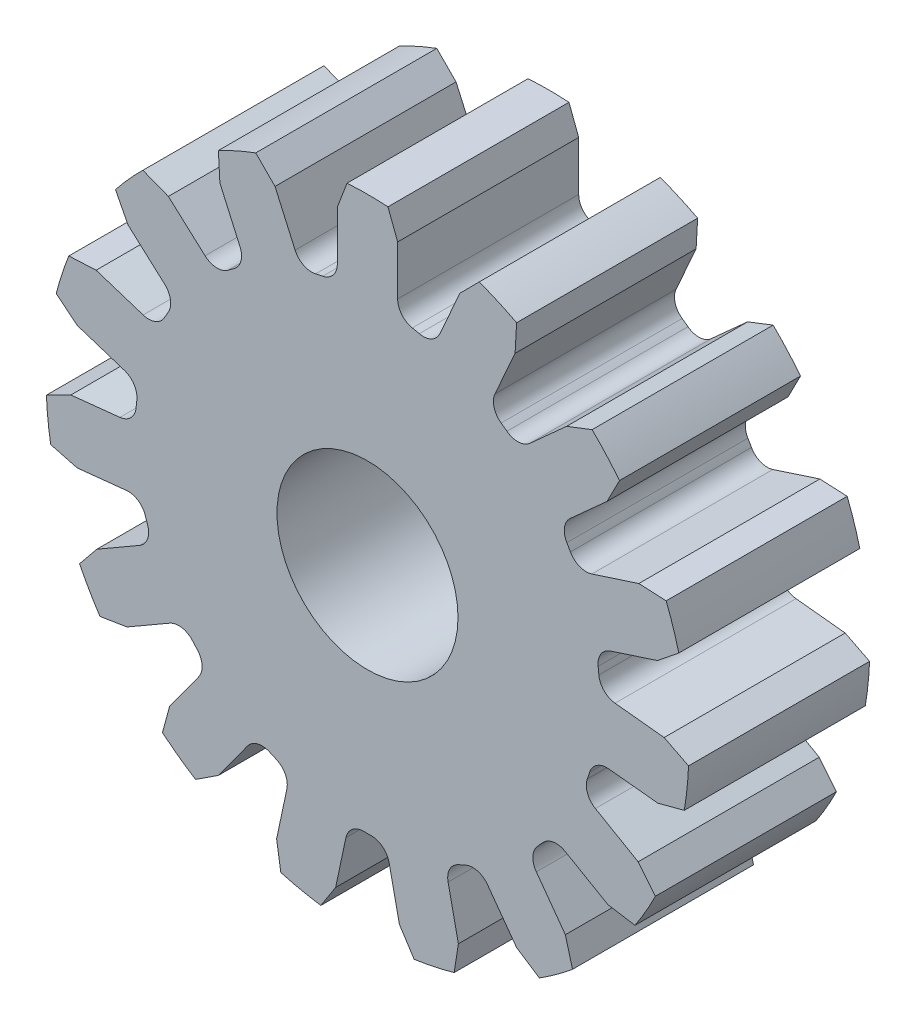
ISO-10303-21;
HEADER;
FILE_DESCRIPTION(('STEP AP214'),'2;1');
FILE_NAME('part.step','',(''),(''),'','','');
FILE_SCHEMA(('AUTOMOTIVE_DESIGN { 1 0 10303 214 1 1 1 1 }'));
ENDSEC;
DATA;
#1=APPLICATION_CONTEXT('core data for automotive mechanical design processes');
#2=APPLICATION_PROTOCOL_DEFINITION('international standard','automotive_design',2000,#1);
#3=PRODUCT_CONTEXT('',#1,'mechanical');
#4=PRODUCT('Part','Part','',(#3));
#5=PRODUCT_RELATED_PRODUCT_CATEGORY('part','',(#4));
#6=PRODUCT_DEFINITION_FORMATION('','',#4);
#7=PRODUCT_DEFINITION_CONTEXT('part definition',#1,'design');
#8=PRODUCT_DEFINITION('design','',#6,#7);
#9=PRODUCT_DEFINITION_SHAPE('','',#8);
#10=(LENGTH_UNIT() NAMED_UNIT(*) SI_UNIT(.MILLI.,.METRE.));
#11=(NAMED_UNIT(*) PLANE_ANGLE_UNIT() SI_UNIT($,.RADIAN.));
#12=(NAMED_UNIT(*) SI_UNIT($,.STERADIAN.) SOLID_ANGLE_UNIT());
#13=UNCERTAINTY_MEASURE_WITH_UNIT(LENGTH_MEASURE(1.E-05),#10,'distance_accuracy_value','');
#14=(GEOMETRIC_REPRESENTATION_CONTEXT(3) GLOBAL_UNCERTAINTY_ASSIGNED_CONTEXT((#13)) GLOBAL_UNIT_ASSIGNED_CONTEXT((#10,
#11,#12)) REPRESENTATION_CONTEXT('',''));
#15=CARTESIAN_POINT('',(0.,0.,0.));
#16=DIRECTION('',(0.,0.,1.));
#17=DIRECTION('',(1.,0.,0.));
#18=AXIS2_PLACEMENT_3D('',#15,#16,#17);
#19=CARTESIAN_POINT('',(0.,0.,3.));
#20=DIRECTION('',(0.,0.,1.));
#21=DIRECTION('',(1.,0.,0.));
#22=AXIS2_PLACEMENT_3D('',#19,#20,#21);
#23=PLANE('',#22);
#24=CARTESIAN_POINT('',(0.,0.,3.));
#25=DIRECTION('',(0.,0.,1.));
#26=DIRECTION('',(1.,0.,0.));
#27=AXIS2_PLACEMENT_3D('',#24,#25,#26);
#28=CIRCLE('',#27,1.5);
#29=CARTESIAN_POINT('',(1.5,0.,3.));
#30=VERTEX_POINT('',#29);
#31=EDGE_CURVE('E1643',#30,#30,#28,.T.);
#32=ORIENTED_EDGE('',*,*,#31,.F.);
#33=EDGE_LOOP('',(#32));
#34=FACE_BOUND('',#33,.T.);
#35=DIRECTION('',(-0.987166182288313,0.159696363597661,0.));
#36=VECTOR('',#35,1.);
#37=CARTESIAN_POINT('',(1.51701353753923,-2.47897262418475,3.));
#38=LINE('',#37,#36);
#39=CARTESIAN_POINT('',(4.43274652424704,-2.95065810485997,3.));
#40=VERTEX_POINT('',#39);
#41=CARTESIAN_POINT('',(3.98532226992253,-2.8782771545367,3.));
#42=VERTEX_POINT('',#41);
#43=EDGE_CURVE('E1031',#40,#42,#38,.T.);
#44=ORIENTED_EDGE('',*,*,#43,.F.);
#45=CARTESIAN_POINT('',(0.,0.,3.));
#46=DIRECTION('',(0.,0.,1.));
#47=DIRECTION('',(1.,0.,0.));
#48=AXIS2_PLACEMENT_3D('',#45,#46,#47);
#49=CIRCLE('',#48,5.325);
#50=CARTESIAN_POINT('',(4.77171813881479,-2.36354204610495,3.));
#51=VERTEX_POINT('',#50);
#52=EDGE_CURVE('E1652',#40,#51,#49,.T.);
#53=ORIENTED_EDGE('',*,*,#52,.T.);
#54=DIRECTION('',(-0.631884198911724,0.775062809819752,0.));
#55=VECTOR('',#54,1.);
#56=CARTESIAN_POINT('',(7.51561487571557,-5.72917821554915,3.));
#57=LINE('',#56,#55);
#58=CARTESIAN_POINT('',(4.48532226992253,-2.01225175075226,3.));
#59=VERTEX_POINT('',#58);
#60=EDGE_CURVE('E1034',#51,#59,#57,.T.);
#61=ORIENTED_EDGE('',*,*,#60,.T.);
#62=DIRECTION('',(-0.866025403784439,0.499999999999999,0.));
#63=VECTOR('',#62,1.);
#64=CARTESIAN_POINT('',(5.38398104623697,-2.53109263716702,3.));
#65=LINE('',#64,#63);
#66=CARTESIAN_POINT('',(3.77659538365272,-1.60306809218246,3.));
#67=VERTEX_POINT('',#66);
#68=EDGE_CURVE('E790',#59,#67,#65,.T.);
#69=ORIENTED_EDGE('',*,*,#68,.T.);
#70=CARTESIAN_POINT('',(3.92659538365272,-1.34326047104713,3.));
#71=DIRECTION('',(0.,0.,1.));
#72=DIRECTION('',(1.,0.,0.));
#73=AXIS2_PLACEMENT_3D('',#70,#71,#72);
#74=CIRCLE('',#73,0.3);
#75=CARTESIAN_POINT('',(3.64274511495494,-1.2461573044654,3.));
#76=VERTEX_POINT('',#75);
#77=EDGE_CURVE('E771',#67,#76,#74,.F.);
#78=ORIENTED_EDGE('',*,*,#77,.T.);
#79=CARTESIAN_POINT('',(0.,0.,3.));
#80=DIRECTION('',(0.,0.,1.));
#81=DIRECTION('',(1.,0.,0.));
#82=AXIS2_PLACEMENT_3D('',#79,#80,#81);
#83=CIRCLE('',#82,3.85000000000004);
#84=CARTESIAN_POINT('',(3.67951558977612,-1.13298941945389,3.));
#85=VERTEX_POINT('',#84);
#86=EDGE_CURVE('E782',#76,#85,#83,.T.);
#87=ORIENTED_EDGE('',*,*,#86,.T.);
#88=CARTESIAN_POINT('',(3.96623109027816,-1.22127430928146,3.));
#89=DIRECTION('',(0.,0.,1.));
#90=DIRECTION('',(1.,0.,0.));
#91=AXIS2_PLACEMENT_3D('',#88,#89,#90);
#92=CIRCLE('',#91,0.3);
#93=CARTESIAN_POINT('',(3.99758962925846,-0.922917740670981,3.));
#94=VERTEX_POINT('',#93);
#95=EDGE_CURVE('E786',#94,#85,#92,.T.);
#96=ORIENTED_EDGE('',*,*,#95,.F.);
#97=DIRECTION('',(-0.994521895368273,0.104528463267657,0.));
#98=VECTOR('',#97,1.);
#99=CARTESIAN_POINT('',(1.18028007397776,-0.626806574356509,3.));
#100=LINE('',#99,#98);
#101=CARTESIAN_POINT('',(4.81147384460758,-1.00846041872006,3.));
#102=VERTEX_POINT('',#101);
#103=EDGE_CURVE('E794',#102,#94,#100,.T.);
#104=ORIENTED_EDGE('',*,*,#103,.F.);
#105=DIRECTION('',(-0.966775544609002,-0.255626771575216,0.));
#106=VECTOR('',#105,1.);
#107=CARTESIAN_POINT('',(-2.36649086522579,-2.90639831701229,3.));
#108=LINE('',#107,#106);
#109=CARTESIAN_POINT('',(5.24965622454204,-0.892599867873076,3.));
#110=VERTEX_POINT('',#109);
#111=EDGE_CURVE('E797',#110,#102,#108,.T.);
#112=ORIENTED_EDGE('',*,*,#111,.F.);
#113=CARTESIAN_POINT('',(5.32052058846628,-0.21837048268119,3.));
#114=VERTEX_POINT('',#113);
#115=EDGE_CURVE('E39',#110,#114,#49,.T.);
#116=ORIENTED_EDGE('',*,*,#115,.T.);
#117=DIRECTION('',(-0.892501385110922,0.45104465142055,0.));
#118=VECTOR('',#117,1.);
#119=CARTESIAN_POINT('',(5.76740371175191,-0.444212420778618,3.));
#120=LINE('',#119,#118);
#121=CARTESIAN_POINT('',(4.91600230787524,-0.0139385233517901,3.));
#122=VERTEX_POINT('',#121);
#123=EDGE_CURVE('E800',#114,#122,#120,.T.);
#124=ORIENTED_EDGE('',*,*,#123,.T.);
#125=DIRECTION('',(-0.994521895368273,0.104528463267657,0.));
#126=VECTOR('',#125,1.);
#127=CARTESIAN_POINT('',(1.28480853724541,0.367715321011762,3.));
#128=LINE('',#127,#126);
#129=CARTESIAN_POINT('',(4.10211809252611,0.0716041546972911,3.));
#130=VERTEX_POINT('',#129);
#131=EDGE_CURVE('E802',#122,#130,#128,.T.);
#132=ORIENTED_EDGE('',*,*,#131,.T.);
#133=CARTESIAN_POINT('',(4.13347663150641,0.369960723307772,3.));
#134=DIRECTION('',(0.,0.,1.));
#135=DIRECTION('',(1.,0.,0.));
#136=AXIS2_PLACEMENT_3D('',#133,#134,#135);
#137=CIRCLE('',#136,0.3);
#138=CARTESIAN_POINT('',(3.83467109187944,0.343216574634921,3.));
#139=VERTEX_POINT('',#138);
#140=EDGE_CURVE('E804',#130,#139,#137,.F.);
#141=ORIENTED_EDGE('',*,*,#140,.T.);
#142=CARTESIAN_POINT('',(0.,0.,3.));
#143=DIRECTION('',(0.,0.,1.));
#144=DIRECTION('',(1.,0.,0.));
#145=AXIS2_PLACEMENT_3D('',#142,#143,#144);
#146=CIRCLE('',#145,3.85);
#147=CARTESIAN_POINT('',(3.82223306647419,0.461556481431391,3.));
#148=VERTEX_POINT('',#147);
#149=EDGE_CURVE('E806',#139,#148,#146,.T.);
#150=ORIENTED_EDGE('',*,*,#149,.T.);
#151=CARTESIAN_POINT('',(4.12006940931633,0.497521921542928,3.));
#152=DIRECTION('',(0.,0.,1.));
#153=DIRECTION('',(1.,0.,0.));
#154=AXIS2_PLACEMENT_3D('',#151,#152,#153);
#155=CIRCLE('',#154,0.3);
#156=CARTESIAN_POINT('',(4.02736431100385,0.782838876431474,3.));
#157=VERTEX_POINT('',#156);
#158=EDGE_CURVE('E808',#157,#148,#155,.T.);
#159=ORIENTED_EDGE('',*,*,#158,.F.);
#160=DIRECTION('',(-0.951056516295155,-0.309016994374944,0.));
#161=VECTOR('',#160,1.);
#162=CARTESIAN_POINT('',(-3.3300063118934,-1.60771575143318,3.));
#163=LINE('',#162,#161);
#164=CARTESIAN_POINT('',(4.80567788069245,1.03572828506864,3.));
#165=VERTEX_POINT('',#164);
#166=EDGE_CURVE('E811',#165,#157,#163,.T.);
#167=ORIENTED_EDGE('',*,*,#166,.F.);
#168=DIRECTION('',(-0.779220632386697,-0.626749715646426,0.));
#169=VECTOR('',#168,1.);
#170=CARTESIAN_POINT('',(-4.40847711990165,-6.37548336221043,3.));
#171=LINE('',#170,#169);
#172=CARTESIAN_POINT('',(5.15885267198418,1.31979699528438,3.));
#173=VERTEX_POINT('',#172);
#174=EDGE_CURVE('E814',#173,#165,#171,.T.);
#175=ORIENTED_EDGE('',*,*,#174,.F.);
#176=CARTESIAN_POINT('',(4.9493566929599,1.96455932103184,3.));
#177=VERTEX_POINT('',#176);
#178=EDGE_CURVE('E11',#173,#177,#49,.T.);
#179=ORIENTED_EDGE('',*,*,#178,.T.);
#180=DIRECTION('',(-0.998796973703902,0.0490367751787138,0.));
#181=VECTOR('',#180,1.);
#182=CARTESIAN_POINT('',(0.688822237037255,2.17373383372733,3.));
#183=LINE('',#182,#181);
#184=CARTESIAN_POINT('',(4.4966608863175,1.98678480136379,3.));
#185=VERTEX_POINT('',#184);
#186=EDGE_CURVE('E817',#177,#185,#183,.T.);
#187=ORIENTED_EDGE('',*,*,#186,.T.);
#188=DIRECTION('',(-0.951056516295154,-0.309016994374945,0.));
#189=VECTOR('',#188,1.);
#190=CARTESIAN_POINT('',(-3.63902330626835,-0.656659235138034,3.));
#191=LINE('',#190,#189);
#192=CARTESIAN_POINT('',(3.7183473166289,1.73389539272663,3.));
#193=VERTEX_POINT('',#192);
#194=EDGE_CURVE('E819',#185,#193,#191,.T.);
#195=ORIENTED_EDGE('',*,*,#194,.T.);
#196=CARTESIAN_POINT('',(3.62564221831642,2.01921234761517,3.));
#197=DIRECTION('',(0.,0.,1.));
#198=DIRECTION('',(1.,0.,0.));
#199=AXIS2_PLACEMENT_3D('',#196,#197,#198);
#200=CIRCLE('',#199,0.3);
#201=CARTESIAN_POINT('',(3.36354760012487,1.87324518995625,3.));
#202=VERTEX_POINT('',#201);
#203=EDGE_CURVE('E821',#193,#202,#200,.F.);
#204=ORIENTED_EDGE('',*,*,#203,.T.);
#205=CARTESIAN_POINT('',(0.,0.,3.));
#206=DIRECTION('',(0.,0.,1.));
#207=DIRECTION('',(1.,0.,0.));
#208=AXIS2_PLACEMENT_3D('',#205,#206,#207);
#209=CIRCLE('',#208,3.85);
#210=CARTESIAN_POINT('',(3.30405172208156,1.97629507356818,3.));
#211=VERTEX_POINT('',#210);
#212=EDGE_CURVE('E823',#202,#211,#209,.T.);
#213=ORIENTED_EDGE('',*,*,#212,.T.);
#214=CARTESIAN_POINT('',(3.56151029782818,2.13029209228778,3.));
#215=DIRECTION('',(0.,0.,1.));
#216=DIRECTION('',(1.,0.,0.));
#217=AXIS2_PLACEMENT_3D('',#214,#215,#216);
#218=CIRCLE('',#217,0.3);
#219=CARTESIAN_POINT('',(3.36077111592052,2.353235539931,3.));
#220=VERTEX_POINT('',#219);
#221=EDGE_CURVE('E825',#220,#211,#218,.T.);
#222=ORIENTED_EDGE('',*,*,#221,.F.);
#223=DIRECTION('',(-0.743144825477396,-0.669130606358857,0.));
#224=VECTOR('',#223,1.);
#225=CARTESIAN_POINT('',(-5.56117001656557,-5.68011633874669,3.));
#226=LINE('',#225,#224);
#227=CARTESIAN_POINT('',(3.96893655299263,2.90083015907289,3.));
#228=VERTEX_POINT('',#227);
#229=EDGE_CURVE('E828',#228,#220,#226,.T.);
#230=ORIENTED_EDGE('',*,*,#229,.F.);
#231=DIRECTION('',(-0.456931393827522,-0.889501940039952,0.));
#232=VECTOR('',#231,1.);
#233=CARTESIAN_POINT('',(-2.85768041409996,-10.3884494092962,3.));
#234=LINE('',#233,#232);
#235=CARTESIAN_POINT('',(4.17603662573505,3.30398896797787,3.));
#236=VERTEX_POINT('',#235);
#237=EDGE_CURVE('E831',#236,#228,#234,.T.);
#238=ORIENTED_EDGE('',*,*,#237,.F.);
#239=CARTESIAN_POINT('',(3.72240406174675,3.80779897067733,3.));
#240=VERTEX_POINT('',#239);
#241=EDGE_CURVE('E38',#236,#240,#49,.T.);
#242=ORIENTED_EDGE('',*,*,#241,.T.);
#243=DIRECTION('',(-0.932391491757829,-0.361450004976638,0.));
#244=VECTOR('',#243,1.);
#245=CARTESIAN_POINT('',(-4.79272686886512,0.5068313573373,3.));
#246=LINE('',#245,#244);
#247=CARTESIAN_POINT('',(3.29980594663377,3.64397498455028,3.));
#248=VERTEX_POINT('',#247);
#249=EDGE_CURVE('E834',#240,#248,#246,.T.);
#250=ORIENTED_EDGE('',*,*,#249,.T.);
#251=DIRECTION('',(-0.743144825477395,-0.669130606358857,0.));
#252=VECTOR('',#251,1.);
#253=CARTESIAN_POINT('',(-6.23030062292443,-4.9369715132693,3.));
#254=LINE('',#253,#252);
#255=CARTESIAN_POINT('',(2.69164050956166,3.0963803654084,3.));
#256=VERTEX_POINT('',#255);
#257=EDGE_CURVE('E836',#248,#256,#254,.T.);
#258=ORIENTED_EDGE('',*,*,#257,.T.);
#259=CARTESIAN_POINT('',(2.490901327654,3.31932381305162,3.));
#260=DIRECTION('',(0.,0.,1.));
#261=DIRECTION('',(1.,0.,0.));
#262=AXIS2_PLACEMENT_3D('',#259,#260,#261);
#263=CIRCLE('',#262,0.3);
#264=CARTESIAN_POINT('',(2.31083617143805,3.07937269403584,3.));
#265=VERTEX_POINT('',#264);
#266=EDGE_CURVE('E838',#256,#265,#263,.F.);
#267=ORIENTED_EDGE('',*,*,#266,.T.);
#268=CARTESIAN_POINT('',(0.,0.,3.));
#269=DIRECTION('',(0.,0.,1.));
#270=DIRECTION('',(1.,0.,0.));
#271=AXIS2_PLACEMENT_3D('',#268,#269,#270);
#272=CIRCLE('',#271,3.85);
#273=CARTESIAN_POINT('',(2.21456981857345,3.14931429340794,3.));
#274=VERTEX_POINT('',#273);
#275=EDGE_CURVE('E840',#265,#274,#272,.T.);
#276=ORIENTED_EDGE('',*,*,#275,.T.);
#277=CARTESIAN_POINT('',(2.38713370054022,3.39471540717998,3.));
#278=DIRECTION('',(0.,0.,1.));
#279=DIRECTION('',(1.,0.,0.));
#280=AXIS2_PLACEMENT_3D('',#277,#278,#279);
#281=CIRCLE('',#280,0.3);
#282=CARTESIAN_POINT('',(2.11307006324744,3.51673640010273,3.));
#283=VERTEX_POINT('',#282);
#284=EDGE_CURVE('E842',#283,#274,#281,.T.);
#285=ORIENTED_EDGE('',*,*,#284,.F.);
#286=DIRECTION('',(-0.406736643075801,-0.913545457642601,0.));
#287=VECTOR('',#286,1.);
#288=CARTESIAN_POINT('',(-3.94874636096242,-10.0983262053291,3.));
#289=LINE('',#288,#287);
#290=CARTESIAN_POINT('',(2.44593003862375,4.26435214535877,3.));
#291=VERTEX_POINT('',#290);
#292=EDGE_CURVE('E845',#291,#283,#289,.T.);
#293=ORIENTED_EDGE('',*,*,#292,.F.);
#294=DIRECTION('',(-0.055634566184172,-0.998451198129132,0.));
#295=VECTOR('',#294,1.);
#296=CARTESIAN_POINT('',(1.54287622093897,-11.942391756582,3.));
#297=LINE('',#296,#295);
#298=CARTESIAN_POINT('',(2.47114590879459,4.71689123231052,3.));
#299=VERTEX_POINT('',#298);
#300=EDGE_CURVE('E848',#299,#291,#297,.T.);
#301=ORIENTED_EDGE('',*,*,#300,.F.);
#302=CARTESIAN_POINT('',(1.85181395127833,4.99263558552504,3.));
#303=VERTEX_POINT('',#302);
#304=EDGE_CURVE('E1717',#299,#303,#49,.T.);
#305=ORIENTED_EDGE('',*,*,#304,.T.);
#306=DIRECTION('',(-0.704767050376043,-0.709438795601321,0.));
#307=VECTOR('',#306,1.);
#308=CARTESIAN_POINT('',(-7.49232033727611,-4.41343890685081,3.));
#309=LINE('',#308,#307);
#310=CARTESIAN_POINT('',(1.53238458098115,4.67108878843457,3.));
#311=VERTEX_POINT('',#310);
#312=EDGE_CURVE('E851',#303,#311,#309,.T.);
#313=ORIENTED_EDGE('',*,*,#312,.T.);
#314=DIRECTION('',(-0.406736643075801,-0.913545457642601,0.));
#315=VECTOR('',#314,1.);
#316=CARTESIAN_POINT('',(-4.86229181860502,-9.69158956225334,3.));
#317=LINE('',#316,#315);
#318=CARTESIAN_POINT('',(1.19952460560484,3.92347304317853,3.));
#319=VERTEX_POINT('',#318);
#320=EDGE_CURVE('E853',#311,#319,#317,.T.);
#321=ORIENTED_EDGE('',*,*,#320,.T.);
#322=CARTESIAN_POINT('',(0.925460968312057,4.04549403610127,3.));
#323=DIRECTION('',(0.,0.,1.));
#324=DIRECTION('',(1.,0.,0.));
#325=AXIS2_PLACEMENT_3D('',#322,#323,#324);
#326=CIRCLE('',#325,0.3);
#327=CARTESIAN_POINT('',(0.858560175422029,3.75304868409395,3.));
#328=VERTEX_POINT('',#327);
#329=EDGE_CURVE('E855',#319,#328,#326,.F.);
#330=ORIENTED_EDGE('',*,*,#329,.T.);
#331=CARTESIAN_POINT('',(0.,0.,3.));
#332=DIRECTION('',(0.,0.,1.));
#333=DIRECTION('',(1.,0.,0.));
#334=AXIS2_PLACEMENT_3D('',#331,#332,#333);
#335=CIRCLE('',#334,3.85);
#336=CARTESIAN_POINT('',(0.742168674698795,3.77778846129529,3.));
#337=VERTEX_POINT('',#336);
#338=EDGE_CURVE('E857',#328,#337,#335,.T.);
#339=ORIENTED_EDGE('',*,*,#338,.T.);
#340=CARTESIAN_POINT('',(0.8,4.07216158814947,3.));
#341=DIRECTION('',(0.,0.,1.));
#342=DIRECTION('',(1.,0.,0.));
#343=AXIS2_PLACEMENT_3D('',#340,#341,#342);
#344=CIRCLE('',#343,0.3);
#345=CARTESIAN_POINT('',(0.5,4.07216158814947,3.));
#346=VERTEX_POINT('',#345);
#347=EDGE_CURVE('E859',#346,#337,#344,.T.);
#348=ORIENTED_EDGE('',*,*,#347,.F.);
#349=DIRECTION('',(0.,-1.,0.));
#350=VECTOR('',#349,1.);
#351=CARTESIAN_POINT('',(0.499999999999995,-11.8564213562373,3.));
#352=LINE('',#351,#350);
#353=CARTESIAN_POINT('',(0.5,4.89052890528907,3.));
#354=VERTEX_POINT('',#353);
#355=EDGE_CURVE('E862',#354,#346,#352,.T.);
#356=ORIENTED_EDGE('',*,*,#355,.F.);
#357=DIRECTION('',(0.355281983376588,-0.934759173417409,0.));
#358=VECTOR('',#357,1.);
#359=CARTESIAN_POINT('',(5.99860133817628,-9.57648119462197,3.));
#360=LINE('',#359,#358);
#361=CARTESIAN_POINT('',(0.338971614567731,5.31420015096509,3.));
#362=VERTEX_POINT('',#361);
#363=EDGE_CURVE('E865',#362,#354,#360,.T.);
#364=ORIENTED_EDGE('',*,*,#363,.F.);
#365=CARTESIAN_POINT('',(-0.33897161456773,5.31420015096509,3.));
#366=VERTEX_POINT('',#365);
#367=EDGE_CURVE('E1718',#362,#366,#49,.T.);
#368=ORIENTED_EDGE('',*,*,#367,.T.);
#369=DIRECTION('',(-0.355281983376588,-0.934759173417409,0.));
#370=VECTOR('',#369,1.);
#371=CARTESIAN_POINT('',(-5.99860133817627,-9.57648119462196,3.));
#372=LINE('',#371,#370);
#373=CARTESIAN_POINT('',(-0.499999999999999,4.89052890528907,3.));
#374=VERTEX_POINT('',#373);
#375=EDGE_CURVE('E868',#366,#374,#372,.T.);
#376=ORIENTED_EDGE('',*,*,#375,.T.);
#377=DIRECTION('',(0.,-1.,0.));
#378=VECTOR('',#377,1.);
#379=CARTESIAN_POINT('',(-0.499999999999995,-11.8564213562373,3.));
#380=LINE('',#379,#378);
#381=CARTESIAN_POINT('',(-0.5,4.07216158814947,3.));
#382=VERTEX_POINT('',#381);
#383=EDGE_CURVE('E870',#374,#382,#380,.T.);
#384=ORIENTED_EDGE('',*,*,#383,.T.);
#385=CARTESIAN_POINT('',(-0.8,4.07216158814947,3.));
#386=DIRECTION('',(0.,0.,1.));
#387=DIRECTION('',(1.,0.,0.));
#388=AXIS2_PLACEMENT_3D('',#385,#386,#387);
#389=CIRCLE('',#388,0.3);
#390=CARTESIAN_POINT('',(-0.742168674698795,3.77778846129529,3.));
#391=VERTEX_POINT('',#390);
#392=EDGE_CURVE('E872',#382,#391,#389,.F.);
#393=ORIENTED_EDGE('',*,*,#392,.T.);
#394=CARTESIAN_POINT('',(0.,0.,3.));
#395=DIRECTION('',(0.,0.,1.));
#396=DIRECTION('',(1.,0.,0.));
#397=AXIS2_PLACEMENT_3D('',#394,#395,#396);
#398=CIRCLE('',#397,3.85);
#399=CARTESIAN_POINT('',(-0.858560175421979,3.75304868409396,3.));
#400=VERTEX_POINT('',#399);
#401=EDGE_CURVE('E874',#391,#400,#398,.T.);
#402=ORIENTED_EDGE('',*,*,#401,.T.);
#403=CARTESIAN_POINT('',(-0.925460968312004,4.04549403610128,3.));
#404=DIRECTION('',(0.,0.,1.));
#405=DIRECTION('',(1.,0.,0.));
#406=AXIS2_PLACEMENT_3D('',#403,#404,#405);
#407=CIRCLE('',#406,0.3);
#408=CARTESIAN_POINT('',(-1.19952460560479,3.92347304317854,3.));
#409=VERTEX_POINT('',#408);
#410=EDGE_CURVE('E876',#409,#400,#407,.T.);
#411=ORIENTED_EDGE('',*,*,#410,.F.);
#412=DIRECTION('',(0.406736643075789,-0.913545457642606,0.));
#413=VECTOR('',#412,1.);
#414=CARTESIAN_POINT('',(4.86229181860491,-9.69158956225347,3.));
#415=LINE('',#414,#413);
#416=CARTESIAN_POINT('',(-1.53238458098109,4.67108878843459,3.));
#417=VERTEX_POINT('',#416);
#418=EDGE_CURVE('E879',#417,#409,#415,.T.);
#419=ORIENTED_EDGE('',*,*,#418,.F.);
#420=DIRECTION('',(0.704767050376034,-0.709438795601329,0.));
#421=VECTOR('',#420,1.);
#422=CARTESIAN_POINT('',(7.49232033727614,-4.41343890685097,3.));
#423=LINE('',#422,#421);
#424=CARTESIAN_POINT('',(-1.85181395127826,4.99263558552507,3.));
#425=VERTEX_POINT('',#424);
#426=EDGE_CURVE('E882',#425,#417,#423,.T.);
#427=ORIENTED_EDGE('',*,*,#426,.F.);
#428=CARTESIAN_POINT('',(-2.47114590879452,4.71689123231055,3.));
#429=VERTEX_POINT('',#428);
#430=EDGE_CURVE('E1721',#425,#429,#49,.T.);
#431=ORIENTED_EDGE('',*,*,#430,.T.);
#432=DIRECTION('',(0.0556345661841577,-0.998451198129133,0.));
#433=VECTOR('',#432,1.);
#434=CARTESIAN_POINT('',(-1.54287622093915,-11.942391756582,3.));
#435=LINE('',#434,#433);
#436=CARTESIAN_POINT('',(-2.44593003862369,4.2643521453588,3.));
#437=VERTEX_POINT('',#436);
#438=EDGE_CURVE('E885',#429,#437,#435,.T.);
#439=ORIENTED_EDGE('',*,*,#438,.T.);
#440=DIRECTION('',(0.406736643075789,-0.913545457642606,0.));
#441=VECTOR('',#440,1.);
#442=CARTESIAN_POINT('',(3.94874636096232,-10.0983262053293,3.));
#443=LINE('',#442,#441);
#444=CARTESIAN_POINT('',(-2.11307006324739,3.51673640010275,3.));
#445=VERTEX_POINT('',#444);
#446=EDGE_CURVE('E887',#437,#445,#443,.T.);
#447=ORIENTED_EDGE('',*,*,#446,.T.);
#448=CARTESIAN_POINT('',(-2.38713370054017,3.39471540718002,3.));
#449=DIRECTION('',(0.,0.,1.));
#450=DIRECTION('',(1.,0.,0.));
#451=AXIS2_PLACEMENT_3D('',#448,#449,#450);
#452=CIRCLE('',#451,0.3);
#453=CARTESIAN_POINT('',(-2.21456981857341,3.14931429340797,3.));
#454=VERTEX_POINT('',#453);
#455=EDGE_CURVE('E889',#445,#454,#452,.F.);
#456=ORIENTED_EDGE('',*,*,#455,.T.);
#457=CARTESIAN_POINT('',(0.,0.,3.));
#458=DIRECTION('',(0.,0.,1.));
#459=DIRECTION('',(1.,0.,0.));
#460=AXIS2_PLACEMENT_3D('',#457,#458,#459);
#461=CIRCLE('',#460,3.85);
#462=CARTESIAN_POINT('',(-2.31083617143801,3.07937269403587,3.));
#463=VERTEX_POINT('',#462);
#464=EDGE_CURVE('E891',#454,#463,#461,.T.);
#465=ORIENTED_EDGE('',*,*,#464,.T.);
#466=CARTESIAN_POINT('',(-2.49090132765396,3.31932381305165,3.));
#467=DIRECTION('',(0.,0.,1.));
#468=DIRECTION('',(1.,0.,0.));
#469=AXIS2_PLACEMENT_3D('',#466,#467,#468);
#470=CIRCLE('',#469,0.3);
#471=CARTESIAN_POINT('',(-2.69164050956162,3.09638036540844,3.));
#472=VERTEX_POINT('',#471);
#473=EDGE_CURVE('E893',#472,#463,#470,.T.);
#474=ORIENTED_EDGE('',*,*,#473,.F.);
#475=DIRECTION('',(0.743144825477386,-0.669130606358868,0.));
#476=VECTOR('',#475,1.);
#477=CARTESIAN_POINT('',(6.23030062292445,-4.93697151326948,3.));
#478=LINE('',#477,#476);
#479=CARTESIAN_POINT('',(-3.29980594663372,3.64397498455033,3.));
#480=VERTEX_POINT('',#479);
#481=EDGE_CURVE('E896',#480,#472,#478,.T.);
#482=ORIENTED_EDGE('',*,*,#481,.F.);
#483=DIRECTION('',(0.932391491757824,-0.36145000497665,0.));
#484=VECTOR('',#483,1.);
#485=CARTESIAN_POINT('',(4.79272686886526,0.50683135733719,3.));
#486=LINE('',#485,#484);
#487=CARTESIAN_POINT('',(-3.7224040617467,3.80779897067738,3.));
#488=VERTEX_POINT('',#487);
#489=EDGE_CURVE('E899',#488,#480,#486,.T.);
#490=ORIENTED_EDGE('',*,*,#489,.F.);
#491=CARTESIAN_POINT('',(-4.176036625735,3.30398896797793,3.));
#492=VERTEX_POINT('',#491);
#493=EDGE_CURVE('E1725',#488,#492,#49,.T.);
#494=ORIENTED_EDGE('',*,*,#493,.T.);
#495=DIRECTION('',(0.456931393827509,-0.889501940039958,0.));
#496=VECTOR('',#495,1.);
#497=CARTESIAN_POINT('',(2.85768041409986,-10.3884494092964,3.));
#498=LINE('',#497,#496);
#499=CARTESIAN_POINT('',(-3.96893655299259,2.90083015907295,3.));
#500=VERTEX_POINT('',#499);
#501=EDGE_CURVE('E902',#492,#500,#498,.T.);
#502=ORIENTED_EDGE('',*,*,#501,.T.);
#503=DIRECTION('',(0.743144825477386,-0.669130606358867,0.));
#504=VECTOR('',#503,1.);
#505=CARTESIAN_POINT('',(5.56117001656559,-5.68011633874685,3.));
#506=LINE('',#505,#504);
#507=CARTESIAN_POINT('',(-3.36077111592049,2.35323553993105,3.));
#508=VERTEX_POINT('',#507);
#509=EDGE_CURVE('E904',#500,#508,#506,.T.);
#510=ORIENTED_EDGE('',*,*,#509,.T.);
#511=CARTESIAN_POINT('',(-3.56151029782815,2.13029209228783,3.));
#512=DIRECTION('',(0.,0.,1.));
#513=DIRECTION('',(1.,0.,0.));
#514=AXIS2_PLACEMENT_3D('',#511,#512,#513);
#515=CIRCLE('',#514,0.3);
#516=CARTESIAN_POINT('',(-3.30405172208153,1.97629507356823,3.));
#517=VERTEX_POINT('',#516);
#518=EDGE_CURVE('E906',#508,#517,#515,.F.);
#519=ORIENTED_EDGE('',*,*,#518,.T.);
#520=CARTESIAN_POINT('',(0.,0.,3.));
#521=DIRECTION('',(0.,0.,1.));
#522=DIRECTION('',(1.,0.,0.));
#523=AXIS2_PLACEMENT_3D('',#520,#521,#522);
#524=CIRCLE('',#523,3.85);
#525=CARTESIAN_POINT('',(-3.36354760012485,1.87324518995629,3.));
#526=VERTEX_POINT('',#525);
#527=EDGE_CURVE('E908',#517,#526,#524,.T.);
#528=ORIENTED_EDGE('',*,*,#527,.T.);
#529=CARTESIAN_POINT('',(-3.62564221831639,2.01921234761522,3.));
#530=DIRECTION('',(0.,0.,1.));
#531=DIRECTION('',(1.,0.,0.));
#532=AXIS2_PLACEMENT_3D('',#529,#530,#531);
#533=CIRCLE('',#532,0.3);
#534=CARTESIAN_POINT('',(-3.71834731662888,1.73389539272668,3.));
#535=VERTEX_POINT('',#534);
#536=EDGE_CURVE('E910',#535,#526,#533,.T.);
#537=ORIENTED_EDGE('',*,*,#536,.F.);
#538=DIRECTION('',(0.95105651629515,-0.309016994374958,0.));
#539=VECTOR('',#538,1.);
#540=CARTESIAN_POINT('',(3.63902330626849,-0.656659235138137,3.));
#541=LINE('',#540,#539);
#542=CARTESIAN_POINT('',(-4.49666088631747,1.98678480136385,3.));
#543=VERTEX_POINT('',#542);
#544=EDGE_CURVE('E913',#543,#535,#541,.T.);
#545=ORIENTED_EDGE('',*,*,#544,.F.);
#546=DIRECTION('',(0.998796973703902,0.0490367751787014,0.));
#547=VECTOR('',#546,1.);
#548=CARTESIAN_POINT('',(-0.688822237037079,2.17373383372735,3.));
#549=LINE('',#548,#547);
#550=CARTESIAN_POINT('',(-4.94935669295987,1.96455932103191,3.));
#551=VERTEX_POINT('',#550);
#552=EDGE_CURVE('E916',#551,#543,#549,.T.);
#553=ORIENTED_EDGE('',*,*,#552,.F.);
#554=CARTESIAN_POINT('',(-5.15885267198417,1.31979699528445,3.));
#555=VERTEX_POINT('',#554);
#556=EDGE_CURVE('E1729',#551,#555,#49,.T.);
#557=ORIENTED_EDGE('',*,*,#556,.T.);
#558=DIRECTION('',(0.779220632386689,-0.626749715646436,0.));
#559=VECTOR('',#558,1.);
#560=CARTESIAN_POINT('',(4.40847711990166,-6.37548336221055,3.));
#561=LINE('',#560,#559);
#562=CARTESIAN_POINT('',(-4.80567788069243,1.0357282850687,3.));
#563=VERTEX_POINT('',#562);
#564=EDGE_CURVE('E919',#555,#563,#561,.T.);
#565=ORIENTED_EDGE('',*,*,#564,.T.);
#566=DIRECTION('',(0.951056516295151,-0.309016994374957,0.));
#567=VECTOR('',#566,1.);
#568=CARTESIAN_POINT('',(3.33000631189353,-1.60771575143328,3.));
#569=LINE('',#568,#567);
#570=CARTESIAN_POINT('',(-4.02736431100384,0.782838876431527,3.));
#571=VERTEX_POINT('',#570);
#572=EDGE_CURVE('E921',#563,#571,#569,.T.);
#573=ORIENTED_EDGE('',*,*,#572,.T.);
#574=CARTESIAN_POINT('',(-4.12006940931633,0.497521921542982,3.));
#575=DIRECTION('',(0.,0.,1.));
#576=DIRECTION('',(1.,0.,0.));
#577=AXIS2_PLACEMENT_3D('',#574,#575,#576);
#578=CIRCLE('',#577,0.3);
#579=CARTESIAN_POINT('',(-3.82223306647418,0.461556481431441,3.));
#580=VERTEX_POINT('',#579);
#581=EDGE_CURVE('E923',#571,#580,#578,.F.);
#582=ORIENTED_EDGE('',*,*,#581,.T.);
#583=CARTESIAN_POINT('',(0.,0.,3.));
#584=DIRECTION('',(0.,0.,1.));
#585=DIRECTION('',(1.,0.,0.));
#586=AXIS2_PLACEMENT_3D('',#583,#584,#585);
#587=CIRCLE('',#586,3.85);
#588=CARTESIAN_POINT('',(-3.83467109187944,0.343216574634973,3.));
#589=VERTEX_POINT('',#588);
#590=EDGE_CURVE('E925',#580,#589,#587,.T.);
#591=ORIENTED_EDGE('',*,*,#590,.T.);
#592=CARTESIAN_POINT('',(-4.13347663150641,0.369960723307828,3.));
#593=DIRECTION('',(0.,0.,1.));
#594=DIRECTION('',(1.,0.,0.));
#595=AXIS2_PLACEMENT_3D('',#592,#593,#594);
#596=CIRCLE('',#595,0.3);
#597=CARTESIAN_POINT('',(-4.10211809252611,0.0716041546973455,3.));
#598=VERTEX_POINT('',#597);
#599=EDGE_CURVE('E927',#598,#589,#596,.T.);
#600=ORIENTED_EDGE('',*,*,#599,.F.);
#601=DIRECTION('',(0.994521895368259,0.10452846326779,0.));
#602=VECTOR('',#601,1.);
#603=CARTESIAN_POINT('',(-1.2848085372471,0.36771532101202,3.));
#604=LINE('',#603,#602);
#605=CARTESIAN_POINT('',(-4.91600230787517,-0.0139385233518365,3.));
#606=VERTEX_POINT('',#605);
#607=EDGE_CURVE('E930',#606,#598,#604,.T.);
#608=ORIENTED_EDGE('',*,*,#607,.F.);
#609=DIRECTION('',(0.892501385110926,0.451044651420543,0.));
#610=VECTOR('',#609,1.);
#611=CARTESIAN_POINT('',(-5.7674037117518,-0.44421242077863,3.));
#612=LINE('',#611,#610);
#613=CARTESIAN_POINT('',(-5.32052058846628,-0.218370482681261,3.));
#614=VERTEX_POINT('',#613);
#615=EDGE_CURVE('E933',#614,#606,#612,.T.);
#616=ORIENTED_EDGE('',*,*,#615,.F.);
#617=CARTESIAN_POINT('',(-5.24965622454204,-0.892599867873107,3.));
#618=VERTEX_POINT('',#617);
#619=EDGE_CURVE('E1733',#614,#618,#49,.T.);
#620=ORIENTED_EDGE('',*,*,#619,.T.);
#621=DIRECTION('',(0.966775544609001,-0.255626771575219,0.));
#622=VECTOR('',#621,1.);
#623=CARTESIAN_POINT('',(2.36649086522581,-2.90639831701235,3.));
#624=LINE('',#623,#622);
#625=CARTESIAN_POINT('',(-4.81147384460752,-1.00846041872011,3.));
#626=VERTEX_POINT('',#625);
#627=EDGE_CURVE('E936',#618,#626,#624,.T.);
#628=ORIENTED_EDGE('',*,*,#627,.T.);
#629=DIRECTION('',(0.994521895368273,0.104528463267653,0.));
#630=VECTOR('',#629,1.);
#631=CARTESIAN_POINT('',(-1.1802800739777,-0.626806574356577,3.));
#632=LINE('',#631,#630);
#633=CARTESIAN_POINT('',(-3.99758962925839,-0.922917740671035,3.));
#634=VERTEX_POINT('',#633);
#635=EDGE_CURVE('E938',#626,#634,#632,.T.);
#636=ORIENTED_EDGE('',*,*,#635,.T.);
#637=CARTESIAN_POINT('',(-3.9662310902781,-1.22127430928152,3.));
#638=DIRECTION('',(0.,0.,1.));
#639=DIRECTION('',(1.,0.,0.));
#640=AXIS2_PLACEMENT_3D('',#637,#638,#639);
#641=CIRCLE('',#640,0.3);
#642=CARTESIAN_POINT('',(-3.67951558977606,-1.13298941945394,3.));
#643=VERTEX_POINT('',#642);
#644=EDGE_CURVE('E940',#634,#643,#641,.F.);
#645=ORIENTED_EDGE('',*,*,#644,.T.);
#646=CARTESIAN_POINT('',(0.,0.,3.));
#647=DIRECTION('',(0.,0.,1.));
#648=DIRECTION('',(1.,0.,0.));
#649=AXIS2_PLACEMENT_3D('',#646,#647,#648);
#650=CIRCLE('',#649,3.84999999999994);
#651=CARTESIAN_POINT('',(-3.64274511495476,-1.24615730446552,3.));
#652=VERTEX_POINT('',#651);
#653=EDGE_CURVE('E942',#643,#652,#650,.T.);
#654=ORIENTED_EDGE('',*,*,#653,.T.);
#655=CARTESIAN_POINT('',(-3.92659538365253,-1.34326047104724,3.));
#656=DIRECTION('',(0.,0.,1.));
#657=DIRECTION('',(1.,0.,0.));
#658=AXIS2_PLACEMENT_3D('',#655,#656,#657);
#659=CIRCLE('',#658,0.3);
#660=CARTESIAN_POINT('',(-3.77659538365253,-1.60306809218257,3.));
#661=VERTEX_POINT('',#660);
#662=EDGE_CURVE('E944',#661,#652,#659,.T.);
#663=ORIENTED_EDGE('',*,*,#662,.F.);
#664=DIRECTION('',(0.866025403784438,0.500000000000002,0.));
#665=VECTOR('',#664,1.);
#666=CARTESIAN_POINT('',(-5.3839810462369,-2.5310926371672,3.));
#667=LINE('',#666,#665);
#668=CARTESIAN_POINT('',(-4.48532226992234,-2.01225175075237,3.));
#669=VERTEX_POINT('',#668);
#670=EDGE_CURVE('E947',#669,#661,#667,.T.);
#671=ORIENTED_EDGE('',*,*,#670,.F.);
#672=DIRECTION('',(0.63188419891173,0.775062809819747,0.));
#673=VECTOR('',#672,1.);
#674=CARTESIAN_POINT('',(-7.51561487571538,-5.72917821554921,3.));
#675=LINE('',#674,#673);
#676=CARTESIAN_POINT('',(-4.77171813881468,-2.36354204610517,3.));
#677=VERTEX_POINT('',#676);
#678=EDGE_CURVE('E950',#677,#669,#675,.T.);
#679=ORIENTED_EDGE('',*,*,#678,.F.);
#680=CARTESIAN_POINT('',(-4.43274652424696,-2.9506581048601,3.));
#681=VERTEX_POINT('',#680);
#682=EDGE_CURVE('E1737',#677,#681,#49,.T.);
#683=ORIENTED_EDGE('',*,*,#682,.T.);
#684=DIRECTION('',(0.987166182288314,0.159696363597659,0.));
#685=VECTOR('',#684,1.);
#686=CARTESIAN_POINT('',(-1.51701353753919,-2.47897262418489,3.));
#687=LINE('',#686,#685);
#688=CARTESIAN_POINT('',(-3.98532226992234,-2.87827715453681,3.));
#689=VERTEX_POINT('',#688);
#690=EDGE_CURVE('E953',#681,#689,#687,.T.);
#691=ORIENTED_EDGE('',*,*,#690,.T.);
#692=DIRECTION('',(0.866025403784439,0.499999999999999,0.));
#693=VECTOR('',#692,1.);
#694=CARTESIAN_POINT('',(-4.88398104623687,-3.39711804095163,3.));
#695=LINE('',#694,#693);
#696=CARTESIAN_POINT('',(-3.27659538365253,-2.46909349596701,3.));
#697=VERTEX_POINT('',#696);
#698=EDGE_CURVE('E955',#689,#697,#695,.T.);
#699=ORIENTED_EDGE('',*,*,#698,.T.);
#700=CARTESIAN_POINT('',(-3.12659538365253,-2.72890111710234,3.));
#701=DIRECTION('',(0.,0.,1.));
#702=DIRECTION('',(1.,0.,0.));
#703=AXIS2_PLACEMENT_3D('',#700,#701,#702);
#704=CIRCLE('',#703,0.3);
#705=CARTESIAN_POINT('',(-2.90057644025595,-2.53163115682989,3.));
#706=VERTEX_POINT('',#705);
#707=EDGE_CURVE('E957',#697,#706,#704,.F.);
#708=ORIENTED_EDGE('',*,*,#707,.T.);
#709=CARTESIAN_POINT('',(0.,0.,3.));
#710=DIRECTION('',(0.,0.,1.));
#711=DIRECTION('',(1.,0.,0.));
#712=AXIS2_PLACEMENT_3D('',#709,#710,#711);
#713=CIRCLE('',#712,3.84999999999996);
#714=CARTESIAN_POINT('',(-2.820955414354,-2.62005926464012,3.));
#715=VERTEX_POINT('',#714);
#716=EDGE_CURVE('E959',#706,#715,#713,.T.);
#717=ORIENTED_EDGE('',*,*,#716,.T.);
#718=CARTESIAN_POINT('',(-3.040770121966,-2.82421972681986,3.));
#719=DIRECTION('',(0.,0.,1.));
#720=DIRECTION('',(1.,0.,0.));
#721=AXIS2_PLACEMENT_3D('',#718,#719,#720);
#722=CIRCLE('',#721,0.3);
#723=CARTESIAN_POINT('',(-2.79806502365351,-3.0005553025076,3.));
#724=VERTEX_POINT('',#723);
#725=EDGE_CURVE('E961',#724,#715,#722,.T.);
#726=ORIENTED_EDGE('',*,*,#725,.F.);
#727=DIRECTION('',(0.587785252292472,0.809016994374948,0.));
#728=VECTOR('',#727,1.);
#729=CARTESIAN_POINT('',(-6.04257189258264,-7.46623589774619,3.));
#730=LINE('',#729,#728);
#731=CARTESIAN_POINT('',(-3.27908926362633,-3.66262836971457,3.));
#732=VERTEX_POINT('',#731);
#733=EDGE_CURVE('E964',#732,#724,#730,.T.);
#734=ORIENTED_EDGE('',*,*,#733,.F.);
#735=DIRECTION('',(0.262008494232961,0.96506556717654,0.));
#736=VECTOR('',#735,1.);
#737=CARTESIAN_POINT('',(-5.12582947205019,-10.4647948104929,3.));
#738=LINE('',#737,#736);
#739=CARTESIAN_POINT('',(-3.39784227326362,-4.10003571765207,3.));
#740=VERTEX_POINT('',#739);
#741=EDGE_CURVE('E967',#740,#732,#738,.T.);
#742=ORIENTED_EDGE('',*,*,#741,.F.);
#743=CARTESIAN_POINT('',(-2.84937467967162,-4.49852074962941,3.));
#744=VERTEX_POINT('',#743);
#745=EDGE_CURVE('E1741',#740,#744,#49,.T.);
#746=ORIENTED_EDGE('',*,*,#745,.T.);
#747=DIRECTION('',(0.836866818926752,0.547406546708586,0.));
#748=VECTOR('',#747,1.);
#749=CARTESIAN_POINT('',(-4.22452749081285,-5.39802785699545,3.));
#750=LINE('',#749,#748);
#751=CARTESIAN_POINT('',(-2.47007226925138,-4.25041362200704,3.));
#752=VERTEX_POINT('',#751);
#753=EDGE_CURVE('E970',#744,#752,#750,.T.);
#754=ORIENTED_EDGE('',*,*,#753,.T.);
#755=DIRECTION('',(0.587785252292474,0.809016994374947,0.));
#756=VECTOR('',#755,1.);
#757=CARTESIAN_POINT('',(-5.23355489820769,-8.05402115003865,3.));
#758=LINE('',#757,#756);
#759=CARTESIAN_POINT('',(-1.98904802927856,-3.58834055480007,3.));
#760=VERTEX_POINT('',#759);
#761=EDGE_CURVE('E972',#752,#760,#758,.T.);
#762=ORIENTED_EDGE('',*,*,#761,.T.);
#763=CARTESIAN_POINT('',(-1.74634293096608,-3.76467613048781,3.));
#764=DIRECTION('',(0.,0.,1.));
#765=DIRECTION('',(1.,0.,0.));
#766=AXIS2_PLACEMENT_3D('',#763,#764,#765);
#767=CIRCLE('',#766,0.3);
#768=CARTESIAN_POINT('',(-1.62010127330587,-3.49253086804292,3.));
#769=VERTEX_POINT('',#768);
#770=EDGE_CURVE('E974',#760,#769,#767,.F.);
#771=ORIENTED_EDGE('',*,*,#770,.T.);
#772=CARTESIAN_POINT('',(0.,0.,3.));
#773=DIRECTION('',(0.,0.,1.));
#774=DIRECTION('',(1.,0.,0.));
#775=AXIS2_PLACEMENT_3D('',#772,#773,#774);
#776=CIRCLE('',#775,3.84999999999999);
#777=CARTESIAN_POINT('',(-1.51139689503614,-3.54092917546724,3.));
#778=VERTEX_POINT('',#777);
#779=EDGE_CURVE('E976',#769,#778,#776,.T.);
#780=ORIENTED_EDGE('',*,*,#779,.T.);
#781=CARTESIAN_POINT('',(-1.62916808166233,-3.81684573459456,3.));
#782=DIRECTION('',(0.,0.,1.));
#783=DIRECTION('',(1.,0.,0.));
#784=AXIS2_PLACEMENT_3D('',#781,#782,#783);
#785=CIRCLE('',#784,0.300000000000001);
#786=CARTESIAN_POINT('',(-1.33572380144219,-3.87921924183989,3.));
#787=VERTEX_POINT('',#786);
#788=EDGE_CURVE('E978',#787,#778,#785,.T.);
#789=ORIENTED_EDGE('',*,*,#788,.F.);
#790=DIRECTION('',(0.207911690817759,0.978147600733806,0.));
#791=VECTOR('',#790,1.);
#792=CARTESIAN_POINT('',(-2.90029431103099,-11.2399447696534,3.));
#793=LINE('',#792,#791);
#794=CARTESIAN_POINT('',(-1.50587193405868,-4.67970326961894,3.));
#795=VERTEX_POINT('',#794);
#796=EDGE_CURVE('E981',#795,#787,#793,.T.);
#797=ORIENTED_EDGE('',*,*,#796,.F.);
#798=DIRECTION('',(-0.153170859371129,0.988199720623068,0.));
#799=VECTOR('',#798,1.);
#800=CARTESIAN_POINT('',(-0.384249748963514,-11.9159800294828,3.));
#801=LINE('',#800,#799);
#802=CARTESIAN_POINT('',(-1.43644861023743,-5.12759596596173,3.));
#803=VERTEX_POINT('',#802);
#804=EDGE_CURVE('E984',#803,#795,#801,.T.);
#805=ORIENTED_EDGE('',*,*,#804,.F.);
#806=CARTESIAN_POINT('',(-0.773320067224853,-5.26854828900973,3.));
#807=VERTEX_POINT('',#806);
#808=EDGE_CURVE('E1745',#803,#807,#49,.T.);
#809=ORIENTED_EDGE('',*,*,#808,.T.);
#810=DIRECTION('',(0.541865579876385,0.840465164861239,0.));
#811=VECTOR('',#810,1.);
#812=CARTESIAN_POINT('',(-3.54650265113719,-9.56991645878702,3.));
#813=LINE('',#812,#811);
#814=CARTESIAN_POINT('',(-0.527724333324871,-4.88761496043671,3.));
#815=VERTEX_POINT('',#814);
#816=EDGE_CURVE('E987',#807,#815,#813,.T.);
#817=ORIENTED_EDGE('',*,*,#816,.T.);
#818=DIRECTION('',(0.207911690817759,0.978147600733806,0.));
#819=VECTOR('',#818,1.);
#820=CARTESIAN_POINT('',(-1.92214671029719,-11.4478564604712,3.));
#821=LINE('',#820,#819);
#822=CARTESIAN_POINT('',(-0.357576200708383,-4.08713093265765,3.));
#823=VERTEX_POINT('',#822);
#824=EDGE_CURVE('E989',#815,#823,#821,.T.);
#825=ORIENTED_EDGE('',*,*,#824,.T.);
#826=CARTESIAN_POINT('',(-0.0641319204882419,-4.14950443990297,3.));
#827=DIRECTION('',(0.,0.,1.));
#828=DIRECTION('',(1.,0.,0.));
#829=AXIS2_PLACEMENT_3D('',#826,#827,#828);
#830=CIRCLE('',#829,0.3);
#831=CARTESIAN_POINT('',(-0.0594958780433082,-3.84954026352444,3.));
#832=VERTEX_POINT('',#831);
#833=EDGE_CURVE('E991',#823,#832,#830,.F.);
#834=ORIENTED_EDGE('',*,*,#833,.T.);
#835=CARTESIAN_POINT('',(0.,0.,3.));
#836=DIRECTION('',(0.,0.,1.));
#837=DIRECTION('',(1.,0.,0.));
#838=AXIS2_PLACEMENT_3D('',#835,#836,#837);
#839=CIRCLE('',#838,3.85);
#840=CARTESIAN_POINT('',(0.0594958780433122,-3.84954026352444,3.));
#841=VERTEX_POINT('',#840);
#842=EDGE_CURVE('E993',#832,#841,#839,.T.);
#843=ORIENTED_EDGE('',*,*,#842,.T.);
#844=CARTESIAN_POINT('',(0.0641319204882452,-4.14950443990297,3.));
#845=DIRECTION('',(0.,0.,1.));
#846=DIRECTION('',(1.,0.,0.));
#847=AXIS2_PLACEMENT_3D('',#844,#845,#846);
#848=CIRCLE('',#847,0.300000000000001);
#849=CARTESIAN_POINT('',(0.357576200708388,-4.08713093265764,3.));
#850=VERTEX_POINT('',#849);
#851=EDGE_CURVE('E995',#850,#841,#848,.T.);
#852=ORIENTED_EDGE('',*,*,#851,.F.);
#853=DIRECTION('',(-0.20791169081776,0.978147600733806,0.));
#854=VECTOR('',#853,1.);
#855=CARTESIAN_POINT('',(1.9221467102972,-11.4478564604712,3.));
#856=LINE('',#855,#854);
#857=CARTESIAN_POINT('',(0.527724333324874,-4.8876149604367,3.));
#858=VERTEX_POINT('',#857);
#859=EDGE_CURVE('E998',#858,#850,#856,.T.);
#860=ORIENTED_EDGE('',*,*,#859,.F.);
#861=DIRECTION('',(-0.541865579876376,0.840465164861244,0.));
#862=VECTOR('',#861,1.);
#863=CARTESIAN_POINT('',(3.54650265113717,-9.56991645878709,3.));
#864=LINE('',#863,#862);
#865=CARTESIAN_POINT('',(0.773320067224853,-5.26854828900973,3.));
#866=VERTEX_POINT('',#865);
#867=EDGE_CURVE('E1001',#866,#858,#864,.T.);
#868=ORIENTED_EDGE('',*,*,#867,.F.);
#869=CARTESIAN_POINT('',(1.43644861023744,-5.12759596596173,3.));
#870=VERTEX_POINT('',#869);
#871=EDGE_CURVE('E1749',#866,#870,#49,.T.);
#872=ORIENTED_EDGE('',*,*,#871,.T.);
#873=DIRECTION('',(0.153170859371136,0.988199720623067,0.));
#874=VECTOR('',#873,1.);
#875=CARTESIAN_POINT('',(0.384249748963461,-11.9159800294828,3.));
#876=LINE('',#875,#874);
#877=CARTESIAN_POINT('',(1.50587193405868,-4.67970326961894,3.));
#878=VERTEX_POINT('',#877);
#879=EDGE_CURVE('E1004',#870,#878,#876,.T.);
#880=ORIENTED_EDGE('',*,*,#879,.T.);
#881=DIRECTION('',(-0.207911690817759,0.978147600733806,0.));
#882=VECTOR('',#881,1.);
#883=CARTESIAN_POINT('',(2.900294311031,-11.2399447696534,3.));
#884=LINE('',#883,#882);
#885=CARTESIAN_POINT('',(1.33572380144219,-3.87921924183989,3.));
#886=VERTEX_POINT('',#885);
#887=EDGE_CURVE('E1006',#878,#886,#884,.T.);
#888=ORIENTED_EDGE('',*,*,#887,.T.);
#889=CARTESIAN_POINT('',(1.62916808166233,-3.81684573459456,3.));
#890=DIRECTION('',(0.,0.,1.));
#891=DIRECTION('',(1.,0.,0.));
#892=AXIS2_PLACEMENT_3D('',#889,#890,#891);
#893=CIRCLE('',#892,0.3);
#894=CARTESIAN_POINT('',(1.51139689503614,-3.54092917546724,3.));
#895=VERTEX_POINT('',#894);
#896=EDGE_CURVE('E1008',#886,#895,#893,.F.);
#897=ORIENTED_EDGE('',*,*,#896,.T.);
#898=CARTESIAN_POINT('',(0.,0.,3.));
#899=DIRECTION('',(0.,0.,1.));
#900=DIRECTION('',(1.,0.,0.));
#901=AXIS2_PLACEMENT_3D('',#898,#899,#900);
#902=CIRCLE('',#901,3.85000000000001);
#903=CARTESIAN_POINT('',(1.6201012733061,-3.49253086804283,3.));
#904=VERTEX_POINT('',#903);
#905=EDGE_CURVE('E1010',#895,#904,#902,.T.);
#906=ORIENTED_EDGE('',*,*,#905,.T.);
#907=CARTESIAN_POINT('',(1.74634293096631,-3.76467613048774,3.));
#908=DIRECTION('',(0.,0.,1.));
#909=DIRECTION('',(1.,0.,0.));
#910=AXIS2_PLACEMENT_3D('',#907,#908,#909);
#911=CIRCLE('',#910,0.3);
#912=CARTESIAN_POINT('',(1.9890480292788,-3.5883405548,3.));
#913=VERTEX_POINT('',#912);
#914=EDGE_CURVE('E1012',#913,#904,#911,.T.);
#915=ORIENTED_EDGE('',*,*,#914,.F.);
#916=DIRECTION('',(-0.587785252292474,0.809016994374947,0.));
#917=VECTOR('',#916,1.);
#918=CARTESIAN_POINT('',(5.23355489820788,-8.05402115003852,3.));
#919=LINE('',#918,#917);
#920=CARTESIAN_POINT('',(2.47007226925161,-4.25041362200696,3.));
#921=VERTEX_POINT('',#920);
#922=EDGE_CURVE('E1015',#921,#913,#919,.T.);
#923=ORIENTED_EDGE('',*,*,#922,.F.);
#924=DIRECTION('',(-0.836866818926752,0.547406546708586,0.));
#925=VECTOR('',#924,1.);
#926=CARTESIAN_POINT('',(4.22452749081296,-5.3980278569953,3.));
#927=LINE('',#926,#925);
#928=CARTESIAN_POINT('',(2.84937467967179,-4.49852074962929,3.));
#929=VERTEX_POINT('',#928);
#930=EDGE_CURVE('E1018',#929,#921,#927,.T.);
#931=ORIENTED_EDGE('',*,*,#930,.F.);
#932=CARTESIAN_POINT('',(3.39784227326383,-4.1000357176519,3.));
#933=VERTEX_POINT('',#932);
#934=EDGE_CURVE('E1753',#929,#933,#49,.T.);
#935=ORIENTED_EDGE('',*,*,#934,.T.);
#936=DIRECTION('',(-0.262008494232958,0.965065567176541,0.));
#937=VECTOR('',#936,1.);
#938=CARTESIAN_POINT('',(5.12582947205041,-10.4647948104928,3.));
#939=LINE('',#938,#937);
#940=CARTESIAN_POINT('',(3.27908926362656,-3.66262836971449,3.));
#941=VERTEX_POINT('',#940);
#942=EDGE_CURVE('E1021',#933,#941,#939,.T.);
#943=ORIENTED_EDGE('',*,*,#942,.T.);
#944=DIRECTION('',(-0.587785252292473,0.809016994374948,0.));
#945=VECTOR('',#944,1.);
#946=CARTESIAN_POINT('',(6.04257189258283,-7.46623589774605,3.));
#947=LINE('',#946,#945);
#948=CARTESIAN_POINT('',(2.79806502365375,-3.00055530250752,3.));
#949=VERTEX_POINT('',#948);
#950=EDGE_CURVE('E1023',#941,#949,#947,.T.);
#951=ORIENTED_EDGE('',*,*,#950,.T.);
#952=CARTESIAN_POINT('',(3.04077012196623,-2.82421972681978,3.));
#953=DIRECTION('',(0.,0.,1.));
#954=DIRECTION('',(1.,0.,0.));
#955=AXIS2_PLACEMENT_3D('',#952,#953,#954);
#956=CIRCLE('',#955,0.3);
#957=CARTESIAN_POINT('',(2.82095541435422,-2.62005926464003,3.));
#958=VERTEX_POINT('',#957);
#959=EDGE_CURVE('E1025',#949,#958,#956,.F.);
#960=ORIENTED_EDGE('',*,*,#959,.T.);
#961=CARTESIAN_POINT('',(0.,0.,3.));
#962=DIRECTION('',(0.,0.,1.));
#963=DIRECTION('',(1.,0.,0.));
#964=AXIS2_PLACEMENT_3D('',#961,#962,#963);
#965=CIRCLE('',#964,3.85000000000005);
#966=CARTESIAN_POINT('',(2.90057644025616,-2.53163115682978,3.));
#967=VERTEX_POINT('',#966);
#968=EDGE_CURVE('E1027',#958,#967,#965,.T.);
#969=ORIENTED_EDGE('',*,*,#968,.T.);
#970=CARTESIAN_POINT('',(3.12659538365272,-2.72890111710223,3.));
#971=DIRECTION('',(0.,0.,1.));
#972=DIRECTION('',(1.,0.,0.));
#973=AXIS2_PLACEMENT_3D('',#970,#971,#972);
#974=CIRCLE('',#973,0.3);
#975=CARTESIAN_POINT('',(3.27659538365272,-2.4690934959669,3.));
#976=VERTEX_POINT('',#975);
#977=EDGE_CURVE('E51',#976,#967,#974,.T.);
#978=ORIENTED_EDGE('',*,*,#977,.F.);
#979=DIRECTION('',(-0.866025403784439,0.5,0.));
#980=VECTOR('',#979,1.);
#981=CARTESIAN_POINT('',(4.88398104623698,-3.39711804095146,3.));
#982=LINE('',#981,#980);
#983=EDGE_CURVE('E46',#42,#976,#982,.T.);
#984=ORIENTED_EDGE('',*,*,#983,.F.);
#985=EDGE_LOOP('',(#44,#53,#61,#69,#78,#87,#96,#104,#112,#116,#124,#132,#141,#150,#159,#167,
#175,#179,#187,#195,#204,#213,#222,#230,#238,#242,#250,#258,#267,#276,#285,#293,#301,#305,#313,
#321,#330,#339,#348,#356,#364,#368,#376,#384,#393,#402,#411,#419,#427,#431,#439,#447,#456,#465,
#474,#482,#490,#494,#502,#510,#519,#528,#537,#545,#553,#557,#565,#573,#582,#591,#600,#608,#616,
#620,#628,#636,#645,#654,#663,#671,#679,#683,#691,#699,#708,#717,#726,#734,#742,#746,#754,#762,
#771,#780,#789,#797,#805,#809,#817,#825,#834,#843,#852,#860,#868,#872,#880,#888,#897,#906,#915,
#923,#931,#935,#943,#951,#960,#969,#978,#984));
#986=FACE_BOUND('',#985,.T.);
#987=ADVANCED_FACE('F30',(#34,#986),#23,.T.);
#988=CARTESIAN_POINT('',(0.,0.,0.));
#989=DIRECTION('',(0.,0.,1.));
#990=DIRECTION('',(1.,0.,0.));
#991=AXIS2_PLACEMENT_3D('',#988,#989,#990);
#992=PLANE('',#991);
#993=CARTESIAN_POINT('',(0.,0.,0.));
#994=DIRECTION('',(0.,0.,1.));
#995=DIRECTION('',(1.,0.,0.));
#996=AXIS2_PLACEMENT_3D('',#993,#994,#995);
#997=CIRCLE('',#996,1.5);
#998=CARTESIAN_POINT('',(1.5,0.,0.));
#999=VERTEX_POINT('',#998);
#1000=EDGE_CURVE('E1308',#999,#999,#997,.T.);
#1001=ORIENTED_EDGE('',*,*,#1000,.T.);
#1002=EDGE_LOOP('',(#1001));
#1003=FACE_BOUND('',#1002,.T.);
#1004=CARTESIAN_POINT('',(0.,0.,0.));
#1005=DIRECTION('',(0.,0.,1.));
#1006=DIRECTION('',(1.,0.,0.));
#1007=AXIS2_PLACEMENT_3D('',#1004,#1005,#1006);
#1008=CIRCLE('',#1007,5.325);
#1009=CARTESIAN_POINT('',(4.43274652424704,-2.95065810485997,0.));
#1010=VERTEX_POINT('',#1009);
#1011=CARTESIAN_POINT('',(4.77171813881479,-2.36354204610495,0.));
#1012=VERTEX_POINT('',#1011);
#1013=EDGE_CURVE('E1654',#1010,#1012,#1008,.T.);
#1014=ORIENTED_EDGE('',*,*,#1013,.F.);
#1015=DIRECTION('',(-0.987166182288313,0.159696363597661,0.));
#1016=VECTOR('',#1015,1.);
#1017=CARTESIAN_POINT('',(1.51701353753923,-2.47897262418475,0.));
#1018=LINE('',#1017,#1016);
#1019=CARTESIAN_POINT('',(3.98532226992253,-2.8782771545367,0.));
#1020=VERTEX_POINT('',#1019);
#1021=EDGE_CURVE('E1299',#1010,#1020,#1018,.T.);
#1022=ORIENTED_EDGE('',*,*,#1021,.T.);
#1023=DIRECTION('',(-0.866025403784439,0.5,0.));
#1024=VECTOR('',#1023,1.);
#1025=CARTESIAN_POINT('',(4.88398104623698,-3.39711804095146,0.));
#1026=LINE('',#1025,#1024);
#1027=CARTESIAN_POINT('',(3.27659538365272,-2.4690934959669,0.));
#1028=VERTEX_POINT('',#1027);
#1029=EDGE_CURVE('E1297',#1020,#1028,#1026,.T.);
#1030=ORIENTED_EDGE('',*,*,#1029,.T.);
#1031=CARTESIAN_POINT('',(3.12659538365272,-2.72890111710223,0.));
#1032=DIRECTION('',(0.,0.,1.));
#1033=DIRECTION('',(1.,0.,0.));
#1034=AXIS2_PLACEMENT_3D('',#1031,#1032,#1033);
#1035=CIRCLE('',#1034,0.3);
#1036=CARTESIAN_POINT('',(2.90057644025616,-2.53163115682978,0.));
#1037=VERTEX_POINT('',#1036);
#1038=EDGE_CURVE('E1295',#1028,#1037,#1035,.T.);
#1039=ORIENTED_EDGE('',*,*,#1038,.T.);
#1040=CARTESIAN_POINT('',(0.,0.,0.));
#1041=DIRECTION('',(0.,0.,1.));
#1042=DIRECTION('',(1.,0.,0.));
#1043=AXIS2_PLACEMENT_3D('',#1040,#1041,#1042);
#1044=CIRCLE('',#1043,3.85000000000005);
#1045=CARTESIAN_POINT('',(2.82095541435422,-2.62005926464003,0.));
#1046=VERTEX_POINT('',#1045);
#1047=EDGE_CURVE('E1292',#1046,#1037,#1044,.T.);
#1048=ORIENTED_EDGE('',*,*,#1047,.F.);
#1049=CARTESIAN_POINT('',(3.04077012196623,-2.82421972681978,0.));
#1050=DIRECTION('',(0.,0.,1.));
#1051=DIRECTION('',(1.,0.,0.));
#1052=AXIS2_PLACEMENT_3D('',#1049,#1050,#1051);
#1053=CIRCLE('',#1052,0.3);
#1054=CARTESIAN_POINT('',(2.79806502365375,-3.00055530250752,0.));
#1055=VERTEX_POINT('',#1054);
#1056=EDGE_CURVE('E1289',#1055,#1046,#1053,.F.);
#1057=ORIENTED_EDGE('',*,*,#1056,.F.);
#1058=DIRECTION('',(-0.587785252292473,0.809016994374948,0.));
#1059=VECTOR('',#1058,1.);
#1060=CARTESIAN_POINT('',(6.04257189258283,-7.46623589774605,0.));
#1061=LINE('',#1060,#1059);
#1062=CARTESIAN_POINT('',(3.27908926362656,-3.66262836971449,0.));
#1063=VERTEX_POINT('',#1062);
#1064=EDGE_CURVE('E1286',#1063,#1055,#1061,.T.);
#1065=ORIENTED_EDGE('',*,*,#1064,.F.);
#1066=DIRECTION('',(-0.262008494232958,0.965065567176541,0.));
#1067=VECTOR('',#1066,1.);
#1068=CARTESIAN_POINT('',(5.12582947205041,-10.4647948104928,0.));
#1069=LINE('',#1068,#1067);
#1070=CARTESIAN_POINT('',(3.39784227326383,-4.1000357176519,0.));
#1071=VERTEX_POINT('',#1070);
#1072=EDGE_CURVE('E1283',#1071,#1063,#1069,.T.);
#1073=ORIENTED_EDGE('',*,*,#1072,.F.);
#1074=CARTESIAN_POINT('',(2.84937467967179,-4.49852074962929,0.));
#1075=VERTEX_POINT('',#1074);
#1076=EDGE_CURVE('E1660',#1075,#1071,#1008,.T.);
#1077=ORIENTED_EDGE('',*,*,#1076,.F.);
#1078=DIRECTION('',(-0.836866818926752,0.547406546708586,0.));
#1079=VECTOR('',#1078,1.);
#1080=CARTESIAN_POINT('',(4.22452749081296,-5.3980278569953,0.));
#1081=LINE('',#1080,#1079);
#1082=CARTESIAN_POINT('',(2.47007226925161,-4.25041362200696,0.));
#1083=VERTEX_POINT('',#1082);
#1084=EDGE_CURVE('E1281',#1075,#1083,#1081,.T.);
#1085=ORIENTED_EDGE('',*,*,#1084,.T.);
#1086=DIRECTION('',(-0.587785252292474,0.809016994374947,0.));
#1087=VECTOR('',#1086,1.);
#1088=CARTESIAN_POINT('',(5.23355489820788,-8.05402115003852,0.));
#1089=LINE('',#1088,#1087);
#1090=CARTESIAN_POINT('',(1.9890480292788,-3.5883405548,0.));
#1091=VERTEX_POINT('',#1090);
#1092=EDGE_CURVE('E1279',#1083,#1091,#1089,.T.);
#1093=ORIENTED_EDGE('',*,*,#1092,.T.);
#1094=CARTESIAN_POINT('',(1.74634293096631,-3.76467613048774,0.));
#1095=DIRECTION('',(0.,0.,1.));
#1096=DIRECTION('',(1.,0.,0.));
#1097=AXIS2_PLACEMENT_3D('',#1094,#1095,#1096);
#1098=CIRCLE('',#1097,0.3);
#1099=CARTESIAN_POINT('',(1.6201012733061,-3.49253086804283,0.));
#1100=VERTEX_POINT('',#1099);
#1101=EDGE_CURVE('E1277',#1091,#1100,#1098,.T.);
#1102=ORIENTED_EDGE('',*,*,#1101,.T.);
#1103=CARTESIAN_POINT('',(0.,0.,0.));
#1104=DIRECTION('',(0.,0.,1.));
#1105=DIRECTION('',(1.,0.,0.));
#1106=AXIS2_PLACEMENT_3D('',#1103,#1104,#1105);
#1107=CIRCLE('',#1106,3.85000000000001);
#1108=CARTESIAN_POINT('',(1.51139689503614,-3.54092917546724,0.));
#1109=VERTEX_POINT('',#1108);
#1110=EDGE_CURVE('E1274',#1109,#1100,#1107,.T.);
#1111=ORIENTED_EDGE('',*,*,#1110,.F.);
#1112=CARTESIAN_POINT('',(1.62916808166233,-3.81684573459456,0.));
#1113=DIRECTION('',(0.,0.,1.));
#1114=DIRECTION('',(1.,0.,0.));
#1115=AXIS2_PLACEMENT_3D('',#1112,#1113,#1114);
#1116=CIRCLE('',#1115,0.3);
#1117=CARTESIAN_POINT('',(1.33572380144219,-3.87921924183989,0.));
#1118=VERTEX_POINT('',#1117);
#1119=EDGE_CURVE('E1271',#1118,#1109,#1116,.F.);
#1120=ORIENTED_EDGE('',*,*,#1119,.F.);
#1121=DIRECTION('',(-0.207911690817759,0.978147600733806,0.));
#1122=VECTOR('',#1121,1.);
#1123=CARTESIAN_POINT('',(2.900294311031,-11.2399447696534,0.));
#1124=LINE('',#1123,#1122);
#1125=CARTESIAN_POINT('',(1.50587193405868,-4.67970326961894,0.));
#1126=VERTEX_POINT('',#1125);
#1127=EDGE_CURVE('E1268',#1126,#1118,#1124,.T.);
#1128=ORIENTED_EDGE('',*,*,#1127,.F.);
#1129=DIRECTION('',(0.153170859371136,0.988199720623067,0.));
#1130=VECTOR('',#1129,1.);
#1131=CARTESIAN_POINT('',(0.384249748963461,-11.9159800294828,0.));
#1132=LINE('',#1131,#1130);
#1133=CARTESIAN_POINT('',(1.43644861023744,-5.12759596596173,0.));
#1134=VERTEX_POINT('',#1133);
#1135=EDGE_CURVE('E1265',#1134,#1126,#1132,.T.);
#1136=ORIENTED_EDGE('',*,*,#1135,.F.);
#1137=CARTESIAN_POINT('',(0.773320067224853,-5.26854828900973,0.));
#1138=VERTEX_POINT('',#1137);
#1139=EDGE_CURVE('E1663',#1138,#1134,#1008,.T.);
#1140=ORIENTED_EDGE('',*,*,#1139,.F.);
#1141=DIRECTION('',(-0.541865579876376,0.840465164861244,0.));
#1142=VECTOR('',#1141,1.);
#1143=CARTESIAN_POINT('',(3.54650265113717,-9.56991645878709,0.));
#1144=LINE('',#1143,#1142);
#1145=CARTESIAN_POINT('',(0.527724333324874,-4.8876149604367,0.));
#1146=VERTEX_POINT('',#1145);
#1147=EDGE_CURVE('E1263',#1138,#1146,#1144,.T.);
#1148=ORIENTED_EDGE('',*,*,#1147,.T.);
#1149=DIRECTION('',(-0.20791169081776,0.978147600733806,0.));
#1150=VECTOR('',#1149,1.);
#1151=CARTESIAN_POINT('',(1.9221467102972,-11.4478564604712,0.));
#1152=LINE('',#1151,#1150);
#1153=CARTESIAN_POINT('',(0.357576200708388,-4.08713093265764,0.));
#1154=VERTEX_POINT('',#1153);
#1155=EDGE_CURVE('E1261',#1146,#1154,#1152,.T.);
#1156=ORIENTED_EDGE('',*,*,#1155,.T.);
#1157=CARTESIAN_POINT('',(0.0641319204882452,-4.14950443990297,0.));
#1158=DIRECTION('',(0.,0.,1.));
#1159=DIRECTION('',(1.,0.,0.));
#1160=AXIS2_PLACEMENT_3D('',#1157,#1158,#1159);
#1161=CIRCLE('',#1160,0.300000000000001);
#1162=CARTESIAN_POINT('',(0.0594958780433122,-3.84954026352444,0.));
#1163=VERTEX_POINT('',#1162);
#1164=EDGE_CURVE('E1259',#1154,#1163,#1161,.T.);
#1165=ORIENTED_EDGE('',*,*,#1164,.T.);
#1166=CARTESIAN_POINT('',(0.,0.,0.));
#1167=DIRECTION('',(0.,0.,1.));
#1168=DIRECTION('',(1.,0.,0.));
#1169=AXIS2_PLACEMENT_3D('',#1166,#1167,#1168);
#1170=CIRCLE('',#1169,3.85);
#1171=CARTESIAN_POINT('',(-0.0594958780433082,-3.84954026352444,0.));
#1172=VERTEX_POINT('',#1171);
#1173=EDGE_CURVE('E1256',#1172,#1163,#1170,.T.);
#1174=ORIENTED_EDGE('',*,*,#1173,.F.);
#1175=CARTESIAN_POINT('',(-0.0641319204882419,-4.14950443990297,0.));
#1176=DIRECTION('',(0.,0.,1.));
#1177=DIRECTION('',(1.,0.,0.));
#1178=AXIS2_PLACEMENT_3D('',#1175,#1176,#1177);
#1179=CIRCLE('',#1178,0.3);
#1180=CARTESIAN_POINT('',(-0.357576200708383,-4.08713093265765,0.));
#1181=VERTEX_POINT('',#1180);
#1182=EDGE_CURVE('E1253',#1181,#1172,#1179,.F.);
#1183=ORIENTED_EDGE('',*,*,#1182,.F.);
#1184=DIRECTION('',(0.207911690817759,0.978147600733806,0.));
#1185=VECTOR('',#1184,1.);
#1186=CARTESIAN_POINT('',(-1.92214671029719,-11.4478564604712,0.));
#1187=LINE('',#1186,#1185);
#1188=CARTESIAN_POINT('',(-0.527724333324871,-4.88761496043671,0.));
#1189=VERTEX_POINT('',#1188);
#1190=EDGE_CURVE('E1250',#1189,#1181,#1187,.T.);
#1191=ORIENTED_EDGE('',*,*,#1190,.F.);
#1192=DIRECTION('',(0.541865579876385,0.840465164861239,0.));
#1193=VECTOR('',#1192,1.);
#1194=CARTESIAN_POINT('',(-3.54650265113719,-9.56991645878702,0.));
#1195=LINE('',#1194,#1193);
#1196=CARTESIAN_POINT('',(-0.773320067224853,-5.26854828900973,0.));
#1197=VERTEX_POINT('',#1196);
#1198=EDGE_CURVE('E1247',#1197,#1189,#1195,.T.);
#1199=ORIENTED_EDGE('',*,*,#1198,.F.);
#1200=CARTESIAN_POINT('',(-1.43644861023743,-5.12759596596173,0.));
#1201=VERTEX_POINT('',#1200);
#1202=EDGE_CURVE('E1667',#1201,#1197,#1008,.T.);
#1203=ORIENTED_EDGE('',*,*,#1202,.F.);
#1204=DIRECTION('',(-0.153170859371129,0.988199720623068,0.));
#1205=VECTOR('',#1204,1.);
#1206=CARTESIAN_POINT('',(-0.384249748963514,-11.9159800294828,0.));
#1207=LINE('',#1206,#1205);
#1208=CARTESIAN_POINT('',(-1.50587193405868,-4.67970326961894,0.));
#1209=VERTEX_POINT('',#1208);
#1210=EDGE_CURVE('E1245',#1201,#1209,#1207,.T.);
#1211=ORIENTED_EDGE('',*,*,#1210,.T.);
#1212=DIRECTION('',(0.207911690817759,0.978147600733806,0.));
#1213=VECTOR('',#1212,1.);
#1214=CARTESIAN_POINT('',(-2.90029431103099,-11.2399447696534,0.));
#1215=LINE('',#1214,#1213);
#1216=CARTESIAN_POINT('',(-1.33572380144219,-3.87921924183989,0.));
#1217=VERTEX_POINT('',#1216);
#1218=EDGE_CURVE('E1243',#1209,#1217,#1215,.T.);
#1219=ORIENTED_EDGE('',*,*,#1218,.T.);
#1220=CARTESIAN_POINT('',(-1.62916808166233,-3.81684573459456,0.));
#1221=DIRECTION('',(0.,0.,1.));
#1222=DIRECTION('',(1.,0.,0.));
#1223=AXIS2_PLACEMENT_3D('',#1220,#1221,#1222);
#1224=CIRCLE('',#1223,0.300000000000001);
#1225=CARTESIAN_POINT('',(-1.51139689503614,-3.54092917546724,0.));
#1226=VERTEX_POINT('',#1225);
#1227=EDGE_CURVE('E1241',#1217,#1226,#1224,.T.);
#1228=ORIENTED_EDGE('',*,*,#1227,.T.);
#1229=CARTESIAN_POINT('',(0.,0.,0.));
#1230=DIRECTION('',(0.,0.,1.));
#1231=DIRECTION('',(1.,0.,0.));
#1232=AXIS2_PLACEMENT_3D('',#1229,#1230,#1231);
#1233=CIRCLE('',#1232,3.84999999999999);
#1234=CARTESIAN_POINT('',(-1.62010127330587,-3.49253086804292,0.));
#1235=VERTEX_POINT('',#1234);
#1236=EDGE_CURVE('E1238',#1235,#1226,#1233,.T.);
#1237=ORIENTED_EDGE('',*,*,#1236,.F.);
#1238=CARTESIAN_POINT('',(-1.74634293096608,-3.76467613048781,0.));
#1239=DIRECTION('',(0.,0.,1.));
#1240=DIRECTION('',(1.,0.,0.));
#1241=AXIS2_PLACEMENT_3D('',#1238,#1239,#1240);
#1242=CIRCLE('',#1241,0.3);
#1243=CARTESIAN_POINT('',(-1.98904802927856,-3.58834055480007,0.));
#1244=VERTEX_POINT('',#1243);
#1245=EDGE_CURVE('E1235',#1244,#1235,#1242,.F.);
#1246=ORIENTED_EDGE('',*,*,#1245,.F.);
#1247=DIRECTION('',(0.587785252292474,0.809016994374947,0.));
#1248=VECTOR('',#1247,1.);
#1249=CARTESIAN_POINT('',(-5.23355489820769,-8.05402115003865,0.));
#1250=LINE('',#1249,#1248);
#1251=CARTESIAN_POINT('',(-2.47007226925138,-4.25041362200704,0.));
#1252=VERTEX_POINT('',#1251);
#1253=EDGE_CURVE('E1232',#1252,#1244,#1250,.T.);
#1254=ORIENTED_EDGE('',*,*,#1253,.F.);
#1255=DIRECTION('',(0.836866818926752,0.547406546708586,0.));
#1256=VECTOR('',#1255,1.);
#1257=CARTESIAN_POINT('',(-4.22452749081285,-5.39802785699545,0.));
#1258=LINE('',#1257,#1256);
#1259=CARTESIAN_POINT('',(-2.84937467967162,-4.49852074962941,0.));
#1260=VERTEX_POINT('',#1259);
#1261=EDGE_CURVE('E1229',#1260,#1252,#1258,.T.);
#1262=ORIENTED_EDGE('',*,*,#1261,.F.);
#1263=CARTESIAN_POINT('',(-3.39784227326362,-4.10003571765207,0.));
#1264=VERTEX_POINT('',#1263);
#1265=EDGE_CURVE('E1671',#1264,#1260,#1008,.T.);
#1266=ORIENTED_EDGE('',*,*,#1265,.F.);
#1267=DIRECTION('',(0.262008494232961,0.96506556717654,0.));
#1268=VECTOR('',#1267,1.);
#1269=CARTESIAN_POINT('',(-5.12582947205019,-10.4647948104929,0.));
#1270=LINE('',#1269,#1268);
#1271=CARTESIAN_POINT('',(-3.27908926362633,-3.66262836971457,0.));
#1272=VERTEX_POINT('',#1271);
#1273=EDGE_CURVE('E1227',#1264,#1272,#1270,.T.);
#1274=ORIENTED_EDGE('',*,*,#1273,.T.);
#1275=DIRECTION('',(0.587785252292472,0.809016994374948,0.));
#1276=VECTOR('',#1275,1.);
#1277=CARTESIAN_POINT('',(-6.04257189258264,-7.46623589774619,0.));
#1278=LINE('',#1277,#1276);
#1279=CARTESIAN_POINT('',(-2.79806502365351,-3.0005553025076,0.));
#1280=VERTEX_POINT('',#1279);
#1281=EDGE_CURVE('E1225',#1272,#1280,#1278,.T.);
#1282=ORIENTED_EDGE('',*,*,#1281,.T.);
#1283=CARTESIAN_POINT('',(-3.040770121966,-2.82421972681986,0.));
#1284=DIRECTION('',(0.,0.,1.));
#1285=DIRECTION('',(1.,0.,0.));
#1286=AXIS2_PLACEMENT_3D('',#1283,#1284,#1285);
#1287=CIRCLE('',#1286,0.3);
#1288=CARTESIAN_POINT('',(-2.820955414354,-2.62005926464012,0.));
#1289=VERTEX_POINT('',#1288);
#1290=EDGE_CURVE('E1223',#1280,#1289,#1287,.T.);
#1291=ORIENTED_EDGE('',*,*,#1290,.T.);
#1292=CARTESIAN_POINT('',(0.,0.,0.));
#1293=DIRECTION('',(0.,0.,1.));
#1294=DIRECTION('',(1.,0.,0.));
#1295=AXIS2_PLACEMENT_3D('',#1292,#1293,#1294);
#1296=CIRCLE('',#1295,3.84999999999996);
#1297=CARTESIAN_POINT('',(-2.90057644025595,-2.53163115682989,0.));
#1298=VERTEX_POINT('',#1297);
#1299=EDGE_CURVE('E1220',#1298,#1289,#1296,.T.);
#1300=ORIENTED_EDGE('',*,*,#1299,.F.);
#1301=CARTESIAN_POINT('',(-3.12659538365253,-2.72890111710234,0.));
#1302=DIRECTION('',(0.,0.,1.));
#1303=DIRECTION('',(1.,0.,0.));
#1304=AXIS2_PLACEMENT_3D('',#1301,#1302,#1303);
#1305=CIRCLE('',#1304,0.3);
#1306=CARTESIAN_POINT('',(-3.27659538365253,-2.46909349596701,0.));
#1307=VERTEX_POINT('',#1306);
#1308=EDGE_CURVE('E1217',#1307,#1298,#1305,.F.);
#1309=ORIENTED_EDGE('',*,*,#1308,.F.);
#1310=DIRECTION('',(0.866025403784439,0.499999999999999,0.));
#1311=VECTOR('',#1310,1.);
#1312=CARTESIAN_POINT('',(-4.88398104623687,-3.39711804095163,0.));
#1313=LINE('',#1312,#1311);
#1314=CARTESIAN_POINT('',(-3.98532226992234,-2.87827715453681,0.));
#1315=VERTEX_POINT('',#1314);
#1316=EDGE_CURVE('E1214',#1315,#1307,#1313,.T.);
#1317=ORIENTED_EDGE('',*,*,#1316,.F.);
#1318=DIRECTION('',(0.987166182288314,0.159696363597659,0.));
#1319=VECTOR('',#1318,1.);
#1320=CARTESIAN_POINT('',(-1.51701353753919,-2.47897262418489,0.));
#1321=LINE('',#1320,#1319);
#1322=CARTESIAN_POINT('',(-4.43274652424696,-2.9506581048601,0.));
#1323=VERTEX_POINT('',#1322);
#1324=EDGE_CURVE('E1211',#1323,#1315,#1321,.T.);
#1325=ORIENTED_EDGE('',*,*,#1324,.F.);
#1326=CARTESIAN_POINT('',(-4.77171813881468,-2.36354204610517,0.));
#1327=VERTEX_POINT('',#1326);
#1328=EDGE_CURVE('E1675',#1327,#1323,#1008,.T.);
#1329=ORIENTED_EDGE('',*,*,#1328,.F.);
#1330=DIRECTION('',(0.63188419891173,0.775062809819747,0.));
#1331=VECTOR('',#1330,1.);
#1332=CARTESIAN_POINT('',(-7.51561487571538,-5.72917821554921,0.));
#1333=LINE('',#1332,#1331);
#1334=CARTESIAN_POINT('',(-4.48532226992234,-2.01225175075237,0.));
#1335=VERTEX_POINT('',#1334);
#1336=EDGE_CURVE('E1209',#1327,#1335,#1333,.T.);
#1337=ORIENTED_EDGE('',*,*,#1336,.T.);
#1338=DIRECTION('',(0.866025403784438,0.500000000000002,0.));
#1339=VECTOR('',#1338,1.);
#1340=CARTESIAN_POINT('',(-5.3839810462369,-2.5310926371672,0.));
#1341=LINE('',#1340,#1339);
#1342=CARTESIAN_POINT('',(-3.77659538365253,-1.60306809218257,0.));
#1343=VERTEX_POINT('',#1342);
#1344=EDGE_CURVE('E1207',#1335,#1343,#1341,.T.);
#1345=ORIENTED_EDGE('',*,*,#1344,.T.);
#1346=CARTESIAN_POINT('',(-3.92659538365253,-1.34326047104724,0.));
#1347=DIRECTION('',(0.,0.,1.));
#1348=DIRECTION('',(1.,0.,0.));
#1349=AXIS2_PLACEMENT_3D('',#1346,#1347,#1348);
#1350=CIRCLE('',#1349,0.3);
#1351=CARTESIAN_POINT('',(-3.64274511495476,-1.24615730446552,0.));
#1352=VERTEX_POINT('',#1351);
#1353=EDGE_CURVE('E1205',#1343,#1352,#1350,.T.);
#1354=ORIENTED_EDGE('',*,*,#1353,.T.);
#1355=CARTESIAN_POINT('',(0.,0.,0.));
#1356=DIRECTION('',(0.,0.,1.));
#1357=DIRECTION('',(1.,0.,0.));
#1358=AXIS2_PLACEMENT_3D('',#1355,#1356,#1357);
#1359=CIRCLE('',#1358,3.84999999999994);
#1360=CARTESIAN_POINT('',(-3.67951558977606,-1.13298941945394,0.));
#1361=VERTEX_POINT('',#1360);
#1362=EDGE_CURVE('E1202',#1361,#1352,#1359,.T.);
#1363=ORIENTED_EDGE('',*,*,#1362,.F.);
#1364=CARTESIAN_POINT('',(-3.9662310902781,-1.22127430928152,0.));
#1365=DIRECTION('',(0.,0.,1.));
#1366=DIRECTION('',(1.,0.,0.));
#1367=AXIS2_PLACEMENT_3D('',#1364,#1365,#1366);
#1368=CIRCLE('',#1367,0.3);
#1369=CARTESIAN_POINT('',(-3.99758962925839,-0.922917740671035,0.));
#1370=VERTEX_POINT('',#1369);
#1371=EDGE_CURVE('E1199',#1370,#1361,#1368,.F.);
#1372=ORIENTED_EDGE('',*,*,#1371,.F.);
#1373=DIRECTION('',(0.994521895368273,0.104528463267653,0.));
#1374=VECTOR('',#1373,1.);
#1375=CARTESIAN_POINT('',(-1.1802800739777,-0.626806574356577,0.));
#1376=LINE('',#1375,#1374);
#1377=CARTESIAN_POINT('',(-4.81147384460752,-1.00846041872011,0.));
#1378=VERTEX_POINT('',#1377);
#1379=EDGE_CURVE('E1196',#1378,#1370,#1376,.T.);
#1380=ORIENTED_EDGE('',*,*,#1379,.F.);
#1381=DIRECTION('',(0.966775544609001,-0.255626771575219,0.));
#1382=VECTOR('',#1381,1.);
#1383=CARTESIAN_POINT('',(2.36649086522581,-2.90639831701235,0.));
#1384=LINE('',#1383,#1382);
#1385=CARTESIAN_POINT('',(-5.24965622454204,-0.892599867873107,0.));
#1386=VERTEX_POINT('',#1385);
#1387=EDGE_CURVE('E1193',#1386,#1378,#1384,.T.);
#1388=ORIENTED_EDGE('',*,*,#1387,.F.);
#1389=CARTESIAN_POINT('',(-5.32052058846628,-0.218370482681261,0.));
#1390=VERTEX_POINT('',#1389);
#1391=EDGE_CURVE('E1679',#1390,#1386,#1008,.T.);
#1392=ORIENTED_EDGE('',*,*,#1391,.F.);
#1393=DIRECTION('',(0.892501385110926,0.451044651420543,0.));
#1394=VECTOR('',#1393,1.);
#1395=CARTESIAN_POINT('',(-5.7674037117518,-0.44421242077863,0.));
#1396=LINE('',#1395,#1394);
#1397=CARTESIAN_POINT('',(-4.91600230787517,-0.0139385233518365,0.));
#1398=VERTEX_POINT('',#1397);
#1399=EDGE_CURVE('E1191',#1390,#1398,#1396,.T.);
#1400=ORIENTED_EDGE('',*,*,#1399,.T.);
#1401=DIRECTION('',(0.994521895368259,0.10452846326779,0.));
#1402=VECTOR('',#1401,1.);
#1403=CARTESIAN_POINT('',(-1.2848085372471,0.36771532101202,0.));
#1404=LINE('',#1403,#1402);
#1405=CARTESIAN_POINT('',(-4.10211809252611,0.0716041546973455,0.));
#1406=VERTEX_POINT('',#1405);
#1407=EDGE_CURVE('E1189',#1398,#1406,#1404,.T.);
#1408=ORIENTED_EDGE('',*,*,#1407,.T.);
#1409=CARTESIAN_POINT('',(-4.13347663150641,0.369960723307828,0.));
#1410=DIRECTION('',(0.,0.,1.));
#1411=DIRECTION('',(1.,0.,0.));
#1412=AXIS2_PLACEMENT_3D('',#1409,#1410,#1411);
#1413=CIRCLE('',#1412,0.3);
#1414=CARTESIAN_POINT('',(-3.83467109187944,0.343216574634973,0.));
#1415=VERTEX_POINT('',#1414);
#1416=EDGE_CURVE('E1187',#1406,#1415,#1413,.T.);
#1417=ORIENTED_EDGE('',*,*,#1416,.T.);
#1418=CARTESIAN_POINT('',(0.,0.,0.));
#1419=DIRECTION('',(0.,0.,1.));
#1420=DIRECTION('',(1.,0.,0.));
#1421=AXIS2_PLACEMENT_3D('',#1418,#1419,#1420);
#1422=CIRCLE('',#1421,3.85);
#1423=CARTESIAN_POINT('',(-3.82223306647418,0.461556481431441,0.));
#1424=VERTEX_POINT('',#1423);
#1425=EDGE_CURVE('E1184',#1424,#1415,#1422,.T.);
#1426=ORIENTED_EDGE('',*,*,#1425,.F.);
#1427=CARTESIAN_POINT('',(-4.12006940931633,0.497521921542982,0.));
#1428=DIRECTION('',(0.,0.,1.));
#1429=DIRECTION('',(1.,0.,0.));
#1430=AXIS2_PLACEMENT_3D('',#1427,#1428,#1429);
#1431=CIRCLE('',#1430,0.3);
#1432=CARTESIAN_POINT('',(-4.02736431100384,0.782838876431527,0.));
#1433=VERTEX_POINT('',#1432);
#1434=EDGE_CURVE('E1181',#1433,#1424,#1431,.F.);
#1435=ORIENTED_EDGE('',*,*,#1434,.F.);
#1436=DIRECTION('',(0.951056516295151,-0.309016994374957,0.));
#1437=VECTOR('',#1436,1.);
#1438=CARTESIAN_POINT('',(3.33000631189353,-1.60771575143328,0.));
#1439=LINE('',#1438,#1437);
#1440=CARTESIAN_POINT('',(-4.80567788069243,1.0357282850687,0.));
#1441=VERTEX_POINT('',#1440);
#1442=EDGE_CURVE('E1178',#1441,#1433,#1439,.T.);
#1443=ORIENTED_EDGE('',*,*,#1442,.F.);
#1444=DIRECTION('',(0.779220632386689,-0.626749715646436,0.));
#1445=VECTOR('',#1444,1.);
#1446=CARTESIAN_POINT('',(4.40847711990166,-6.37548336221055,0.));
#1447=LINE('',#1446,#1445);
#1448=CARTESIAN_POINT('',(-5.15885267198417,1.31979699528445,0.));
#1449=VERTEX_POINT('',#1448);
#1450=EDGE_CURVE('E1175',#1449,#1441,#1447,.T.);
#1451=ORIENTED_EDGE('',*,*,#1450,.F.);
#1452=CARTESIAN_POINT('',(-4.94935669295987,1.96455932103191,0.));
#1453=VERTEX_POINT('',#1452);
#1454=EDGE_CURVE('E1683',#1453,#1449,#1008,.T.);
#1455=ORIENTED_EDGE('',*,*,#1454,.F.);
#1456=DIRECTION('',(0.998796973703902,0.0490367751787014,0.));
#1457=VECTOR('',#1456,1.);
#1458=CARTESIAN_POINT('',(-0.688822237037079,2.17373383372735,0.));
#1459=LINE('',#1458,#1457);
#1460=CARTESIAN_POINT('',(-4.49666088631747,1.98678480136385,0.));
#1461=VERTEX_POINT('',#1460);
#1462=EDGE_CURVE('E1173',#1453,#1461,#1459,.T.);
#1463=ORIENTED_EDGE('',*,*,#1462,.T.);
#1464=DIRECTION('',(0.95105651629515,-0.309016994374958,0.));
#1465=VECTOR('',#1464,1.);
#1466=CARTESIAN_POINT('',(3.63902330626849,-0.656659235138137,0.));
#1467=LINE('',#1466,#1465);
#1468=CARTESIAN_POINT('',(-3.71834731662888,1.73389539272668,0.));
#1469=VERTEX_POINT('',#1468);
#1470=EDGE_CURVE('E1171',#1461,#1469,#1467,.T.);
#1471=ORIENTED_EDGE('',*,*,#1470,.T.);
#1472=CARTESIAN_POINT('',(-3.62564221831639,2.01921234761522,0.));
#1473=DIRECTION('',(0.,0.,1.));
#1474=DIRECTION('',(1.,0.,0.));
#1475=AXIS2_PLACEMENT_3D('',#1472,#1473,#1474);
#1476=CIRCLE('',#1475,0.3);
#1477=CARTESIAN_POINT('',(-3.36354760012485,1.87324518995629,0.));
#1478=VERTEX_POINT('',#1477);
#1479=EDGE_CURVE('E1169',#1469,#1478,#1476,.T.);
#1480=ORIENTED_EDGE('',*,*,#1479,.T.);
#1481=CARTESIAN_POINT('',(0.,0.,0.));
#1482=DIRECTION('',(0.,0.,1.));
#1483=DIRECTION('',(1.,0.,0.));
#1484=AXIS2_PLACEMENT_3D('',#1481,#1482,#1483);
#1485=CIRCLE('',#1484,3.85);
#1486=CARTESIAN_POINT('',(-3.30405172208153,1.97629507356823,0.));
#1487=VERTEX_POINT('',#1486);
#1488=EDGE_CURVE('E1166',#1487,#1478,#1485,.T.);
#1489=ORIENTED_EDGE('',*,*,#1488,.F.);
#1490=CARTESIAN_POINT('',(-3.56151029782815,2.13029209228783,0.));
#1491=DIRECTION('',(0.,0.,1.));
#1492=DIRECTION('',(1.,0.,0.));
#1493=AXIS2_PLACEMENT_3D('',#1490,#1491,#1492);
#1494=CIRCLE('',#1493,0.3);
#1495=CARTESIAN_POINT('',(-3.36077111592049,2.35323553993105,0.));
#1496=VERTEX_POINT('',#1495);
#1497=EDGE_CURVE('E1163',#1496,#1487,#1494,.F.);
#1498=ORIENTED_EDGE('',*,*,#1497,.F.);
#1499=DIRECTION('',(0.743144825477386,-0.669130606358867,0.));
#1500=VECTOR('',#1499,1.);
#1501=CARTESIAN_POINT('',(5.56117001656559,-5.68011633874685,0.));
#1502=LINE('',#1501,#1500);
#1503=CARTESIAN_POINT('',(-3.96893655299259,2.90083015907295,0.));
#1504=VERTEX_POINT('',#1503);
#1505=EDGE_CURVE('E1160',#1504,#1496,#1502,.T.);
#1506=ORIENTED_EDGE('',*,*,#1505,.F.);
#1507=DIRECTION('',(0.456931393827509,-0.889501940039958,0.));
#1508=VECTOR('',#1507,1.);
#1509=CARTESIAN_POINT('',(2.85768041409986,-10.3884494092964,0.));
#1510=LINE('',#1509,#1508);
#1511=CARTESIAN_POINT('',(-4.176036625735,3.30398896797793,0.));
#1512=VERTEX_POINT('',#1511);
#1513=EDGE_CURVE('E1157',#1512,#1504,#1510,.T.);
#1514=ORIENTED_EDGE('',*,*,#1513,.F.);
#1515=CARTESIAN_POINT('',(-3.7224040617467,3.80779897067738,0.));
#1516=VERTEX_POINT('',#1515);
#1517=EDGE_CURVE('E1687',#1516,#1512,#1008,.T.);
#1518=ORIENTED_EDGE('',*,*,#1517,.F.);
#1519=DIRECTION('',(0.932391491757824,-0.36145000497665,0.));
#1520=VECTOR('',#1519,1.);
#1521=CARTESIAN_POINT('',(4.79272686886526,0.50683135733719,0.));
#1522=LINE('',#1521,#1520);
#1523=CARTESIAN_POINT('',(-3.29980594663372,3.64397498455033,0.));
#1524=VERTEX_POINT('',#1523);
#1525=EDGE_CURVE('E1155',#1516,#1524,#1522,.T.);
#1526=ORIENTED_EDGE('',*,*,#1525,.T.);
#1527=DIRECTION('',(0.743144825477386,-0.669130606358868,0.));
#1528=VECTOR('',#1527,1.);
#1529=CARTESIAN_POINT('',(6.23030062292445,-4.93697151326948,0.));
#1530=LINE('',#1529,#1528);
#1531=CARTESIAN_POINT('',(-2.69164050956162,3.09638036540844,0.));
#1532=VERTEX_POINT('',#1531);
#1533=EDGE_CURVE('E1153',#1524,#1532,#1530,.T.);
#1534=ORIENTED_EDGE('',*,*,#1533,.T.);
#1535=CARTESIAN_POINT('',(-2.49090132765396,3.31932381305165,0.));
#1536=DIRECTION('',(0.,0.,1.));
#1537=DIRECTION('',(1.,0.,0.));
#1538=AXIS2_PLACEMENT_3D('',#1535,#1536,#1537);
#1539=CIRCLE('',#1538,0.3);
#1540=CARTESIAN_POINT('',(-2.31083617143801,3.07937269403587,0.));
#1541=VERTEX_POINT('',#1540);
#1542=EDGE_CURVE('E1151',#1532,#1541,#1539,.T.);
#1543=ORIENTED_EDGE('',*,*,#1542,.T.);
#1544=CARTESIAN_POINT('',(0.,0.,0.));
#1545=DIRECTION('',(0.,0.,1.));
#1546=DIRECTION('',(1.,0.,0.));
#1547=AXIS2_PLACEMENT_3D('',#1544,#1545,#1546);
#1548=CIRCLE('',#1547,3.85);
#1549=CARTESIAN_POINT('',(-2.21456981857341,3.14931429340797,0.));
#1550=VERTEX_POINT('',#1549);
#1551=EDGE_CURVE('E1148',#1550,#1541,#1548,.T.);
#1552=ORIENTED_EDGE('',*,*,#1551,.F.);
#1553=CARTESIAN_POINT('',(-2.38713370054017,3.39471540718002,0.));
#1554=DIRECTION('',(0.,0.,1.));
#1555=DIRECTION('',(1.,0.,0.));
#1556=AXIS2_PLACEMENT_3D('',#1553,#1554,#1555);
#1557=CIRCLE('',#1556,0.3);
#1558=CARTESIAN_POINT('',(-2.11307006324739,3.51673640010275,0.));
#1559=VERTEX_POINT('',#1558);
#1560=EDGE_CURVE('E1145',#1559,#1550,#1557,.F.);
#1561=ORIENTED_EDGE('',*,*,#1560,.F.);
#1562=DIRECTION('',(0.406736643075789,-0.913545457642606,0.));
#1563=VECTOR('',#1562,1.);
#1564=CARTESIAN_POINT('',(3.94874636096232,-10.0983262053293,0.));
#1565=LINE('',#1564,#1563);
#1566=CARTESIAN_POINT('',(-2.44593003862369,4.2643521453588,0.));
#1567=VERTEX_POINT('',#1566);
#1568=EDGE_CURVE('E1142',#1567,#1559,#1565,.T.);
#1569=ORIENTED_EDGE('',*,*,#1568,.F.);
#1570=DIRECTION('',(0.0556345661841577,-0.998451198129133,0.));
#1571=VECTOR('',#1570,1.);
#1572=CARTESIAN_POINT('',(-1.54287622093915,-11.942391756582,0.));
#1573=LINE('',#1572,#1571);
#1574=CARTESIAN_POINT('',(-2.47114590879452,4.71689123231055,0.));
#1575=VERTEX_POINT('',#1574);
#1576=EDGE_CURVE('E1139',#1575,#1567,#1573,.T.);
#1577=ORIENTED_EDGE('',*,*,#1576,.F.);
#1578=CARTESIAN_POINT('',(-1.85181395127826,4.99263558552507,0.));
#1579=VERTEX_POINT('',#1578);
#1580=EDGE_CURVE('E1691',#1579,#1575,#1008,.T.);
#1581=ORIENTED_EDGE('',*,*,#1580,.F.);
#1582=DIRECTION('',(0.704767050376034,-0.709438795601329,0.));
#1583=VECTOR('',#1582,1.);
#1584=CARTESIAN_POINT('',(7.49232033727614,-4.41343890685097,0.));
#1585=LINE('',#1584,#1583);
#1586=CARTESIAN_POINT('',(-1.53238458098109,4.67108878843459,0.));
#1587=VERTEX_POINT('',#1586);
#1588=EDGE_CURVE('E1137',#1579,#1587,#1585,.T.);
#1589=ORIENTED_EDGE('',*,*,#1588,.T.);
#1590=DIRECTION('',(0.406736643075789,-0.913545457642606,0.));
#1591=VECTOR('',#1590,1.);
#1592=CARTESIAN_POINT('',(4.86229181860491,-9.69158956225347,0.));
#1593=LINE('',#1592,#1591);
#1594=CARTESIAN_POINT('',(-1.19952460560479,3.92347304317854,0.));
#1595=VERTEX_POINT('',#1594);
#1596=EDGE_CURVE('E1135',#1587,#1595,#1593,.T.);
#1597=ORIENTED_EDGE('',*,*,#1596,.T.);
#1598=CARTESIAN_POINT('',(-0.925460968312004,4.04549403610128,0.));
#1599=DIRECTION('',(0.,0.,1.));
#1600=DIRECTION('',(1.,0.,0.));
#1601=AXIS2_PLACEMENT_3D('',#1598,#1599,#1600);
#1602=CIRCLE('',#1601,0.3);
#1603=CARTESIAN_POINT('',(-0.858560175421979,3.75304868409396,0.));
#1604=VERTEX_POINT('',#1603);
#1605=EDGE_CURVE('E1133',#1595,#1604,#1602,.T.);
#1606=ORIENTED_EDGE('',*,*,#1605,.T.);
#1607=CARTESIAN_POINT('',(0.,0.,0.));
#1608=DIRECTION('',(0.,0.,1.));
#1609=DIRECTION('',(1.,0.,0.));
#1610=AXIS2_PLACEMENT_3D('',#1607,#1608,#1609);
#1611=CIRCLE('',#1610,3.85);
#1612=CARTESIAN_POINT('',(-0.742168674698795,3.77778846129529,0.));
#1613=VERTEX_POINT('',#1612);
#1614=EDGE_CURVE('E1130',#1613,#1604,#1611,.T.);
#1615=ORIENTED_EDGE('',*,*,#1614,.F.);
#1616=CARTESIAN_POINT('',(-0.8,4.07216158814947,0.));
#1617=DIRECTION('',(0.,0.,1.));
#1618=DIRECTION('',(1.,0.,0.));
#1619=AXIS2_PLACEMENT_3D('',#1616,#1617,#1618);
#1620=CIRCLE('',#1619,0.3);
#1621=CARTESIAN_POINT('',(-0.5,4.07216158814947,0.));
#1622=VERTEX_POINT('',#1621);
#1623=EDGE_CURVE('E1127',#1622,#1613,#1620,.F.);
#1624=ORIENTED_EDGE('',*,*,#1623,.F.);
#1625=DIRECTION('',(0.,-1.,0.));
#1626=VECTOR('',#1625,1.);
#1627=CARTESIAN_POINT('',(-0.499999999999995,-11.8564213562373,0.));
#1628=LINE('',#1627,#1626);
#1629=CARTESIAN_POINT('',(-0.499999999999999,4.89052890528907,0.));
#1630=VERTEX_POINT('',#1629);
#1631=EDGE_CURVE('E1124',#1630,#1622,#1628,.T.);
#1632=ORIENTED_EDGE('',*,*,#1631,.F.);
#1633=DIRECTION('',(-0.355281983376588,-0.934759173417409,0.));
#1634=VECTOR('',#1633,1.);
#1635=CARTESIAN_POINT('',(-5.99860133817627,-9.57648119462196,0.));
#1636=LINE('',#1635,#1634);
#1637=CARTESIAN_POINT('',(-0.33897161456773,5.31420015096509,0.));
#1638=VERTEX_POINT('',#1637);
#1639=EDGE_CURVE('E1121',#1638,#1630,#1636,.T.);
#1640=ORIENTED_EDGE('',*,*,#1639,.F.);
#1641=CARTESIAN_POINT('',(0.338971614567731,5.31420015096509,0.));
#1642=VERTEX_POINT('',#1641);
#1643=EDGE_CURVE('E1695',#1642,#1638,#1008,.T.);
#1644=ORIENTED_EDGE('',*,*,#1643,.F.);
#1645=DIRECTION('',(0.355281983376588,-0.934759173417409,0.));
#1646=VECTOR('',#1645,1.);
#1647=CARTESIAN_POINT('',(5.99860133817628,-9.57648119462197,0.));
#1648=LINE('',#1647,#1646);
#1649=CARTESIAN_POINT('',(0.5,4.89052890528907,0.));
#1650=VERTEX_POINT('',#1649);
#1651=EDGE_CURVE('E1119',#1642,#1650,#1648,.T.);
#1652=ORIENTED_EDGE('',*,*,#1651,.T.);
#1653=DIRECTION('',(0.,-1.,0.));
#1654=VECTOR('',#1653,1.);
#1655=CARTESIAN_POINT('',(0.499999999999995,-11.8564213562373,0.));
#1656=LINE('',#1655,#1654);
#1657=CARTESIAN_POINT('',(0.5,4.07216158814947,0.));
#1658=VERTEX_POINT('',#1657);
#1659=EDGE_CURVE('E1117',#1650,#1658,#1656,.T.);
#1660=ORIENTED_EDGE('',*,*,#1659,.T.);
#1661=CARTESIAN_POINT('',(0.8,4.07216158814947,0.));
#1662=DIRECTION('',(0.,0.,1.));
#1663=DIRECTION('',(1.,0.,0.));
#1664=AXIS2_PLACEMENT_3D('',#1661,#1662,#1663);
#1665=CIRCLE('',#1664,0.3);
#1666=CARTESIAN_POINT('',(0.742168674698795,3.77778846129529,0.));
#1667=VERTEX_POINT('',#1666);
#1668=EDGE_CURVE('E1115',#1658,#1667,#1665,.T.);
#1669=ORIENTED_EDGE('',*,*,#1668,.T.);
#1670=CARTESIAN_POINT('',(0.,0.,0.));
#1671=DIRECTION('',(0.,0.,1.));
#1672=DIRECTION('',(1.,0.,0.));
#1673=AXIS2_PLACEMENT_3D('',#1670,#1671,#1672);
#1674=CIRCLE('',#1673,3.85);
#1675=CARTESIAN_POINT('',(0.858560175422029,3.75304868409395,0.));
#1676=VERTEX_POINT('',#1675);
#1677=EDGE_CURVE('E1112',#1676,#1667,#1674,.T.);
#1678=ORIENTED_EDGE('',*,*,#1677,.F.);
#1679=CARTESIAN_POINT('',(0.925460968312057,4.04549403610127,0.));
#1680=DIRECTION('',(0.,0.,1.));
#1681=DIRECTION('',(1.,0.,0.));
#1682=AXIS2_PLACEMENT_3D('',#1679,#1680,#1681);
#1683=CIRCLE('',#1682,0.3);
#1684=CARTESIAN_POINT('',(1.19952460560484,3.92347304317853,0.));
#1685=VERTEX_POINT('',#1684);
#1686=EDGE_CURVE('E1109',#1685,#1676,#1683,.F.);
#1687=ORIENTED_EDGE('',*,*,#1686,.F.);
#1688=DIRECTION('',(-0.406736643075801,-0.913545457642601,0.));
#1689=VECTOR('',#1688,1.);
#1690=CARTESIAN_POINT('',(-4.86229181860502,-9.69158956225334,0.));
#1691=LINE('',#1690,#1689);
#1692=CARTESIAN_POINT('',(1.53238458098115,4.67108878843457,0.));
#1693=VERTEX_POINT('',#1692);
#1694=EDGE_CURVE('E1106',#1693,#1685,#1691,.T.);
#1695=ORIENTED_EDGE('',*,*,#1694,.F.);
#1696=DIRECTION('',(-0.704767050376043,-0.709438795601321,0.));
#1697=VECTOR('',#1696,1.);
#1698=CARTESIAN_POINT('',(-7.49232033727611,-4.41343890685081,0.));
#1699=LINE('',#1698,#1697);
#1700=CARTESIAN_POINT('',(1.85181395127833,4.99263558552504,0.));
#1701=VERTEX_POINT('',#1700);
#1702=EDGE_CURVE('E1103',#1701,#1693,#1699,.T.);
#1703=ORIENTED_EDGE('',*,*,#1702,.F.);
#1704=CARTESIAN_POINT('',(2.47114590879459,4.71689123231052,0.));
#1705=VERTEX_POINT('',#1704);
#1706=EDGE_CURVE('E1653',#1705,#1701,#1008,.T.);
#1707=ORIENTED_EDGE('',*,*,#1706,.F.);
#1708=DIRECTION('',(-0.055634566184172,-0.998451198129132,0.));
#1709=VECTOR('',#1708,1.);
#1710=CARTESIAN_POINT('',(1.54287622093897,-11.942391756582,0.));
#1711=LINE('',#1710,#1709);
#1712=CARTESIAN_POINT('',(2.44593003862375,4.26435214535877,0.));
#1713=VERTEX_POINT('',#1712);
#1714=EDGE_CURVE('E1101',#1705,#1713,#1711,.T.);
#1715=ORIENTED_EDGE('',*,*,#1714,.T.);
#1716=DIRECTION('',(-0.406736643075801,-0.913545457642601,0.));
#1717=VECTOR('',#1716,1.);
#1718=CARTESIAN_POINT('',(-3.94874636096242,-10.0983262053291,0.));
#1719=LINE('',#1718,#1717);
#1720=CARTESIAN_POINT('',(2.11307006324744,3.51673640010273,0.));
#1721=VERTEX_POINT('',#1720);
#1722=EDGE_CURVE('E1099',#1713,#1721,#1719,.T.);
#1723=ORIENTED_EDGE('',*,*,#1722,.T.);
#1724=CARTESIAN_POINT('',(2.38713370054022,3.39471540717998,0.));
#1725=DIRECTION('',(0.,0.,1.));
#1726=DIRECTION('',(1.,0.,0.));
#1727=AXIS2_PLACEMENT_3D('',#1724,#1725,#1726);
#1728=CIRCLE('',#1727,0.3);
#1729=CARTESIAN_POINT('',(2.21456981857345,3.14931429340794,0.));
#1730=VERTEX_POINT('',#1729);
#1731=EDGE_CURVE('E1097',#1721,#1730,#1728,.T.);
#1732=ORIENTED_EDGE('',*,*,#1731,.T.);
#1733=CARTESIAN_POINT('',(0.,0.,0.));
#1734=DIRECTION('',(0.,0.,1.));
#1735=DIRECTION('',(1.,0.,0.));
#1736=AXIS2_PLACEMENT_3D('',#1733,#1734,#1735);
#1737=CIRCLE('',#1736,3.85);
#1738=CARTESIAN_POINT('',(2.31083617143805,3.07937269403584,0.));
#1739=VERTEX_POINT('',#1738);
#1740=EDGE_CURVE('E1094',#1739,#1730,#1737,.T.);
#1741=ORIENTED_EDGE('',*,*,#1740,.F.);
#1742=CARTESIAN_POINT('',(2.490901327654,3.31932381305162,0.));
#1743=DIRECTION('',(0.,0.,1.));
#1744=DIRECTION('',(1.,0.,0.));
#1745=AXIS2_PLACEMENT_3D('',#1742,#1743,#1744);
#1746=CIRCLE('',#1745,0.3);
#1747=CARTESIAN_POINT('',(2.69164050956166,3.0963803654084,0.));
#1748=VERTEX_POINT('',#1747);
#1749=EDGE_CURVE('E1091',#1748,#1739,#1746,.F.);
#1750=ORIENTED_EDGE('',*,*,#1749,.F.);
#1751=DIRECTION('',(-0.743144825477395,-0.669130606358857,0.));
#1752=VECTOR('',#1751,1.);
#1753=CARTESIAN_POINT('',(-6.23030062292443,-4.9369715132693,0.));
#1754=LINE('',#1753,#1752);
#1755=CARTESIAN_POINT('',(3.29980594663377,3.64397498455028,0.));
#1756=VERTEX_POINT('',#1755);
#1757=EDGE_CURVE('E1088',#1756,#1748,#1754,.T.);
#1758=ORIENTED_EDGE('',*,*,#1757,.F.);
#1759=DIRECTION('',(-0.932391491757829,-0.361450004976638,0.));
#1760=VECTOR('',#1759,1.);
#1761=CARTESIAN_POINT('',(-4.79272686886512,0.5068313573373,0.));
#1762=LINE('',#1761,#1760);
#1763=CARTESIAN_POINT('',(3.72240406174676,3.80779897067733,0.));
#1764=VERTEX_POINT('',#1763);
#1765=EDGE_CURVE('E1085',#1764,#1756,#1762,.T.);
#1766=ORIENTED_EDGE('',*,*,#1765,.F.);
#1767=CARTESIAN_POINT('',(4.17603662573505,3.30398896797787,0.));
#1768=VERTEX_POINT('',#1767);
#1769=EDGE_CURVE('E1647',#1768,#1764,#1008,.T.);
#1770=ORIENTED_EDGE('',*,*,#1769,.F.);
#1771=DIRECTION('',(-0.456931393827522,-0.889501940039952,0.));
#1772=VECTOR('',#1771,1.);
#1773=CARTESIAN_POINT('',(-2.85768041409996,-10.3884494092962,0.));
#1774=LINE('',#1773,#1772);
#1775=CARTESIAN_POINT('',(3.96893655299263,2.90083015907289,0.));
#1776=VERTEX_POINT('',#1775);
#1777=EDGE_CURVE('E1083',#1768,#1776,#1774,.T.);
#1778=ORIENTED_EDGE('',*,*,#1777,.T.);
#1779=DIRECTION('',(-0.743144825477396,-0.669130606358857,0.));
#1780=VECTOR('',#1779,1.);
#1781=CARTESIAN_POINT('',(-5.56117001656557,-5.68011633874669,0.));
#1782=LINE('',#1781,#1780);
#1783=CARTESIAN_POINT('',(3.36077111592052,2.353235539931,0.));
#1784=VERTEX_POINT('',#1783);
#1785=EDGE_CURVE('E1081',#1776,#1784,#1782,.T.);
#1786=ORIENTED_EDGE('',*,*,#1785,.T.);
#1787=CARTESIAN_POINT('',(3.56151029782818,2.13029209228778,0.));
#1788=DIRECTION('',(0.,0.,1.));
#1789=DIRECTION('',(1.,0.,0.));
#1790=AXIS2_PLACEMENT_3D('',#1787,#1788,#1789);
#1791=CIRCLE('',#1790,0.3);
#1792=CARTESIAN_POINT('',(3.30405172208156,1.97629507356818,0.));
#1793=VERTEX_POINT('',#1792);
#1794=EDGE_CURVE('E1079',#1784,#1793,#1791,.T.);
#1795=ORIENTED_EDGE('',*,*,#1794,.T.);
#1796=CARTESIAN_POINT('',(0.,0.,0.));
#1797=DIRECTION('',(0.,0.,1.));
#1798=DIRECTION('',(1.,0.,0.));
#1799=AXIS2_PLACEMENT_3D('',#1796,#1797,#1798);
#1800=CIRCLE('',#1799,3.85);
#1801=CARTESIAN_POINT('',(3.36354760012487,1.87324518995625,0.));
#1802=VERTEX_POINT('',#1801);
#1803=EDGE_CURVE('E1076',#1802,#1793,#1800,.T.);
#1804=ORIENTED_EDGE('',*,*,#1803,.F.);
#1805=CARTESIAN_POINT('',(3.62564221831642,2.01921234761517,0.));
#1806=DIRECTION('',(0.,0.,1.));
#1807=DIRECTION('',(1.,0.,0.));
#1808=AXIS2_PLACEMENT_3D('',#1805,#1806,#1807);
#1809=CIRCLE('',#1808,0.3);
#1810=CARTESIAN_POINT('',(3.7183473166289,1.73389539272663,0.));
#1811=VERTEX_POINT('',#1810);
#1812=EDGE_CURVE('E1073',#1811,#1802,#1809,.F.);
#1813=ORIENTED_EDGE('',*,*,#1812,.F.);
#1814=DIRECTION('',(-0.951056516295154,-0.309016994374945,0.));
#1815=VECTOR('',#1814,1.);
#1816=CARTESIAN_POINT('',(-3.63902330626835,-0.656659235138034,0.));
#1817=LINE('',#1816,#1815);
#1818=CARTESIAN_POINT('',(4.4966608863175,1.98678480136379,0.));
#1819=VERTEX_POINT('',#1818);
#1820=EDGE_CURVE('E1070',#1819,#1811,#1817,.T.);
#1821=ORIENTED_EDGE('',*,*,#1820,.F.);
#1822=DIRECTION('',(-0.998796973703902,0.0490367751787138,0.));
#1823=VECTOR('',#1822,1.);
#1824=CARTESIAN_POINT('',(0.688822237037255,2.17373383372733,0.));
#1825=LINE('',#1824,#1823);
#1826=CARTESIAN_POINT('',(4.9493566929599,1.96455932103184,0.));
#1827=VERTEX_POINT('',#1826);
#1828=EDGE_CURVE('E1067',#1827,#1819,#1825,.T.);
#1829=ORIENTED_EDGE('',*,*,#1828,.F.);
#1830=CARTESIAN_POINT('',(5.15885267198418,1.31979699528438,0.));
#1831=VERTEX_POINT('',#1830);
#1832=EDGE_CURVE('E1646',#1831,#1827,#1008,.T.);
#1833=ORIENTED_EDGE('',*,*,#1832,.F.);
#1834=DIRECTION('',(-0.779220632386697,-0.626749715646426,0.));
#1835=VECTOR('',#1834,1.);
#1836=CARTESIAN_POINT('',(-4.40847711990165,-6.37548336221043,0.));
#1837=LINE('',#1836,#1835);
#1838=CARTESIAN_POINT('',(4.80567788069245,1.03572828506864,0.));
#1839=VERTEX_POINT('',#1838);
#1840=EDGE_CURVE('E1065',#1831,#1839,#1837,.T.);
#1841=ORIENTED_EDGE('',*,*,#1840,.T.);
#1842=DIRECTION('',(-0.951056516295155,-0.309016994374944,0.));
#1843=VECTOR('',#1842,1.);
#1844=CARTESIAN_POINT('',(-3.3300063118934,-1.60771575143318,0.));
#1845=LINE('',#1844,#1843);
#1846=CARTESIAN_POINT('',(4.02736431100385,0.782838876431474,0.));
#1847=VERTEX_POINT('',#1846);
#1848=EDGE_CURVE('E1063',#1839,#1847,#1845,.T.);
#1849=ORIENTED_EDGE('',*,*,#1848,.T.);
#1850=CARTESIAN_POINT('',(4.12006940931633,0.497521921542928,0.));
#1851=DIRECTION('',(0.,0.,1.));
#1852=DIRECTION('',(1.,0.,0.));
#1853=AXIS2_PLACEMENT_3D('',#1850,#1851,#1852);
#1854=CIRCLE('',#1853,0.3);
#1855=CARTESIAN_POINT('',(3.82223306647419,0.461556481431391,0.));
#1856=VERTEX_POINT('',#1855);
#1857=EDGE_CURVE('E1061',#1847,#1856,#1854,.T.);
#1858=ORIENTED_EDGE('',*,*,#1857,.T.);
#1859=CARTESIAN_POINT('',(0.,0.,0.));
#1860=DIRECTION('',(0.,0.,1.));
#1861=DIRECTION('',(1.,0.,0.));
#1862=AXIS2_PLACEMENT_3D('',#1859,#1860,#1861);
#1863=CIRCLE('',#1862,3.85);
#1864=CARTESIAN_POINT('',(3.83467109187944,0.343216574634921,0.));
#1865=VERTEX_POINT('',#1864);
#1866=EDGE_CURVE('E1058',#1865,#1856,#1863,.T.);
#1867=ORIENTED_EDGE('',*,*,#1866,.F.);
#1868=CARTESIAN_POINT('',(4.13347663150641,0.369960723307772,0.));
#1869=DIRECTION('',(0.,0.,1.));
#1870=DIRECTION('',(1.,0.,0.));
#1871=AXIS2_PLACEMENT_3D('',#1868,#1869,#1870);
#1872=CIRCLE('',#1871,0.3);
#1873=CARTESIAN_POINT('',(4.10211809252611,0.0716041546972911,0.));
#1874=VERTEX_POINT('',#1873);
#1875=EDGE_CURVE('E1055',#1874,#1865,#1872,.F.);
#1876=ORIENTED_EDGE('',*,*,#1875,.F.);
#1877=DIRECTION('',(-0.994521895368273,0.104528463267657,0.));
#1878=VECTOR('',#1877,1.);
#1879=CARTESIAN_POINT('',(1.28480853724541,0.367715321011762,0.));
#1880=LINE('',#1879,#1878);
#1881=CARTESIAN_POINT('',(4.91600230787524,-0.0139385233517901,0.));
#1882=VERTEX_POINT('',#1881);
#1883=EDGE_CURVE('E1052',#1882,#1874,#1880,.T.);
#1884=ORIENTED_EDGE('',*,*,#1883,.F.);
#1885=DIRECTION('',(-0.892501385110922,0.45104465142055,0.));
#1886=VECTOR('',#1885,1.);
#1887=CARTESIAN_POINT('',(5.76740371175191,-0.444212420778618,0.));
#1888=LINE('',#1887,#1886);
#1889=CARTESIAN_POINT('',(5.32052058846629,-0.21837048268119,0.));
#1890=VERTEX_POINT('',#1889);
#1891=EDGE_CURVE('E1049',#1890,#1882,#1888,.T.);
#1892=ORIENTED_EDGE('',*,*,#1891,.F.);
#1893=CARTESIAN_POINT('',(5.24965622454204,-0.892599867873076,0.));
#1894=VERTEX_POINT('',#1893);
#1895=EDGE_CURVE('E1645',#1894,#1890,#1008,.T.);
#1896=ORIENTED_EDGE('',*,*,#1895,.F.);
#1897=DIRECTION('',(-0.966775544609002,-0.255626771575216,0.));
#1898=VECTOR('',#1897,1.);
#1899=CARTESIAN_POINT('',(-2.36649086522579,-2.90639831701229,0.));
#1900=LINE('',#1899,#1898);
#1901=CARTESIAN_POINT('',(4.81147384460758,-1.00846041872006,0.));
#1902=VERTEX_POINT('',#1901);
#1903=EDGE_CURVE('E1046',#1894,#1902,#1900,.T.);
#1904=ORIENTED_EDGE('',*,*,#1903,.T.);
#1905=DIRECTION('',(-0.994521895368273,0.104528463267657,0.));
#1906=VECTOR('',#1905,1.);
#1907=CARTESIAN_POINT('',(1.18028007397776,-0.626806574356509,0.));
#1908=LINE('',#1907,#1906);
#1909=CARTESIAN_POINT('',(3.99758962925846,-0.922917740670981,0.));
#1910=VERTEX_POINT('',#1909);
#1911=EDGE_CURVE('E1043',#1902,#1910,#1908,.T.);
#1912=ORIENTED_EDGE('',*,*,#1911,.T.);
#1913=CARTESIAN_POINT('',(3.96623109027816,-1.22127430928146,0.));
#1914=DIRECTION('',(0.,0.,1.));
#1915=DIRECTION('',(1.,0.,0.));
#1916=AXIS2_PLACEMENT_3D('',#1913,#1914,#1915);
#1917=CIRCLE('',#1916,0.3);
#1918=CARTESIAN_POINT('',(3.67951558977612,-1.13298941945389,0.));
#1919=VERTEX_POINT('',#1918);
#1920=EDGE_CURVE('E1040',#1910,#1919,#1917,.T.);
#1921=ORIENTED_EDGE('',*,*,#1920,.T.);
#1922=CARTESIAN_POINT('',(0.,0.,0.));
#1923=DIRECTION('',(0.,0.,1.));
#1924=DIRECTION('',(1.,0.,0.));
#1925=AXIS2_PLACEMENT_3D('',#1922,#1923,#1924);
#1926=CIRCLE('',#1925,3.85000000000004);
#1927=CARTESIAN_POINT('',(3.64274511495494,-1.2461573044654,0.));
#1928=VERTEX_POINT('',#1927);
#1929=EDGE_CURVE('E1038',#1928,#1919,#1926,.T.);
#1930=ORIENTED_EDGE('',*,*,#1929,.F.);
#1931=CARTESIAN_POINT('',(3.92659538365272,-1.34326047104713,0.));
#1932=DIRECTION('',(0.,0.,1.));
#1933=DIRECTION('',(1.,0.,0.));
#1934=AXIS2_PLACEMENT_3D('',#1931,#1932,#1933);
#1935=CIRCLE('',#1934,0.3);
#1936=CARTESIAN_POINT('',(3.77659538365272,-1.60306809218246,0.));
#1937=VERTEX_POINT('',#1936);
#1938=EDGE_CURVE('E774',#1937,#1928,#1935,.F.);
#1939=ORIENTED_EDGE('',*,*,#1938,.F.);
#1940=DIRECTION('',(-0.866025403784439,0.499999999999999,0.));
#1941=VECTOR('',#1940,1.);
#1942=CARTESIAN_POINT('',(5.38398104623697,-2.53109263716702,0.));
#1943=LINE('',#1942,#1941);
#1944=CARTESIAN_POINT('',(4.48532226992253,-2.01225175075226,0.));
#1945=VERTEX_POINT('',#1944);
#1946=EDGE_CURVE('E779',#1945,#1937,#1943,.T.);
#1947=ORIENTED_EDGE('',*,*,#1946,.F.);
#1948=DIRECTION('',(-0.631884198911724,0.775062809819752,0.));
#1949=VECTOR('',#1948,1.);
#1950=CARTESIAN_POINT('',(7.51561487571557,-5.72917821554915,0.));
#1951=LINE('',#1950,#1949);
#1952=EDGE_CURVE('E1301',#1012,#1945,#1951,.T.);
#1953=ORIENTED_EDGE('',*,*,#1952,.F.);
#1954=EDGE_LOOP('',(#1014,#1022,#1030,#1039,#1048,#1057,#1065,#1073,#1077,#1085,#1093,#1102,
#1111,#1120,#1128,#1136,#1140,#1148,#1156,#1165,#1174,#1183,#1191,#1199,#1203,#1211,#1219,#1228,
#1237,#1246,#1254,#1262,#1266,#1274,#1282,#1291,#1300,#1309,#1317,#1325,#1329,#1337,#1345,#1354,
#1363,#1372,#1380,#1388,#1392,#1400,#1408,#1417,#1426,#1435,#1443,#1451,#1455,#1463,#1471,#1480,
#1489,#1498,#1506,#1514,#1518,#1526,#1534,#1543,#1552,#1561,#1569,#1577,#1581,#1589,#1597,#1606,
#1615,#1624,#1632,#1640,#1644,#1652,#1660,#1669,#1678,#1687,#1695,#1703,#1707,#1715,#1723,#1732,
#1741,#1750,#1758,#1766,#1770,#1778,#1786,#1795,#1804,#1813,#1821,#1829,#1833,#1841,#1849,#1858,
#1867,#1876,#1884,#1892,#1896,#1904,#1912,#1921,#1930,#1939,#1947,#1953));
#1955=FACE_BOUND('',#1954,.T.);
#1956=ADVANCED_FACE('F1711',(#1003,#1955),#992,.F.);
#1957=CARTESIAN_POINT('',(0.,0.,3.));
#1958=DIRECTION('',(0.,0.,-1.));
#1959=DIRECTION('',(-1.,0.,0.));
#1960=AXIS2_PLACEMENT_3D('',#1957,#1958,#1959);
#1961=CYLINDRICAL_SURFACE('',#1960,5.325);
#1962=DIRECTION('',(0.,0.,1.));
#1963=VECTOR('',#1962,1.);
#1964=CARTESIAN_POINT('',(4.77171813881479,-2.36354204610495,0.));
#1965=LINE('',#1964,#1963);
#1966=EDGE_CURVE('E1311',#1012,#51,#1965,.T.);
#1967=ORIENTED_EDGE('',*,*,#1966,.T.);
#1968=ORIENTED_EDGE('',*,*,#52,.F.);
#1969=DIRECTION('',(0.,0.,1.));
#1970=VECTOR('',#1969,1.);
#1971=CARTESIAN_POINT('',(4.43274652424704,-2.95065810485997,0.));
#1972=LINE('',#1971,#1970);
#1973=EDGE_CURVE('E1314',#1010,#40,#1972,.T.);
#1974=ORIENTED_EDGE('',*,*,#1973,.F.);
#1975=ORIENTED_EDGE('',*,*,#1013,.T.);
#1976=EDGE_LOOP('',(#1967,#1968,#1974,#1975));
#1977=FACE_BOUND('',#1976,.T.);
#1978=ADVANCED_FACE('F1761',(#1977),#1961,.T.);
#1979=DIRECTION('',(0.,0.,1.));
#1980=VECTOR('',#1979,1.);
#1981=CARTESIAN_POINT('',(3.39784227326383,-4.1000357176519,0.));
#1982=LINE('',#1981,#1980);
#1983=EDGE_CURVE('E1333',#1071,#933,#1982,.T.);
#1984=ORIENTED_EDGE('',*,*,#1983,.T.);
#1985=ORIENTED_EDGE('',*,*,#934,.F.);
#1986=DIRECTION('',(0.,0.,1.));
#1987=VECTOR('',#1986,1.);
#1988=CARTESIAN_POINT('',(2.84937467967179,-4.49852074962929,0.));
#1989=LINE('',#1988,#1987);
#1990=EDGE_CURVE('E1335',#1075,#929,#1989,.T.);
#1991=ORIENTED_EDGE('',*,*,#1990,.F.);
#1992=ORIENTED_EDGE('',*,*,#1076,.T.);
#1993=EDGE_LOOP('',(#1984,#1985,#1991,#1992));
#1994=FACE_BOUND('',#1993,.T.);
#1995=ADVANCED_FACE('F1791',(#1994),#1961,.T.);
#1996=DIRECTION('',(0.,0.,1.));
#1997=VECTOR('',#1996,1.);
#1998=CARTESIAN_POINT('',(1.43644861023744,-5.12759596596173,0.));
#1999=LINE('',#1998,#1997);
#2000=EDGE_CURVE('E1356',#1134,#870,#1999,.T.);
#2001=ORIENTED_EDGE('',*,*,#2000,.T.);
#2002=ORIENTED_EDGE('',*,*,#871,.F.);
#2003=DIRECTION('',(0.,0.,1.));
#2004=VECTOR('',#2003,1.);
#2005=CARTESIAN_POINT('',(0.773320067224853,-5.26854828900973,0.));
#2006=LINE('',#2005,#2004);
#2007=EDGE_CURVE('E1358',#1138,#866,#2006,.T.);
#2008=ORIENTED_EDGE('',*,*,#2007,.F.);
#2009=ORIENTED_EDGE('',*,*,#1139,.T.);
#2010=EDGE_LOOP('',(#2001,#2002,#2008,#2009));
#2011=FACE_BOUND('',#2010,.T.);
#2012=ADVANCED_FACE('F1819',(#2011),#1961,.T.);
#2013=DIRECTION('',(0.,0.,1.));
#2014=VECTOR('',#2013,1.);
#2015=CARTESIAN_POINT('',(-0.773320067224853,-5.26854828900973,0.));
#2016=LINE('',#2015,#2014);
#2017=EDGE_CURVE('E1379',#1197,#807,#2016,.T.);
#2018=ORIENTED_EDGE('',*,*,#2017,.T.);
#2019=ORIENTED_EDGE('',*,*,#808,.F.);
#2020=DIRECTION('',(0.,0.,1.));
#2021=VECTOR('',#2020,1.);
#2022=CARTESIAN_POINT('',(-1.43644861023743,-5.12759596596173,0.));
#2023=LINE('',#2022,#2021);
#2024=EDGE_CURVE('E1381',#1201,#803,#2023,.T.);
#2025=ORIENTED_EDGE('',*,*,#2024,.F.);
#2026=ORIENTED_EDGE('',*,*,#1202,.T.);
#2027=EDGE_LOOP('',(#2018,#2019,#2025,#2026));
#2028=FACE_BOUND('',#2027,.T.);
#2029=ADVANCED_FACE('F1847',(#2028),#1961,.T.);
#2030=DIRECTION('',(0.,0.,1.));
#2031=VECTOR('',#2030,1.);
#2032=CARTESIAN_POINT('',(-2.84937467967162,-4.49852074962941,0.));
#2033=LINE('',#2032,#2031);
#2034=EDGE_CURVE('E1402',#1260,#744,#2033,.T.);
#2035=ORIENTED_EDGE('',*,*,#2034,.T.);
#2036=ORIENTED_EDGE('',*,*,#745,.F.);
#2037=DIRECTION('',(0.,0.,1.));
#2038=VECTOR('',#2037,1.);
#2039=CARTESIAN_POINT('',(-3.39784227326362,-4.10003571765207,0.));
#2040=LINE('',#2039,#2038);
#2041=EDGE_CURVE('E1404',#1264,#740,#2040,.T.);
#2042=ORIENTED_EDGE('',*,*,#2041,.F.);
#2043=ORIENTED_EDGE('',*,*,#1265,.T.);
#2044=EDGE_LOOP('',(#2035,#2036,#2042,#2043));
#2045=FACE_BOUND('',#2044,.T.);
#2046=ADVANCED_FACE('F1875',(#2045),#1961,.T.);
#2047=DIRECTION('',(0.,0.,1.));
#2048=VECTOR('',#2047,1.);
#2049=CARTESIAN_POINT('',(-4.43274652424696,-2.9506581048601,0.));
#2050=LINE('',#2049,#2048);
#2051=EDGE_CURVE('E1425',#1323,#681,#2050,.T.);
#2052=ORIENTED_EDGE('',*,*,#2051,.T.);
#2053=ORIENTED_EDGE('',*,*,#682,.F.);
#2054=DIRECTION('',(0.,0.,1.));
#2055=VECTOR('',#2054,1.);
#2056=CARTESIAN_POINT('',(-4.77171813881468,-2.36354204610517,0.));
#2057=LINE('',#2056,#2055);
#2058=EDGE_CURVE('E1427',#1327,#677,#2057,.T.);
#2059=ORIENTED_EDGE('',*,*,#2058,.F.);
#2060=ORIENTED_EDGE('',*,*,#1328,.T.);
#2061=EDGE_LOOP('',(#2052,#2053,#2059,#2060));
#2062=FACE_BOUND('',#2061,.T.);
#2063=ADVANCED_FACE('F1903',(#2062),#1961,.T.);
#2064=DIRECTION('',(0.,0.,1.));
#2065=VECTOR('',#2064,1.);
#2066=CARTESIAN_POINT('',(-5.24965622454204,-0.892599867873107,0.));
#2067=LINE('',#2066,#2065);
#2068=EDGE_CURVE('E1448',#1386,#618,#2067,.T.);
#2069=ORIENTED_EDGE('',*,*,#2068,.T.);
#2070=ORIENTED_EDGE('',*,*,#619,.F.);
#2071=DIRECTION('',(0.,0.,1.));
#2072=VECTOR('',#2071,1.);
#2073=CARTESIAN_POINT('',(-5.32052058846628,-0.218370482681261,0.));
#2074=LINE('',#2073,#2072);
#2075=EDGE_CURVE('E1450',#1390,#614,#2074,.T.);
#2076=ORIENTED_EDGE('',*,*,#2075,.F.);
#2077=ORIENTED_EDGE('',*,*,#1391,.T.);
#2078=EDGE_LOOP('',(#2069,#2070,#2076,#2077));
#2079=FACE_BOUND('',#2078,.T.);
#2080=ADVANCED_FACE('F1931',(#2079),#1961,.T.);
#2081=DIRECTION('',(0.,0.,1.));
#2082=VECTOR('',#2081,1.);
#2083=CARTESIAN_POINT('',(-5.15885267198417,1.31979699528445,0.));
#2084=LINE('',#2083,#2082);
#2085=EDGE_CURVE('E1471',#1449,#555,#2084,.T.);
#2086=ORIENTED_EDGE('',*,*,#2085,.T.);
#2087=ORIENTED_EDGE('',*,*,#556,.F.);
#2088=DIRECTION('',(0.,0.,1.));
#2089=VECTOR('',#2088,1.);
#2090=CARTESIAN_POINT('',(-4.94935669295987,1.9645593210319,0.));
#2091=LINE('',#2090,#2089);
#2092=EDGE_CURVE('E1473',#1453,#551,#2091,.T.);
#2093=ORIENTED_EDGE('',*,*,#2092,.F.);
#2094=ORIENTED_EDGE('',*,*,#1454,.T.);
#2095=EDGE_LOOP('',(#2086,#2087,#2093,#2094));
#2096=FACE_BOUND('',#2095,.T.);
#2097=ADVANCED_FACE('F1959',(#2096),#1961,.T.);
#2098=DIRECTION('',(0.,0.,1.));
#2099=VECTOR('',#2098,1.);
#2100=CARTESIAN_POINT('',(-4.176036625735,3.30398896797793,0.));
#2101=LINE('',#2100,#2099);
#2102=EDGE_CURVE('E1494',#1512,#492,#2101,.T.);
#2103=ORIENTED_EDGE('',*,*,#2102,.T.);
#2104=ORIENTED_EDGE('',*,*,#493,.F.);
#2105=DIRECTION('',(0.,0.,1.));
#2106=VECTOR('',#2105,1.);
#2107=CARTESIAN_POINT('',(-3.7224040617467,3.80779897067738,0.));
#2108=LINE('',#2107,#2106);
#2109=EDGE_CURVE('E1496',#1516,#488,#2108,.T.);
#2110=ORIENTED_EDGE('',*,*,#2109,.F.);
#2111=ORIENTED_EDGE('',*,*,#1517,.T.);
#2112=EDGE_LOOP('',(#2103,#2104,#2110,#2111));
#2113=FACE_BOUND('',#2112,.T.);
#2114=ADVANCED_FACE('F1987',(#2113),#1961,.T.);
#2115=DIRECTION('',(0.,0.,1.));
#2116=VECTOR('',#2115,1.);
#2117=CARTESIAN_POINT('',(-2.47114590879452,4.71689123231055,0.));
#2118=LINE('',#2117,#2116);
#2119=EDGE_CURVE('E1517',#1575,#429,#2118,.T.);
#2120=ORIENTED_EDGE('',*,*,#2119,.T.);
#2121=ORIENTED_EDGE('',*,*,#430,.F.);
#2122=DIRECTION('',(0.,0.,1.));
#2123=VECTOR('',#2122,1.);
#2124=CARTESIAN_POINT('',(-1.85181395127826,4.99263558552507,0.));
#2125=LINE('',#2124,#2123);
#2126=EDGE_CURVE('E1519',#1579,#425,#2125,.T.);
#2127=ORIENTED_EDGE('',*,*,#2126,.F.);
#2128=ORIENTED_EDGE('',*,*,#1580,.T.);
#2129=EDGE_LOOP('',(#2120,#2121,#2127,#2128));
#2130=FACE_BOUND('',#2129,.T.);
#2131=ADVANCED_FACE('F2015',(#2130),#1961,.T.);
#2132=DIRECTION('',(0.,0.,1.));
#2133=VECTOR('',#2132,1.);
#2134=CARTESIAN_POINT('',(-0.33897161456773,5.31420015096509,0.));
#2135=LINE('',#2134,#2133);
#2136=EDGE_CURVE('E1540',#1638,#366,#2135,.T.);
#2137=ORIENTED_EDGE('',*,*,#2136,.T.);
#2138=ORIENTED_EDGE('',*,*,#367,.F.);
#2139=DIRECTION('',(0.,0.,1.));
#2140=VECTOR('',#2139,1.);
#2141=CARTESIAN_POINT('',(0.338971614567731,5.31420015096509,0.));
#2142=LINE('',#2141,#2140);
#2143=EDGE_CURVE('E1542',#1642,#362,#2142,.T.);
#2144=ORIENTED_EDGE('',*,*,#2143,.F.);
#2145=ORIENTED_EDGE('',*,*,#1643,.T.);
#2146=EDGE_LOOP('',(#2137,#2138,#2144,#2145));
#2147=FACE_BOUND('',#2146,.T.);
#2148=ADVANCED_FACE('F2043',(#2147),#1961,.T.);
#2149=DIRECTION('',(0.,0.,1.));
#2150=VECTOR('',#2149,1.);
#2151=CARTESIAN_POINT('',(1.85181395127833,4.99263558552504,0.));
#2152=LINE('',#2151,#2150);
#2153=EDGE_CURVE('E1563',#1701,#303,#2152,.T.);
#2154=ORIENTED_EDGE('',*,*,#2153,.T.);
#2155=ORIENTED_EDGE('',*,*,#304,.F.);
#2156=DIRECTION('',(0.,0.,1.));
#2157=VECTOR('',#2156,1.);
#2158=CARTESIAN_POINT('',(2.47114590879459,4.71689123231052,0.));
#2159=LINE('',#2158,#2157);
#2160=EDGE_CURVE('E1565',#1705,#299,#2159,.T.);
#2161=ORIENTED_EDGE('',*,*,#2160,.F.);
#2162=ORIENTED_EDGE('',*,*,#1706,.T.);
#2163=EDGE_LOOP('',(#2154,#2155,#2161,#2162));
#2164=FACE_BOUND('',#2163,.T.);
#2165=ADVANCED_FACE('F1705',(#2164),#1961,.T.);
#2166=DIRECTION('',(0.,0.,1.));
#2167=VECTOR('',#2166,1.);
#2168=CARTESIAN_POINT('',(3.72240406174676,3.80779897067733,0.));
#2169=LINE('',#2168,#2167);
#2170=EDGE_CURVE('E1586',#1764,#240,#2169,.T.);
#2171=ORIENTED_EDGE('',*,*,#2170,.T.);
#2172=ORIENTED_EDGE('',*,*,#241,.F.);
#2173=DIRECTION('',(0.,0.,1.));
#2174=VECTOR('',#2173,1.);
#2175=CARTESIAN_POINT('',(4.17603662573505,3.30398896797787,0.));
#2176=LINE('',#2175,#2174);
#2177=EDGE_CURVE('E1588',#1768,#236,#2176,.T.);
#2178=ORIENTED_EDGE('',*,*,#2177,.F.);
#2179=ORIENTED_EDGE('',*,*,#1769,.T.);
#2180=EDGE_LOOP('',(#2171,#2172,#2178,#2179));
#2181=FACE_BOUND('',#2180,.T.);
#2182=ADVANCED_FACE('F2207',(#2181),#1961,.T.);
#2183=DIRECTION('',(0.,0.,1.));
#2184=VECTOR('',#2183,1.);
#2185=CARTESIAN_POINT('',(4.9493566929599,1.96455932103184,0.));
#2186=LINE('',#2185,#2184);
#2187=EDGE_CURVE('E1609',#1827,#177,#2186,.T.);
#2188=ORIENTED_EDGE('',*,*,#2187,.T.);
#2189=ORIENTED_EDGE('',*,*,#178,.F.);
#2190=DIRECTION('',(0.,0.,1.));
#2191=VECTOR('',#2190,1.);
#2192=CARTESIAN_POINT('',(5.15885267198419,1.31979699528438,0.));
#2193=LINE('',#2192,#2191);
#2194=EDGE_CURVE('E1611',#1831,#173,#2193,.T.);
#2195=ORIENTED_EDGE('',*,*,#2194,.F.);
#2196=ORIENTED_EDGE('',*,*,#1832,.T.);
#2197=EDGE_LOOP('',(#2188,#2189,#2195,#2196));
#2198=FACE_BOUND('',#2197,.T.);
#2199=ADVANCED_FACE('F2223',(#2198),#1961,.T.);
#2200=DIRECTION('',(0.,0.,1.));
#2201=VECTOR('',#2200,1.);
#2202=CARTESIAN_POINT('',(5.32052058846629,-0.21837048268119,0.));
#2203=LINE('',#2202,#2201);
#2204=EDGE_CURVE('E1632',#1890,#114,#2203,.T.);
#2205=ORIENTED_EDGE('',*,*,#2204,.T.);
#2206=ORIENTED_EDGE('',*,*,#115,.F.);
#2207=DIRECTION('',(0.,0.,1.));
#2208=VECTOR('',#2207,1.);
#2209=CARTESIAN_POINT('',(5.24965622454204,-0.892599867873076,0.));
#2210=LINE('',#2209,#2208);
#2211=EDGE_CURVE('E1634',#1894,#110,#2210,.T.);
#2212=ORIENTED_EDGE('',*,*,#2211,.F.);
#2213=ORIENTED_EDGE('',*,*,#1895,.T.);
#2214=EDGE_LOOP('',(#2205,#2206,#2212,#2213));
#2215=FACE_BOUND('',#2214,.T.);
#2216=ADVANCED_FACE('F32',(#2215),#1961,.T.);
#2217=CARTESIAN_POINT('',(0.,0.,3.));
#2218=DIRECTION('',(0.,0.,-1.));
#2219=DIRECTION('',(-1.,0.,0.));
#2220=AXIS2_PLACEMENT_3D('',#2217,#2218,#2219);
#2221=CYLINDRICAL_SURFACE('',#2220,1.5);
#2222=ORIENTED_EDGE('',*,*,#31,.T.);
#2223=EDGE_LOOP('',(#2222));
#2224=FACE_BOUND('',#2223,.T.);
#2225=ORIENTED_EDGE('',*,*,#1000,.F.);
#2226=EDGE_LOOP('',(#2225));
#2227=FACE_BOUND('',#2226,.T.);
#2228=ADVANCED_FACE('F2082',(#2224,#2227),#2221,.F.);
#2229=CARTESIAN_POINT('',(-2.36649086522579,-2.90639831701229,0.));
#2230=DIRECTION('',(-0.255626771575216,0.966775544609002,0.));
#2231=DIRECTION('',(-0.966775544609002,-0.255626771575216,0.));
#2232=AXIS2_PLACEMENT_3D('',#2229,#2230,#2231);
#2233=PLANE('',#2232);
#2234=ORIENTED_EDGE('',*,*,#111,.T.);
#2235=DIRECTION('',(0.,0.,1.));
#2236=VECTOR('',#2235,1.);
#2237=CARTESIAN_POINT('',(4.81147384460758,-1.00846041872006,0.));
#2238=LINE('',#2237,#2236);
#2239=EDGE_CURVE('E1636',#1902,#102,#2238,.T.);
#2240=ORIENTED_EDGE('',*,*,#2239,.F.);
#2241=ORIENTED_EDGE('',*,*,#1903,.F.);
#2242=ORIENTED_EDGE('',*,*,#2211,.T.);
#2243=EDGE_LOOP('',(#2234,#2240,#2241,#2242));
#2244=FACE_BOUND('',#2243,.T.);
#2245=ADVANCED_FACE('F2085',(#2244),#2233,.F.);
#2246=CARTESIAN_POINT('',(0.,0.,0.));
#2247=DIRECTION('',(0.,0.,1.));
#2248=DIRECTION('',(1.,0.,0.));
#2249=AXIS2_PLACEMENT_3D('',#2246,#2247,#2248);
#2250=CYLINDRICAL_SURFACE('',#2249,3.85000000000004);
#2251=ORIENTED_EDGE('',*,*,#86,.F.);
#2252=DIRECTION('',(0.,0.,1.));
#2253=VECTOR('',#2252,1.);
#2254=CARTESIAN_POINT('',(3.64274511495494,-1.2461573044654,0.));
#2255=LINE('',#2254,#2253);
#2256=EDGE_CURVE('E767',#1928,#76,#2255,.T.);
#2257=ORIENTED_EDGE('',*,*,#2256,.F.);
#2258=ORIENTED_EDGE('',*,*,#1929,.T.);
#2259=DIRECTION('',(0.,0.,1.));
#2260=VECTOR('',#2259,1.);
#2261=CARTESIAN_POINT('',(3.67951558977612,-1.13298941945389,0.));
#2262=LINE('',#2261,#2260);
#2263=EDGE_CURVE('E778',#1919,#85,#2262,.T.);
#2264=ORIENTED_EDGE('',*,*,#2263,.T.);
#2265=EDGE_LOOP('',(#2251,#2257,#2258,#2264));
#2266=FACE_BOUND('',#2265,.T.);
#2267=ADVANCED_FACE('F783',(#2266),#2250,.T.);
#2268=CARTESIAN_POINT('',(3.96623109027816,-1.22127430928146,0.));
#2269=DIRECTION('',(0.,0.,1.));
#2270=DIRECTION('',(1.,0.,0.));
#2271=AXIS2_PLACEMENT_3D('',#2268,#2269,#2270);
#2272=CYLINDRICAL_SURFACE('',#2271,0.3);
#2273=ORIENTED_EDGE('',*,*,#95,.T.);
#2274=ORIENTED_EDGE('',*,*,#2263,.F.);
#2275=ORIENTED_EDGE('',*,*,#1920,.F.);
#2276=DIRECTION('',(0.,0.,1.));
#2277=VECTOR('',#2276,1.);
#2278=CARTESIAN_POINT('',(3.99758962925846,-0.922917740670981,0.));
#2279=LINE('',#2278,#2277);
#2280=EDGE_CURVE('E1638',#1910,#94,#2279,.T.);
#2281=ORIENTED_EDGE('',*,*,#2280,.T.);
#2282=EDGE_LOOP('',(#2273,#2274,#2275,#2281));
#2283=FACE_BOUND('',#2282,.T.);
#2284=ADVANCED_FACE('F2093',(#2283),#2272,.F.);
#2285=CARTESIAN_POINT('',(1.18028007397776,-0.626806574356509,0.));
#2286=DIRECTION('',(0.104528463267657,0.994521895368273,0.));
#2287=DIRECTION('',(-0.994521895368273,0.104528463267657,0.));
#2288=AXIS2_PLACEMENT_3D('',#2285,#2286,#2287);
#2289=PLANE('',#2288);
#2290=ORIENTED_EDGE('',*,*,#103,.T.);
#2291=ORIENTED_EDGE('',*,*,#2280,.F.);
#2292=ORIENTED_EDGE('',*,*,#1911,.F.);
#2293=ORIENTED_EDGE('',*,*,#2239,.T.);
#2294=EDGE_LOOP('',(#2290,#2291,#2292,#2293));
#2295=FACE_BOUND('',#2294,.T.);
#2296=ADVANCED_FACE('F2096',(#2295),#2289,.F.);
#2297=CARTESIAN_POINT('',(7.51561487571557,-5.72917821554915,0.));
#2298=DIRECTION('',(0.775062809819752,0.631884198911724,0.));
#2299=DIRECTION('',(-0.631884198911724,0.775062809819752,0.));
#2300=AXIS2_PLACEMENT_3D('',#2297,#2298,#2299);
#2301=PLANE('',#2300);
#2302=ORIENTED_EDGE('',*,*,#60,.F.);
#2303=ORIENTED_EDGE('',*,*,#1966,.F.);
#2304=ORIENTED_EDGE('',*,*,#1952,.T.);
#2305=DIRECTION('',(0.,0.,1.));
#2306=VECTOR('',#2305,1.);
#2307=CARTESIAN_POINT('',(4.48532226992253,-2.01225175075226,0.));
#2308=LINE('',#2307,#2306);
#2309=EDGE_CURVE('E1309',#1945,#59,#2308,.T.);
#2310=ORIENTED_EDGE('',*,*,#2309,.T.);
#2311=EDGE_LOOP('',(#2302,#2303,#2304,#2310));
#2312=FACE_BOUND('',#2311,.T.);
#2313=ADVANCED_FACE('F2100',(#2312),#2301,.T.);
#2314=CARTESIAN_POINT('',(5.38398104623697,-2.53109263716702,0.));
#2315=DIRECTION('',(0.499999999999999,0.866025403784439,0.));
#2316=DIRECTION('',(-0.866025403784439,0.499999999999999,0.));
#2317=AXIS2_PLACEMENT_3D('',#2314,#2315,#2316);
#2318=PLANE('',#2317);
#2319=ORIENTED_EDGE('',*,*,#68,.F.);
#2320=ORIENTED_EDGE('',*,*,#2309,.F.);
#2321=ORIENTED_EDGE('',*,*,#1946,.T.);
#2322=DIRECTION('',(0.,0.,1.));
#2323=VECTOR('',#2322,1.);
#2324=CARTESIAN_POINT('',(3.77659538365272,-1.60306809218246,0.));
#2325=LINE('',#2324,#2323);
#2326=EDGE_CURVE('E1306',#1937,#67,#2325,.T.);
#2327=ORIENTED_EDGE('',*,*,#2326,.T.);
#2328=EDGE_LOOP('',(#2319,#2320,#2321,#2327));
#2329=FACE_BOUND('',#2328,.T.);
#2330=ADVANCED_FACE('F2090',(#2329),#2318,.T.);
#2331=CARTESIAN_POINT('',(3.92659538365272,-1.34326047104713,0.));
#2332=DIRECTION('',(0.,0.,1.));
#2333=DIRECTION('',(1.,0.,0.));
#2334=AXIS2_PLACEMENT_3D('',#2331,#2332,#2333);
#2335=CYLINDRICAL_SURFACE('',#2334,0.3);
#2336=ORIENTED_EDGE('',*,*,#77,.F.);
#2337=ORIENTED_EDGE('',*,*,#2326,.F.);
#2338=ORIENTED_EDGE('',*,*,#1938,.T.);
#2339=ORIENTED_EDGE('',*,*,#2256,.T.);
#2340=EDGE_LOOP('',(#2336,#2337,#2338,#2339));
#2341=FACE_BOUND('',#2340,.T.);
#2342=ADVANCED_FACE('F769',(#2341),#2335,.F.);
#2343=CARTESIAN_POINT('',(-4.40847711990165,-6.37548336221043,0.));
#2344=DIRECTION('',(-0.626749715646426,0.779220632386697,0.));
#2345=DIRECTION('',(-0.779220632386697,-0.626749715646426,0.));
#2346=AXIS2_PLACEMENT_3D('',#2343,#2344,#2345);
#2347=PLANE('',#2346);
#2348=ORIENTED_EDGE('',*,*,#174,.T.);
#2349=DIRECTION('',(0.,0.,1.));
#2350=VECTOR('',#2349,1.);
#2351=CARTESIAN_POINT('',(4.80567788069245,1.03572828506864,0.));
#2352=LINE('',#2351,#2350);
#2353=EDGE_CURVE('E1614',#1839,#165,#2352,.T.);
#2354=ORIENTED_EDGE('',*,*,#2353,.F.);
#2355=ORIENTED_EDGE('',*,*,#1840,.F.);
#2356=ORIENTED_EDGE('',*,*,#2194,.T.);
#2357=EDGE_LOOP('',(#2348,#2354,#2355,#2356));
#2358=FACE_BOUND('',#2357,.T.);
#2359=ADVANCED_FACE('F2089',(#2358),#2347,.F.);
#2360=CARTESIAN_POINT('',(5.76740371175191,-0.444212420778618,0.));
#2361=DIRECTION('',(0.45104465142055,0.892501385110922,0.));
#2362=DIRECTION('',(-0.892501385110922,0.45104465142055,0.));
#2363=AXIS2_PLACEMENT_3D('',#2360,#2361,#2362);
#2364=PLANE('',#2363);
#2365=ORIENTED_EDGE('',*,*,#123,.F.);
#2366=ORIENTED_EDGE('',*,*,#2204,.F.);
#2367=ORIENTED_EDGE('',*,*,#1891,.T.);
#2368=DIRECTION('',(0.,0.,1.));
#2369=VECTOR('',#2368,1.);
#2370=CARTESIAN_POINT('',(4.91600230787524,-0.0139385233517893,0.));
#2371=LINE('',#2370,#2369);
#2372=EDGE_CURVE('E1629',#1882,#122,#2371,.T.);
#2373=ORIENTED_EDGE('',*,*,#2372,.T.);
#2374=EDGE_LOOP('',(#2365,#2366,#2367,#2373));
#2375=FACE_BOUND('',#2374,.T.);
#2376=ADVANCED_FACE('F2105',(#2375),#2364,.T.);
#2377=CARTESIAN_POINT('',(1.28480853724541,0.367715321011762,0.));
#2378=DIRECTION('',(0.104528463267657,0.994521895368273,0.));
#2379=DIRECTION('',(-0.994521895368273,0.104528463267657,0.));
#2380=AXIS2_PLACEMENT_3D('',#2377,#2378,#2379);
#2381=PLANE('',#2380);
#2382=ORIENTED_EDGE('',*,*,#131,.F.);
#2383=ORIENTED_EDGE('',*,*,#2372,.F.);
#2384=ORIENTED_EDGE('',*,*,#1883,.T.);
#2385=DIRECTION('',(0.,0.,1.));
#2386=VECTOR('',#2385,1.);
#2387=CARTESIAN_POINT('',(4.10211809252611,0.071604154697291,0.));
#2388=LINE('',#2387,#2386);
#2389=EDGE_CURVE('E1626',#1874,#130,#2388,.T.);
#2390=ORIENTED_EDGE('',*,*,#2389,.T.);
#2391=EDGE_LOOP('',(#2382,#2383,#2384,#2390));
#2392=FACE_BOUND('',#2391,.T.);
#2393=ADVANCED_FACE('F2108',(#2392),#2381,.T.);
#2394=CARTESIAN_POINT('',(4.13347663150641,0.369960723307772,0.));
#2395=DIRECTION('',(0.,0.,1.));
#2396=DIRECTION('',(1.,0.,0.));
#2397=AXIS2_PLACEMENT_3D('',#2394,#2395,#2396);
#2398=CYLINDRICAL_SURFACE('',#2397,0.3);
#2399=ORIENTED_EDGE('',*,*,#140,.F.);
#2400=ORIENTED_EDGE('',*,*,#2389,.F.);
#2401=ORIENTED_EDGE('',*,*,#1875,.T.);
#2402=DIRECTION('',(0.,0.,1.));
#2403=VECTOR('',#2402,1.);
#2404=CARTESIAN_POINT('',(3.83467109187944,0.343216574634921,0.));
#2405=LINE('',#2404,#2403);
#2406=EDGE_CURVE('E1623',#1865,#139,#2405,.T.);
#2407=ORIENTED_EDGE('',*,*,#2406,.T.);
#2408=EDGE_LOOP('',(#2399,#2400,#2401,#2407));
#2409=FACE_BOUND('',#2408,.T.);
#2410=ADVANCED_FACE('F2112',(#2409),#2398,.F.);
#2411=CARTESIAN_POINT('',(0.,0.,0.));
#2412=DIRECTION('',(0.,0.,1.));
#2413=DIRECTION('',(1.,0.,0.));
#2414=AXIS2_PLACEMENT_3D('',#2411,#2412,#2413);
#2415=CYLINDRICAL_SURFACE('',#2414,3.85);
#2416=ORIENTED_EDGE('',*,*,#149,.F.);
#2417=ORIENTED_EDGE('',*,*,#2406,.F.);
#2418=ORIENTED_EDGE('',*,*,#1866,.T.);
#2419=DIRECTION('',(0.,0.,1.));
#2420=VECTOR('',#2419,1.);
#2421=CARTESIAN_POINT('',(3.82223306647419,0.461556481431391,0.));
#2422=LINE('',#2421,#2420);
#2423=EDGE_CURVE('E1620',#1856,#148,#2422,.T.);
#2424=ORIENTED_EDGE('',*,*,#2423,.T.);
#2425=EDGE_LOOP('',(#2416,#2417,#2418,#2424));
#2426=FACE_BOUND('',#2425,.T.);
#2427=ADVANCED_FACE('F2116',(#2426),#2415,.T.);
#2428=CARTESIAN_POINT('',(4.12006940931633,0.497521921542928,0.));
#2429=DIRECTION('',(0.,0.,1.));
#2430=DIRECTION('',(1.,0.,0.));
#2431=AXIS2_PLACEMENT_3D('',#2428,#2429,#2430);
#2432=CYLINDRICAL_SURFACE('',#2431,0.3);
#2433=ORIENTED_EDGE('',*,*,#158,.T.);
#2434=ORIENTED_EDGE('',*,*,#2423,.F.);
#2435=ORIENTED_EDGE('',*,*,#1857,.F.);
#2436=DIRECTION('',(0.,0.,1.));
#2437=VECTOR('',#2436,1.);
#2438=CARTESIAN_POINT('',(4.02736431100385,0.782838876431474,0.));
#2439=LINE('',#2438,#2437);
#2440=EDGE_CURVE('E1617',#1847,#157,#2439,.T.);
#2441=ORIENTED_EDGE('',*,*,#2440,.T.);
#2442=EDGE_LOOP('',(#2433,#2434,#2435,#2441));
#2443=FACE_BOUND('',#2442,.T.);
#2444=ADVANCED_FACE('F2120',(#2443),#2432,.F.);
#2445=CARTESIAN_POINT('',(-3.3300063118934,-1.60771575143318,0.));
#2446=DIRECTION('',(-0.309016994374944,0.951056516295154,0.));
#2447=DIRECTION('',(-0.951056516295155,-0.309016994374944,0.));
#2448=AXIS2_PLACEMENT_3D('',#2445,#2446,#2447);
#2449=PLANE('',#2448);
#2450=ORIENTED_EDGE('',*,*,#166,.T.);
#2451=ORIENTED_EDGE('',*,*,#2440,.F.);
#2452=ORIENTED_EDGE('',*,*,#1848,.F.);
#2453=ORIENTED_EDGE('',*,*,#2353,.T.);
#2454=EDGE_LOOP('',(#2450,#2451,#2452,#2453));
#2455=FACE_BOUND('',#2454,.T.);
#2456=ADVANCED_FACE('F2124',(#2455),#2449,.F.);
#2457=CARTESIAN_POINT('',(-2.85768041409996,-10.3884494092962,0.));
#2458=DIRECTION('',(-0.889501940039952,0.456931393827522,0.));
#2459=DIRECTION('',(-0.456931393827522,-0.889501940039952,0.));
#2460=AXIS2_PLACEMENT_3D('',#2457,#2458,#2459);
#2461=PLANE('',#2460);
#2462=ORIENTED_EDGE('',*,*,#237,.T.);
#2463=DIRECTION('',(0.,0.,1.));
#2464=VECTOR('',#2463,1.);
#2465=CARTESIAN_POINT('',(3.96893655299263,2.90083015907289,0.));
#2466=LINE('',#2465,#2464);
#2467=EDGE_CURVE('E1591',#1776,#228,#2466,.T.);
#2468=ORIENTED_EDGE('',*,*,#2467,.F.);
#2469=ORIENTED_EDGE('',*,*,#1777,.F.);
#2470=ORIENTED_EDGE('',*,*,#2177,.T.);
#2471=EDGE_LOOP('',(#2462,#2468,#2469,#2470));
#2472=FACE_BOUND('',#2471,.T.);
#2473=ADVANCED_FACE('F2128',(#2472),#2461,.F.);
#2474=CARTESIAN_POINT('',(0.688822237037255,2.17373383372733,0.));
#2475=DIRECTION('',(0.0490367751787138,0.998796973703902,0.));
#2476=DIRECTION('',(-0.998796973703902,0.0490367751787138,0.));
#2477=AXIS2_PLACEMENT_3D('',#2474,#2475,#2476);
#2478=PLANE('',#2477);
#2479=ORIENTED_EDGE('',*,*,#186,.F.);
#2480=ORIENTED_EDGE('',*,*,#2187,.F.);
#2481=ORIENTED_EDGE('',*,*,#1828,.T.);
#2482=DIRECTION('',(0.,0.,1.));
#2483=VECTOR('',#2482,1.);
#2484=CARTESIAN_POINT('',(4.4966608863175,1.98678480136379,0.));
#2485=LINE('',#2484,#2483);
#2486=EDGE_CURVE('E1606',#1819,#185,#2485,.T.);
#2487=ORIENTED_EDGE('',*,*,#2486,.T.);
#2488=EDGE_LOOP('',(#2479,#2480,#2481,#2487));
#2489=FACE_BOUND('',#2488,.T.);
#2490=ADVANCED_FACE('F2133',(#2489),#2478,.T.);
#2491=CARTESIAN_POINT('',(-3.63902330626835,-0.656659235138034,0.));
#2492=DIRECTION('',(-0.309016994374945,0.951056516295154,0.));
#2493=DIRECTION('',(-0.951056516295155,-0.309016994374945,0.));
#2494=AXIS2_PLACEMENT_3D('',#2491,#2492,#2493);
#2495=PLANE('',#2494);
#2496=ORIENTED_EDGE('',*,*,#194,.F.);
#2497=ORIENTED_EDGE('',*,*,#2486,.F.);
#2498=ORIENTED_EDGE('',*,*,#1820,.T.);
#2499=DIRECTION('',(0.,0.,1.));
#2500=VECTOR('',#2499,1.);
#2501=CARTESIAN_POINT('',(3.71834731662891,1.73389539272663,0.));
#2502=LINE('',#2501,#2500);
#2503=EDGE_CURVE('E1603',#1811,#193,#2502,.T.);
#2504=ORIENTED_EDGE('',*,*,#2503,.T.);
#2505=EDGE_LOOP('',(#2496,#2497,#2498,#2504));
#2506=FACE_BOUND('',#2505,.T.);
#2507=ADVANCED_FACE('F2136',(#2506),#2495,.T.);
#2508=CARTESIAN_POINT('',(3.62564221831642,2.01921234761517,0.));
#2509=DIRECTION('',(0.,0.,1.));
#2510=DIRECTION('',(1.,0.,0.));
#2511=AXIS2_PLACEMENT_3D('',#2508,#2509,#2510);
#2512=CYLINDRICAL_SURFACE('',#2511,0.3);
#2513=ORIENTED_EDGE('',*,*,#203,.F.);
#2514=ORIENTED_EDGE('',*,*,#2503,.F.);
#2515=ORIENTED_EDGE('',*,*,#1812,.T.);
#2516=DIRECTION('',(0.,0.,1.));
#2517=VECTOR('',#2516,1.);
#2518=CARTESIAN_POINT('',(3.36354760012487,1.87324518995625,0.));
#2519=LINE('',#2518,#2517);
#2520=EDGE_CURVE('E1600',#1802,#202,#2519,.T.);
#2521=ORIENTED_EDGE('',*,*,#2520,.T.);
#2522=EDGE_LOOP('',(#2513,#2514,#2515,#2521));
#2523=FACE_BOUND('',#2522,.T.);
#2524=ADVANCED_FACE('F2140',(#2523),#2512,.F.);
#2525=CARTESIAN_POINT('',(0.,0.,0.));
#2526=DIRECTION('',(0.,0.,1.));
#2527=DIRECTION('',(1.,0.,0.));
#2528=AXIS2_PLACEMENT_3D('',#2525,#2526,#2527);
#2529=CYLINDRICAL_SURFACE('',#2528,3.85);
#2530=ORIENTED_EDGE('',*,*,#212,.F.);
#2531=ORIENTED_EDGE('',*,*,#2520,.F.);
#2532=ORIENTED_EDGE('',*,*,#1803,.T.);
#2533=DIRECTION('',(0.,0.,1.));
#2534=VECTOR('',#2533,1.);
#2535=CARTESIAN_POINT('',(3.30405172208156,1.97629507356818,0.));
#2536=LINE('',#2535,#2534);
#2537=EDGE_CURVE('E1597',#1793,#211,#2536,.T.);
#2538=ORIENTED_EDGE('',*,*,#2537,.T.);
#2539=EDGE_LOOP('',(#2530,#2531,#2532,#2538));
#2540=FACE_BOUND('',#2539,.T.);
#2541=ADVANCED_FACE('F2144',(#2540),#2529,.T.);
#2542=CARTESIAN_POINT('',(3.56151029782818,2.13029209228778,0.));
#2543=DIRECTION('',(0.,0.,1.));
#2544=DIRECTION('',(1.,0.,0.));
#2545=AXIS2_PLACEMENT_3D('',#2542,#2543,#2544);
#2546=CYLINDRICAL_SURFACE('',#2545,0.3);
#2547=ORIENTED_EDGE('',*,*,#221,.T.);
#2548=ORIENTED_EDGE('',*,*,#2537,.F.);
#2549=ORIENTED_EDGE('',*,*,#1794,.F.);
#2550=DIRECTION('',(0.,0.,1.));
#2551=VECTOR('',#2550,1.);
#2552=CARTESIAN_POINT('',(3.36077111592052,2.353235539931,0.));
#2553=LINE('',#2552,#2551);
#2554=EDGE_CURVE('E1594',#1784,#220,#2553,.T.);
#2555=ORIENTED_EDGE('',*,*,#2554,.T.);
#2556=EDGE_LOOP('',(#2547,#2548,#2549,#2555));
#2557=FACE_BOUND('',#2556,.T.);
#2558=ADVANCED_FACE('F2148',(#2557),#2546,.F.);
#2559=CARTESIAN_POINT('',(-5.56117001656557,-5.68011633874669,0.));
#2560=DIRECTION('',(-0.669130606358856,0.743144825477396,0.));
#2561=DIRECTION('',(-0.743144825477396,-0.669130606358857,0.));
#2562=AXIS2_PLACEMENT_3D('',#2559,#2560,#2561);
#2563=PLANE('',#2562);
#2564=ORIENTED_EDGE('',*,*,#229,.T.);
#2565=ORIENTED_EDGE('',*,*,#2554,.F.);
#2566=ORIENTED_EDGE('',*,*,#1785,.F.);
#2567=ORIENTED_EDGE('',*,*,#2467,.T.);
#2568=EDGE_LOOP('',(#2564,#2565,#2566,#2567));
#2569=FACE_BOUND('',#2568,.T.);
#2570=ADVANCED_FACE('F2152',(#2569),#2563,.F.);
#2571=CARTESIAN_POINT('',(1.54287622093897,-11.942391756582,0.));
#2572=DIRECTION('',(-0.998451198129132,0.055634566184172,0.));
#2573=DIRECTION('',(-0.055634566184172,-0.998451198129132,0.));
#2574=AXIS2_PLACEMENT_3D('',#2571,#2572,#2573);
#2575=PLANE('',#2574);
#2576=ORIENTED_EDGE('',*,*,#300,.T.);
#2577=DIRECTION('',(0.,0.,1.));
#2578=VECTOR('',#2577,1.);
#2579=CARTESIAN_POINT('',(2.44593003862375,4.26435214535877,0.));
#2580=LINE('',#2579,#2578);
#2581=EDGE_CURVE('E1568',#1713,#291,#2580,.T.);
#2582=ORIENTED_EDGE('',*,*,#2581,.F.);
#2583=ORIENTED_EDGE('',*,*,#1714,.F.);
#2584=ORIENTED_EDGE('',*,*,#2160,.T.);
#2585=EDGE_LOOP('',(#2576,#2582,#2583,#2584));
#2586=FACE_BOUND('',#2585,.T.);
#2587=ADVANCED_FACE('F2156',(#2586),#2575,.F.);
#2588=CARTESIAN_POINT('',(-4.79272686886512,0.5068313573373,0.));
#2589=DIRECTION('',(-0.361450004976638,0.932391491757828,0.));
#2590=DIRECTION('',(-0.932391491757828,-0.361450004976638,0.));
#2591=AXIS2_PLACEMENT_3D('',#2588,#2589,#2590);
#2592=PLANE('',#2591);
#2593=ORIENTED_EDGE('',*,*,#249,.F.);
#2594=ORIENTED_EDGE('',*,*,#2170,.F.);
#2595=ORIENTED_EDGE('',*,*,#1765,.T.);
#2596=DIRECTION('',(0.,0.,1.));
#2597=VECTOR('',#2596,1.);
#2598=CARTESIAN_POINT('',(3.29980594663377,3.64397498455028,0.));
#2599=LINE('',#2598,#2597);
#2600=EDGE_CURVE('E1583',#1756,#248,#2599,.T.);
#2601=ORIENTED_EDGE('',*,*,#2600,.T.);
#2602=EDGE_LOOP('',(#2593,#2594,#2595,#2601));
#2603=FACE_BOUND('',#2602,.T.);
#2604=ADVANCED_FACE('F2161',(#2603),#2592,.T.);
#2605=CARTESIAN_POINT('',(-6.23030062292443,-4.9369715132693,0.));
#2606=DIRECTION('',(-0.669130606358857,0.743144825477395,0.));
#2607=DIRECTION('',(-0.743144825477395,-0.669130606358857,0.));
#2608=AXIS2_PLACEMENT_3D('',#2605,#2606,#2607);
#2609=PLANE('',#2608);
#2610=ORIENTED_EDGE('',*,*,#257,.F.);
#2611=ORIENTED_EDGE('',*,*,#2600,.F.);
#2612=ORIENTED_EDGE('',*,*,#1757,.T.);
#2613=DIRECTION('',(0.,0.,1.));
#2614=VECTOR('',#2613,1.);
#2615=CARTESIAN_POINT('',(2.69164050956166,3.0963803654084,0.));
#2616=LINE('',#2615,#2614);
#2617=EDGE_CURVE('E1580',#1748,#256,#2616,.T.);
#2618=ORIENTED_EDGE('',*,*,#2617,.T.);
#2619=EDGE_LOOP('',(#2610,#2611,#2612,#2618));
#2620=FACE_BOUND('',#2619,.T.);
#2621=ADVANCED_FACE('F2164',(#2620),#2609,.T.);
#2622=CARTESIAN_POINT('',(2.490901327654,3.31932381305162,0.));
#2623=DIRECTION('',(0.,0.,1.));
#2624=DIRECTION('',(1.,0.,0.));
#2625=AXIS2_PLACEMENT_3D('',#2622,#2623,#2624);
#2626=CYLINDRICAL_SURFACE('',#2625,0.3);
#2627=ORIENTED_EDGE('',*,*,#266,.F.);
#2628=ORIENTED_EDGE('',*,*,#2617,.F.);
#2629=ORIENTED_EDGE('',*,*,#1749,.T.);
#2630=DIRECTION('',(0.,0.,1.));
#2631=VECTOR('',#2630,1.);
#2632=CARTESIAN_POINT('',(2.31083617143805,3.07937269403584,0.));
#2633=LINE('',#2632,#2631);
#2634=EDGE_CURVE('E1577',#1739,#265,#2633,.T.);
#2635=ORIENTED_EDGE('',*,*,#2634,.T.);
#2636=EDGE_LOOP('',(#2627,#2628,#2629,#2635));
#2637=FACE_BOUND('',#2636,.T.);
#2638=ADVANCED_FACE('F2168',(#2637),#2626,.F.);
#2639=CARTESIAN_POINT('',(0.,0.,0.));
#2640=DIRECTION('',(0.,0.,1.));
#2641=DIRECTION('',(1.,0.,0.));
#2642=AXIS2_PLACEMENT_3D('',#2639,#2640,#2641);
#2643=CYLINDRICAL_SURFACE('',#2642,3.85);
#2644=ORIENTED_EDGE('',*,*,#275,.F.);
#2645=ORIENTED_EDGE('',*,*,#2634,.F.);
#2646=ORIENTED_EDGE('',*,*,#1740,.T.);
#2647=DIRECTION('',(0.,0.,1.));
#2648=VECTOR('',#2647,1.);
#2649=CARTESIAN_POINT('',(2.21456981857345,3.14931429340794,0.));
#2650=LINE('',#2649,#2648);
#2651=EDGE_CURVE('E1574',#1730,#274,#2650,.T.);
#2652=ORIENTED_EDGE('',*,*,#2651,.T.);
#2653=EDGE_LOOP('',(#2644,#2645,#2646,#2652));
#2654=FACE_BOUND('',#2653,.T.);
#2655=ADVANCED_FACE('F2172',(#2654),#2643,.T.);
#2656=CARTESIAN_POINT('',(2.38713370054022,3.39471540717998,0.));
#2657=DIRECTION('',(0.,0.,1.));
#2658=DIRECTION('',(1.,0.,0.));
#2659=AXIS2_PLACEMENT_3D('',#2656,#2657,#2658);
#2660=CYLINDRICAL_SURFACE('',#2659,0.3);
#2661=ORIENTED_EDGE('',*,*,#284,.T.);
#2662=ORIENTED_EDGE('',*,*,#2651,.F.);
#2663=ORIENTED_EDGE('',*,*,#1731,.F.);
#2664=DIRECTION('',(0.,0.,1.));
#2665=VECTOR('',#2664,1.);
#2666=CARTESIAN_POINT('',(2.11307006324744,3.51673640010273,0.));
#2667=LINE('',#2666,#2665);
#2668=EDGE_CURVE('E1571',#1721,#283,#2667,.T.);
#2669=ORIENTED_EDGE('',*,*,#2668,.T.);
#2670=EDGE_LOOP('',(#2661,#2662,#2663,#2669));
#2671=FACE_BOUND('',#2670,.T.);
#2672=ADVANCED_FACE('F2176',(#2671),#2660,.F.);
#2673=CARTESIAN_POINT('',(-3.94874636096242,-10.0983262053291,0.));
#2674=DIRECTION('',(-0.9135454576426,0.406736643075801,0.));
#2675=DIRECTION('',(-0.406736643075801,-0.913545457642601,0.));
#2676=AXIS2_PLACEMENT_3D('',#2673,#2674,#2675);
#2677=PLANE('',#2676);
#2678=ORIENTED_EDGE('',*,*,#292,.T.);
#2679=ORIENTED_EDGE('',*,*,#2668,.F.);
#2680=ORIENTED_EDGE('',*,*,#1722,.F.);
#2681=ORIENTED_EDGE('',*,*,#2581,.T.);
#2682=EDGE_LOOP('',(#2678,#2679,#2680,#2681));
#2683=FACE_BOUND('',#2682,.T.);
#2684=ADVANCED_FACE('F2180',(#2683),#2677,.F.);
#2685=CARTESIAN_POINT('',(5.99860133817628,-9.57648119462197,0.));
#2686=DIRECTION('',(-0.934759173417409,-0.355281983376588,0.));
#2687=DIRECTION('',(0.355281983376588,-0.934759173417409,0.));
#2688=AXIS2_PLACEMENT_3D('',#2685,#2686,#2687);
#2689=PLANE('',#2688);
#2690=ORIENTED_EDGE('',*,*,#363,.T.);
#2691=DIRECTION('',(0.,0.,1.));
#2692=VECTOR('',#2691,1.);
#2693=CARTESIAN_POINT('',(0.5,4.89052890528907,0.));
#2694=LINE('',#2693,#2692);
#2695=EDGE_CURVE('E1545',#1650,#354,#2694,.T.);
#2696=ORIENTED_EDGE('',*,*,#2695,.F.);
#2697=ORIENTED_EDGE('',*,*,#1651,.F.);
#2698=ORIENTED_EDGE('',*,*,#2143,.T.);
#2699=EDGE_LOOP('',(#2690,#2696,#2697,#2698));
#2700=FACE_BOUND('',#2699,.T.);
#2701=ADVANCED_FACE('F2045',(#2700),#2689,.F.);
#2702=CARTESIAN_POINT('',(-7.49232033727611,-4.41343890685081,0.));
#2703=DIRECTION('',(-0.709438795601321,0.704767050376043,0.));
#2704=DIRECTION('',(-0.704767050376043,-0.709438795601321,0.));
#2705=AXIS2_PLACEMENT_3D('',#2702,#2703,#2704);
#2706=PLANE('',#2705);
#2707=ORIENTED_EDGE('',*,*,#312,.F.);
#2708=ORIENTED_EDGE('',*,*,#2153,.F.);
#2709=ORIENTED_EDGE('',*,*,#1702,.T.);
#2710=DIRECTION('',(0.,0.,1.));
#2711=VECTOR('',#2710,1.);
#2712=CARTESIAN_POINT('',(1.53238458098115,4.67108878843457,0.));
#2713=LINE('',#2712,#2711);
#2714=EDGE_CURVE('E1560',#1693,#311,#2713,.T.);
#2715=ORIENTED_EDGE('',*,*,#2714,.T.);
#2716=EDGE_LOOP('',(#2707,#2708,#2709,#2715));
#2717=FACE_BOUND('',#2716,.T.);
#2718=ADVANCED_FACE('F1715',(#2717),#2706,.T.);
#2719=CARTESIAN_POINT('',(-4.86229181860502,-9.69158956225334,0.));
#2720=DIRECTION('',(-0.9135454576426,0.406736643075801,0.));
#2721=DIRECTION('',(-0.406736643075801,-0.913545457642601,0.));
#2722=AXIS2_PLACEMENT_3D('',#2719,#2720,#2721);
#2723=PLANE('',#2722);
#2724=ORIENTED_EDGE('',*,*,#320,.F.);
#2725=ORIENTED_EDGE('',*,*,#2714,.F.);
#2726=ORIENTED_EDGE('',*,*,#1694,.T.);
#2727=DIRECTION('',(0.,0.,1.));
#2728=VECTOR('',#2727,1.);
#2729=CARTESIAN_POINT('',(1.19952460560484,3.92347304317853,0.));
#2730=LINE('',#2729,#2728);
#2731=EDGE_CURVE('E1557',#1685,#319,#2730,.T.);
#2732=ORIENTED_EDGE('',*,*,#2731,.T.);
#2733=EDGE_LOOP('',(#2724,#2725,#2726,#2732));
#2734=FACE_BOUND('',#2733,.T.);
#2735=ADVANCED_FACE('F2064',(#2734),#2723,.T.);
#2736=CARTESIAN_POINT('',(0.925460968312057,4.04549403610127,0.));
#2737=DIRECTION('',(0.,0.,1.));
#2738=DIRECTION('',(1.,0.,0.));
#2739=AXIS2_PLACEMENT_3D('',#2736,#2737,#2738);
#2740=CYLINDRICAL_SURFACE('',#2739,0.3);
#2741=ORIENTED_EDGE('',*,*,#329,.F.);
#2742=ORIENTED_EDGE('',*,*,#2731,.F.);
#2743=ORIENTED_EDGE('',*,*,#1686,.T.);
#2744=DIRECTION('',(0.,0.,1.));
#2745=VECTOR('',#2744,1.);
#2746=CARTESIAN_POINT('',(0.858560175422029,3.75304868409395,0.));
#2747=LINE('',#2746,#2745);
#2748=EDGE_CURVE('E1554',#1676,#328,#2747,.T.);
#2749=ORIENTED_EDGE('',*,*,#2748,.T.);
#2750=EDGE_LOOP('',(#2741,#2742,#2743,#2749));
#2751=FACE_BOUND('',#2750,.T.);
#2752=ADVANCED_FACE('F2062',(#2751),#2740,.F.);
#2753=CARTESIAN_POINT('',(0.,0.,0.));
#2754=DIRECTION('',(0.,0.,1.));
#2755=DIRECTION('',(1.,0.,0.));
#2756=AXIS2_PLACEMENT_3D('',#2753,#2754,#2755);
#2757=CYLINDRICAL_SURFACE('',#2756,3.85);
#2758=ORIENTED_EDGE('',*,*,#338,.F.);
#2759=ORIENTED_EDGE('',*,*,#2748,.F.);
#2760=ORIENTED_EDGE('',*,*,#1677,.T.);
#2761=DIRECTION('',(0.,0.,1.));
#2762=VECTOR('',#2761,1.);
#2763=CARTESIAN_POINT('',(0.742168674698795,3.77778846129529,0.));
#2764=LINE('',#2763,#2762);
#2765=EDGE_CURVE('E1551',#1667,#337,#2764,.T.);
#2766=ORIENTED_EDGE('',*,*,#2765,.T.);
#2767=EDGE_LOOP('',(#2758,#2759,#2760,#2766));
#2768=FACE_BOUND('',#2767,.T.);
#2769=ADVANCED_FACE('F2059',(#2768),#2757,.T.);
#2770=CARTESIAN_POINT('',(0.8,4.07216158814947,0.));
#2771=DIRECTION('',(0.,0.,1.));
#2772=DIRECTION('',(1.,0.,0.));
#2773=AXIS2_PLACEMENT_3D('',#2770,#2771,#2772);
#2774=CYLINDRICAL_SURFACE('',#2773,0.3);
#2775=ORIENTED_EDGE('',*,*,#347,.T.);
#2776=ORIENTED_EDGE('',*,*,#2765,.F.);
#2777=ORIENTED_EDGE('',*,*,#1668,.F.);
#2778=DIRECTION('',(0.,0.,1.));
#2779=VECTOR('',#2778,1.);
#2780=CARTESIAN_POINT('',(0.5,4.07216158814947,0.));
#2781=LINE('',#2780,#2779);
#2782=EDGE_CURVE('E1548',#1658,#346,#2781,.T.);
#2783=ORIENTED_EDGE('',*,*,#2782,.T.);
#2784=EDGE_LOOP('',(#2775,#2776,#2777,#2783));
#2785=FACE_BOUND('',#2784,.T.);
#2786=ADVANCED_FACE('F2053',(#2785),#2774,.F.);
#2787=CARTESIAN_POINT('',(0.499999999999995,-11.8564213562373,0.));
#2788=DIRECTION('',(-1.,0.,0.));
#2789=DIRECTION('',(0.,-1.,0.));
#2790=AXIS2_PLACEMENT_3D('',#2787,#2788,#2789);
#2791=PLANE('',#2790);
#2792=ORIENTED_EDGE('',*,*,#355,.T.);
#2793=ORIENTED_EDGE('',*,*,#2782,.F.);
#2794=ORIENTED_EDGE('',*,*,#1659,.F.);
#2795=ORIENTED_EDGE('',*,*,#2695,.T.);
#2796=EDGE_LOOP('',(#2792,#2793,#2794,#2795));
#2797=FACE_BOUND('',#2796,.T.);
#2798=ADVANCED_FACE('F2051',(#2797),#2791,.F.);
#2799=CARTESIAN_POINT('',(7.49232033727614,-4.41343890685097,0.));
#2800=DIRECTION('',(-0.709438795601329,-0.704767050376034,0.));
#2801=DIRECTION('',(0.704767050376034,-0.709438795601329,0.));
#2802=AXIS2_PLACEMENT_3D('',#2799,#2800,#2801);
#2803=PLANE('',#2802);
#2804=ORIENTED_EDGE('',*,*,#426,.T.);
#2805=DIRECTION('',(0.,0.,1.));
#2806=VECTOR('',#2805,1.);
#2807=CARTESIAN_POINT('',(-1.53238458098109,4.67108878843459,0.));
#2808=LINE('',#2807,#2806);
#2809=EDGE_CURVE('E1522',#1587,#417,#2808,.T.);
#2810=ORIENTED_EDGE('',*,*,#2809,.F.);
#2811=ORIENTED_EDGE('',*,*,#1588,.F.);
#2812=ORIENTED_EDGE('',*,*,#2126,.T.);
#2813=EDGE_LOOP('',(#2804,#2810,#2811,#2812));
#2814=FACE_BOUND('',#2813,.T.);
#2815=ADVANCED_FACE('F2017',(#2814),#2803,.F.);
#2816=CARTESIAN_POINT('',(-5.99860133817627,-9.57648119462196,0.));
#2817=DIRECTION('',(-0.934759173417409,0.355281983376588,0.));
#2818=DIRECTION('',(-0.355281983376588,-0.934759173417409,0.));
#2819=AXIS2_PLACEMENT_3D('',#2816,#2817,#2818);
#2820=PLANE('',#2819);
#2821=ORIENTED_EDGE('',*,*,#375,.F.);
#2822=ORIENTED_EDGE('',*,*,#2136,.F.);
#2823=ORIENTED_EDGE('',*,*,#1639,.T.);
#2824=DIRECTION('',(0.,0.,1.));
#2825=VECTOR('',#2824,1.);
#2826=CARTESIAN_POINT('',(-0.499999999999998,4.89052890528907,0.));
#2827=LINE('',#2826,#2825);
#2828=EDGE_CURVE('E1537',#1630,#374,#2827,.T.);
#2829=ORIENTED_EDGE('',*,*,#2828,.T.);
#2830=EDGE_LOOP('',(#2821,#2822,#2823,#2829));
#2831=FACE_BOUND('',#2830,.T.);
#2832=ADVANCED_FACE('F2042',(#2831),#2820,.T.);
#2833=CARTESIAN_POINT('',(-0.499999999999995,-11.8564213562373,0.));
#2834=DIRECTION('',(-1.,0.,0.));
#2835=DIRECTION('',(0.,-1.,0.));
#2836=AXIS2_PLACEMENT_3D('',#2833,#2834,#2835);
#2837=PLANE('',#2836);
#2838=ORIENTED_EDGE('',*,*,#383,.F.);
#2839=ORIENTED_EDGE('',*,*,#2828,.F.);
#2840=ORIENTED_EDGE('',*,*,#1631,.T.);
#2841=DIRECTION('',(0.,0.,1.));
#2842=VECTOR('',#2841,1.);
#2843=CARTESIAN_POINT('',(-0.5,4.07216158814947,0.));
#2844=LINE('',#2843,#2842);
#2845=EDGE_CURVE('E1534',#1622,#382,#2844,.T.);
#2846=ORIENTED_EDGE('',*,*,#2845,.T.);
#2847=EDGE_LOOP('',(#2838,#2839,#2840,#2846));
#2848=FACE_BOUND('',#2847,.T.);
#2849=ADVANCED_FACE('F2038',(#2848),#2837,.T.);
#2850=CARTESIAN_POINT('',(-0.8,4.07216158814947,0.));
#2851=DIRECTION('',(0.,0.,1.));
#2852=DIRECTION('',(1.,0.,0.));
#2853=AXIS2_PLACEMENT_3D('',#2850,#2851,#2852);
#2854=CYLINDRICAL_SURFACE('',#2853,0.3);
#2855=ORIENTED_EDGE('',*,*,#392,.F.);
#2856=ORIENTED_EDGE('',*,*,#2845,.F.);
#2857=ORIENTED_EDGE('',*,*,#1623,.T.);
#2858=DIRECTION('',(0.,0.,1.));
#2859=VECTOR('',#2858,1.);
#2860=CARTESIAN_POINT('',(-0.742168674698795,3.77778846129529,0.));
#2861=LINE('',#2860,#2859);
#2862=EDGE_CURVE('E1531',#1613,#391,#2861,.T.);
#2863=ORIENTED_EDGE('',*,*,#2862,.T.);
#2864=EDGE_LOOP('',(#2855,#2856,#2857,#2863));
#2865=FACE_BOUND('',#2864,.T.);
#2866=ADVANCED_FACE('F2034',(#2865),#2854,.F.);
#2867=CARTESIAN_POINT('',(0.,0.,0.));
#2868=DIRECTION('',(0.,0.,1.));
#2869=DIRECTION('',(1.,0.,0.));
#2870=AXIS2_PLACEMENT_3D('',#2867,#2868,#2869);
#2871=CYLINDRICAL_SURFACE('',#2870,3.85);
#2872=ORIENTED_EDGE('',*,*,#401,.F.);
#2873=ORIENTED_EDGE('',*,*,#2862,.F.);
#2874=ORIENTED_EDGE('',*,*,#1614,.T.);
#2875=DIRECTION('',(0.,0.,1.));
#2876=VECTOR('',#2875,1.);
#2877=CARTESIAN_POINT('',(-0.858560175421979,3.75304868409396,0.));
#2878=LINE('',#2877,#2876);
#2879=EDGE_CURVE('E1528',#1604,#400,#2878,.T.);
#2880=ORIENTED_EDGE('',*,*,#2879,.T.);
#2881=EDGE_LOOP('',(#2872,#2873,#2874,#2880));
#2882=FACE_BOUND('',#2881,.T.);
#2883=ADVANCED_FACE('F2031',(#2882),#2871,.T.);
#2884=CARTESIAN_POINT('',(-0.925460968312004,4.04549403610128,0.));
#2885=DIRECTION('',(0.,0.,1.));
#2886=DIRECTION('',(1.,0.,0.));
#2887=AXIS2_PLACEMENT_3D('',#2884,#2885,#2886);
#2888=CYLINDRICAL_SURFACE('',#2887,0.3);
#2889=ORIENTED_EDGE('',*,*,#410,.T.);
#2890=ORIENTED_EDGE('',*,*,#2879,.F.);
#2891=ORIENTED_EDGE('',*,*,#1605,.F.);
#2892=DIRECTION('',(0.,0.,1.));
#2893=VECTOR('',#2892,1.);
#2894=CARTESIAN_POINT('',(-1.19952460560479,3.92347304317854,0.));
#2895=LINE('',#2894,#2893);
#2896=EDGE_CURVE('E1525',#1595,#409,#2895,.T.);
#2897=ORIENTED_EDGE('',*,*,#2896,.T.);
#2898=EDGE_LOOP('',(#2889,#2890,#2891,#2897));
#2899=FACE_BOUND('',#2898,.T.);
#2900=ADVANCED_FACE('F2025',(#2899),#2888,.F.);
#2901=CARTESIAN_POINT('',(4.86229181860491,-9.69158956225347,0.));
#2902=DIRECTION('',(-0.913545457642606,-0.406736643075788,0.));
#2903=DIRECTION('',(0.406736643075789,-0.913545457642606,0.));
#2904=AXIS2_PLACEMENT_3D('',#2901,#2902,#2903);
#2905=PLANE('',#2904);
#2906=ORIENTED_EDGE('',*,*,#418,.T.);
#2907=ORIENTED_EDGE('',*,*,#2896,.F.);
#2908=ORIENTED_EDGE('',*,*,#1596,.F.);
#2909=ORIENTED_EDGE('',*,*,#2809,.T.);
#2910=EDGE_LOOP('',(#2906,#2907,#2908,#2909));
#2911=FACE_BOUND('',#2910,.T.);
#2912=ADVANCED_FACE('F2023',(#2911),#2905,.F.);
#2913=CARTESIAN_POINT('',(4.79272686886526,0.50683135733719,0.));
#2914=DIRECTION('',(-0.36145000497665,-0.932391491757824,0.));
#2915=DIRECTION('',(0.932391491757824,-0.36145000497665,0.));
#2916=AXIS2_PLACEMENT_3D('',#2913,#2914,#2915);
#2917=PLANE('',#2916);
#2918=ORIENTED_EDGE('',*,*,#489,.T.);
#2919=DIRECTION('',(0.,0.,1.));
#2920=VECTOR('',#2919,1.);
#2921=CARTESIAN_POINT('',(-3.29980594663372,3.64397498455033,0.));
#2922=LINE('',#2921,#2920);
#2923=EDGE_CURVE('E1499',#1524,#480,#2922,.T.);
#2924=ORIENTED_EDGE('',*,*,#2923,.F.);
#2925=ORIENTED_EDGE('',*,*,#1525,.F.);
#2926=ORIENTED_EDGE('',*,*,#2109,.T.);
#2927=EDGE_LOOP('',(#2918,#2924,#2925,#2926));
#2928=FACE_BOUND('',#2927,.T.);
#2929=ADVANCED_FACE('F1989',(#2928),#2917,.F.);
#2930=CARTESIAN_POINT('',(-1.54287622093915,-11.942391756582,0.));
#2931=DIRECTION('',(-0.998451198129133,-0.0556345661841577,0.));
#2932=DIRECTION('',(0.0556345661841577,-0.998451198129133,0.));
#2933=AXIS2_PLACEMENT_3D('',#2930,#2931,#2932);
#2934=PLANE('',#2933);
#2935=ORIENTED_EDGE('',*,*,#438,.F.);
#2936=ORIENTED_EDGE('',*,*,#2119,.F.);
#2937=ORIENTED_EDGE('',*,*,#1576,.T.);
#2938=DIRECTION('',(0.,0.,1.));
#2939=VECTOR('',#2938,1.);
#2940=CARTESIAN_POINT('',(-2.44593003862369,4.2643521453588,0.));
#2941=LINE('',#2940,#2939);
#2942=EDGE_CURVE('E1514',#1567,#437,#2941,.T.);
#2943=ORIENTED_EDGE('',*,*,#2942,.T.);
#2944=EDGE_LOOP('',(#2935,#2936,#2937,#2943));
#2945=FACE_BOUND('',#2944,.T.);
#2946=ADVANCED_FACE('F2014',(#2945),#2934,.T.);
#2947=CARTESIAN_POINT('',(3.94874636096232,-10.0983262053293,0.));
#2948=DIRECTION('',(-0.913545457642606,-0.406736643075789,0.));
#2949=DIRECTION('',(0.406736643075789,-0.913545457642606,0.));
#2950=AXIS2_PLACEMENT_3D('',#2947,#2948,#2949);
#2951=PLANE('',#2950);
#2952=ORIENTED_EDGE('',*,*,#446,.F.);
#2953=ORIENTED_EDGE('',*,*,#2942,.F.);
#2954=ORIENTED_EDGE('',*,*,#1568,.T.);
#2955=DIRECTION('',(0.,0.,1.));
#2956=VECTOR('',#2955,1.);
#2957=CARTESIAN_POINT('',(-2.11307006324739,3.51673640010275,0.));
#2958=LINE('',#2957,#2956);
#2959=EDGE_CURVE('E1511',#1559,#445,#2958,.T.);
#2960=ORIENTED_EDGE('',*,*,#2959,.T.);
#2961=EDGE_LOOP('',(#2952,#2953,#2954,#2960));
#2962=FACE_BOUND('',#2961,.T.);
#2963=ADVANCED_FACE('F2010',(#2962),#2951,.T.);
#2964=CARTESIAN_POINT('',(-2.38713370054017,3.39471540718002,0.));
#2965=DIRECTION('',(0.,0.,1.));
#2966=DIRECTION('',(1.,0.,0.));
#2967=AXIS2_PLACEMENT_3D('',#2964,#2965,#2966);
#2968=CYLINDRICAL_SURFACE('',#2967,0.3);
#2969=ORIENTED_EDGE('',*,*,#455,.F.);
#2970=ORIENTED_EDGE('',*,*,#2959,.F.);
#2971=ORIENTED_EDGE('',*,*,#1560,.T.);
#2972=DIRECTION('',(0.,0.,1.));
#2973=VECTOR('',#2972,1.);
#2974=CARTESIAN_POINT('',(-2.21456981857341,3.14931429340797,0.));
#2975=LINE('',#2974,#2973);
#2976=EDGE_CURVE('E1508',#1550,#454,#2975,.T.);
#2977=ORIENTED_EDGE('',*,*,#2976,.T.);
#2978=EDGE_LOOP('',(#2969,#2970,#2971,#2977));
#2979=FACE_BOUND('',#2978,.T.);
#2980=ADVANCED_FACE('F2006',(#2979),#2968,.F.);
#2981=CARTESIAN_POINT('',(0.,0.,0.));
#2982=DIRECTION('',(0.,0.,1.));
#2983=DIRECTION('',(1.,0.,0.));
#2984=AXIS2_PLACEMENT_3D('',#2981,#2982,#2983);
#2985=CYLINDRICAL_SURFACE('',#2984,3.85);
#2986=ORIENTED_EDGE('',*,*,#464,.F.);
#2987=ORIENTED_EDGE('',*,*,#2976,.F.);
#2988=ORIENTED_EDGE('',*,*,#1551,.T.);
#2989=DIRECTION('',(0.,0.,1.));
#2990=VECTOR('',#2989,1.);
#2991=CARTESIAN_POINT('',(-2.31083617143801,3.07937269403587,0.));
#2992=LINE('',#2991,#2990);
#2993=EDGE_CURVE('E1505',#1541,#463,#2992,.T.);
#2994=ORIENTED_EDGE('',*,*,#2993,.T.);
#2995=EDGE_LOOP('',(#2986,#2987,#2988,#2994));
#2996=FACE_BOUND('',#2995,.T.);
#2997=ADVANCED_FACE('F2003',(#2996),#2985,.T.);
#2998=CARTESIAN_POINT('',(-2.49090132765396,3.31932381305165,0.));
#2999=DIRECTION('',(0.,0.,1.));
#3000=DIRECTION('',(1.,0.,0.));
#3001=AXIS2_PLACEMENT_3D('',#2998,#2999,#3000);
#3002=CYLINDRICAL_SURFACE('',#3001,0.3);
#3003=ORIENTED_EDGE('',*,*,#473,.T.);
#3004=ORIENTED_EDGE('',*,*,#2993,.F.);
#3005=ORIENTED_EDGE('',*,*,#1542,.F.);
#3006=DIRECTION('',(0.,0.,1.));
#3007=VECTOR('',#3006,1.);
#3008=CARTESIAN_POINT('',(-2.69164050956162,3.09638036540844,0.));
#3009=LINE('',#3008,#3007);
#3010=EDGE_CURVE('E1502',#1532,#472,#3009,.T.);
#3011=ORIENTED_EDGE('',*,*,#3010,.T.);
#3012=EDGE_LOOP('',(#3003,#3004,#3005,#3011));
#3013=FACE_BOUND('',#3012,.T.);
#3014=ADVANCED_FACE('F1997',(#3013),#3002,.F.);
#3015=CARTESIAN_POINT('',(6.23030062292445,-4.93697151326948,0.));
#3016=DIRECTION('',(-0.669130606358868,-0.743144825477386,0.));
#3017=DIRECTION('',(0.743144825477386,-0.669130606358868,0.));
#3018=AXIS2_PLACEMENT_3D('',#3015,#3016,#3017);
#3019=PLANE('',#3018);
#3020=ORIENTED_EDGE('',*,*,#481,.T.);
#3021=ORIENTED_EDGE('',*,*,#3010,.F.);
#3022=ORIENTED_EDGE('',*,*,#1533,.F.);
#3023=ORIENTED_EDGE('',*,*,#2923,.T.);
#3024=EDGE_LOOP('',(#3020,#3021,#3022,#3023));
#3025=FACE_BOUND('',#3024,.T.);
#3026=ADVANCED_FACE('F1995',(#3025),#3019,.F.);
#3027=CARTESIAN_POINT('',(-0.688822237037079,2.17373383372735,0.));
#3028=DIRECTION('',(0.0490367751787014,-0.998796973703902,0.));
#3029=DIRECTION('',(0.998796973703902,0.0490367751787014,0.));
#3030=AXIS2_PLACEMENT_3D('',#3027,#3028,#3029);
#3031=PLANE('',#3030);
#3032=ORIENTED_EDGE('',*,*,#552,.T.);
#3033=DIRECTION('',(0.,0.,1.));
#3034=VECTOR('',#3033,1.);
#3035=CARTESIAN_POINT('',(-4.49666088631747,1.98678480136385,0.));
#3036=LINE('',#3035,#3034);
#3037=EDGE_CURVE('E1476',#1461,#543,#3036,.T.);
#3038=ORIENTED_EDGE('',*,*,#3037,.F.);
#3039=ORIENTED_EDGE('',*,*,#1462,.F.);
#3040=ORIENTED_EDGE('',*,*,#2092,.T.);
#3041=EDGE_LOOP('',(#3032,#3038,#3039,#3040));
#3042=FACE_BOUND('',#3041,.T.);
#3043=ADVANCED_FACE('F1961',(#3042),#3031,.F.);
#3044=CARTESIAN_POINT('',(2.85768041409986,-10.3884494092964,0.));
#3045=DIRECTION('',(-0.889501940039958,-0.456931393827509,0.));
#3046=DIRECTION('',(0.456931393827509,-0.889501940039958,0.));
#3047=AXIS2_PLACEMENT_3D('',#3044,#3045,#3046);
#3048=PLANE('',#3047);
#3049=ORIENTED_EDGE('',*,*,#501,.F.);
#3050=ORIENTED_EDGE('',*,*,#2102,.F.);
#3051=ORIENTED_EDGE('',*,*,#1513,.T.);
#3052=DIRECTION('',(0.,0.,1.));
#3053=VECTOR('',#3052,1.);
#3054=CARTESIAN_POINT('',(-3.96893655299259,2.90083015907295,0.));
#3055=LINE('',#3054,#3053);
#3056=EDGE_CURVE('E1491',#1504,#500,#3055,.T.);
#3057=ORIENTED_EDGE('',*,*,#3056,.T.);
#3058=EDGE_LOOP('',(#3049,#3050,#3051,#3057));
#3059=FACE_BOUND('',#3058,.T.);
#3060=ADVANCED_FACE('F1986',(#3059),#3048,.T.);
#3061=CARTESIAN_POINT('',(5.56117001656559,-5.68011633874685,0.));
#3062=DIRECTION('',(-0.669130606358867,-0.743144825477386,0.));
#3063=DIRECTION('',(0.743144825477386,-0.669130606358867,0.));
#3064=AXIS2_PLACEMENT_3D('',#3061,#3062,#3063);
#3065=PLANE('',#3064);
#3066=ORIENTED_EDGE('',*,*,#509,.F.);
#3067=ORIENTED_EDGE('',*,*,#3056,.F.);
#3068=ORIENTED_EDGE('',*,*,#1505,.T.);
#3069=DIRECTION('',(0.,0.,1.));
#3070=VECTOR('',#3069,1.);
#3071=CARTESIAN_POINT('',(-3.36077111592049,2.35323553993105,0.));
#3072=LINE('',#3071,#3070);
#3073=EDGE_CURVE('E1488',#1496,#508,#3072,.T.);
#3074=ORIENTED_EDGE('',*,*,#3073,.T.);
#3075=EDGE_LOOP('',(#3066,#3067,#3068,#3074));
#3076=FACE_BOUND('',#3075,.T.);
#3077=ADVANCED_FACE('F1982',(#3076),#3065,.T.);
#3078=CARTESIAN_POINT('',(-3.56151029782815,2.13029209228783,0.));
#3079=DIRECTION('',(0.,0.,1.));
#3080=DIRECTION('',(1.,0.,0.));
#3081=AXIS2_PLACEMENT_3D('',#3078,#3079,#3080);
#3082=CYLINDRICAL_SURFACE('',#3081,0.3);
#3083=ORIENTED_EDGE('',*,*,#518,.F.);
#3084=ORIENTED_EDGE('',*,*,#3073,.F.);
#3085=ORIENTED_EDGE('',*,*,#1497,.T.);
#3086=DIRECTION('',(0.,0.,1.));
#3087=VECTOR('',#3086,1.);
#3088=CARTESIAN_POINT('',(-3.30405172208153,1.97629507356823,0.));
#3089=LINE('',#3088,#3087);
#3090=EDGE_CURVE('E1485',#1487,#517,#3089,.T.);
#3091=ORIENTED_EDGE('',*,*,#3090,.T.);
#3092=EDGE_LOOP('',(#3083,#3084,#3085,#3091));
#3093=FACE_BOUND('',#3092,.T.);
#3094=ADVANCED_FACE('F1978',(#3093),#3082,.F.);
#3095=CARTESIAN_POINT('',(0.,0.,0.));
#3096=DIRECTION('',(0.,0.,1.));
#3097=DIRECTION('',(1.,0.,0.));
#3098=AXIS2_PLACEMENT_3D('',#3095,#3096,#3097);
#3099=CYLINDRICAL_SURFACE('',#3098,3.85);
#3100=ORIENTED_EDGE('',*,*,#527,.F.);
#3101=ORIENTED_EDGE('',*,*,#3090,.F.);
#3102=ORIENTED_EDGE('',*,*,#1488,.T.);
#3103=DIRECTION('',(0.,0.,1.));
#3104=VECTOR('',#3103,1.);
#3105=CARTESIAN_POINT('',(-3.36354760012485,1.87324518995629,0.));
#3106=LINE('',#3105,#3104);
#3107=EDGE_CURVE('E1482',#1478,#526,#3106,.T.);
#3108=ORIENTED_EDGE('',*,*,#3107,.T.);
#3109=EDGE_LOOP('',(#3100,#3101,#3102,#3108));
#3110=FACE_BOUND('',#3109,.T.);
#3111=ADVANCED_FACE('F1975',(#3110),#3099,.T.);
#3112=CARTESIAN_POINT('',(-3.62564221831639,2.01921234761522,0.));
#3113=DIRECTION('',(0.,0.,1.));
#3114=DIRECTION('',(1.,0.,0.));
#3115=AXIS2_PLACEMENT_3D('',#3112,#3113,#3114);
#3116=CYLINDRICAL_SURFACE('',#3115,0.3);
#3117=ORIENTED_EDGE('',*,*,#536,.T.);
#3118=ORIENTED_EDGE('',*,*,#3107,.F.);
#3119=ORIENTED_EDGE('',*,*,#1479,.F.);
#3120=DIRECTION('',(0.,0.,1.));
#3121=VECTOR('',#3120,1.);
#3122=CARTESIAN_POINT('',(-3.71834731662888,1.73389539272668,0.));
#3123=LINE('',#3122,#3121);
#3124=EDGE_CURVE('E1479',#1469,#535,#3123,.T.);
#3125=ORIENTED_EDGE('',*,*,#3124,.T.);
#3126=EDGE_LOOP('',(#3117,#3118,#3119,#3125));
#3127=FACE_BOUND('',#3126,.T.);
#3128=ADVANCED_FACE('F1969',(#3127),#3116,.F.);
#3129=CARTESIAN_POINT('',(3.63902330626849,-0.656659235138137,0.));
#3130=DIRECTION('',(-0.309016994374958,-0.95105651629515,0.));
#3131=DIRECTION('',(0.95105651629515,-0.309016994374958,0.));
#3132=AXIS2_PLACEMENT_3D('',#3129,#3130,#3131);
#3133=PLANE('',#3132);
#3134=ORIENTED_EDGE('',*,*,#544,.T.);
#3135=ORIENTED_EDGE('',*,*,#3124,.F.);
#3136=ORIENTED_EDGE('',*,*,#1470,.F.);
#3137=ORIENTED_EDGE('',*,*,#3037,.T.);
#3138=EDGE_LOOP('',(#3134,#3135,#3136,#3137));
#3139=FACE_BOUND('',#3138,.T.);
#3140=ADVANCED_FACE('F1967',(#3139),#3133,.F.);
#3141=CARTESIAN_POINT('',(-5.7674037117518,-0.44421242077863,0.));
#3142=DIRECTION('',(0.451044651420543,-0.892501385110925,0.));
#3143=DIRECTION('',(0.892501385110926,0.451044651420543,0.));
#3144=AXIS2_PLACEMENT_3D('',#3141,#3142,#3143);
#3145=PLANE('',#3144);
#3146=ORIENTED_EDGE('',*,*,#615,.T.);
#3147=DIRECTION('',(0.,0.,1.));
#3148=VECTOR('',#3147,1.);
#3149=CARTESIAN_POINT('',(-4.91600230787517,-0.0139385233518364,0.));
#3150=LINE('',#3149,#3148);
#3151=EDGE_CURVE('E1453',#1398,#606,#3150,.T.);
#3152=ORIENTED_EDGE('',*,*,#3151,.F.);
#3153=ORIENTED_EDGE('',*,*,#1399,.F.);
#3154=ORIENTED_EDGE('',*,*,#2075,.T.);
#3155=EDGE_LOOP('',(#3146,#3152,#3153,#3154));
#3156=FACE_BOUND('',#3155,.T.);
#3157=ADVANCED_FACE('F1933',(#3156),#3145,.F.);
#3158=CARTESIAN_POINT('',(4.40847711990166,-6.37548336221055,0.));
#3159=DIRECTION('',(-0.626749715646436,-0.779220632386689,0.));
#3160=DIRECTION('',(0.779220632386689,-0.626749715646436,0.));
#3161=AXIS2_PLACEMENT_3D('',#3158,#3159,#3160);
#3162=PLANE('',#3161);
#3163=ORIENTED_EDGE('',*,*,#564,.F.);
#3164=ORIENTED_EDGE('',*,*,#2085,.F.);
#3165=ORIENTED_EDGE('',*,*,#1450,.T.);
#3166=DIRECTION('',(0.,0.,1.));
#3167=VECTOR('',#3166,1.);
#3168=CARTESIAN_POINT('',(-4.80567788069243,1.0357282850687,0.));
#3169=LINE('',#3168,#3167);
#3170=EDGE_CURVE('E1468',#1441,#563,#3169,.T.);
#3171=ORIENTED_EDGE('',*,*,#3170,.T.);
#3172=EDGE_LOOP('',(#3163,#3164,#3165,#3171));
#3173=FACE_BOUND('',#3172,.T.);
#3174=ADVANCED_FACE('F1958',(#3173),#3162,.T.);
#3175=CARTESIAN_POINT('',(3.33000631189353,-1.60771575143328,0.));
#3176=DIRECTION('',(-0.309016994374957,-0.95105651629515,0.));
#3177=DIRECTION('',(0.95105651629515,-0.309016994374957,0.));
#3178=AXIS2_PLACEMENT_3D('',#3175,#3176,#3177);
#3179=PLANE('',#3178);
#3180=ORIENTED_EDGE('',*,*,#572,.F.);
#3181=ORIENTED_EDGE('',*,*,#3170,.F.);
#3182=ORIENTED_EDGE('',*,*,#1442,.T.);
#3183=DIRECTION('',(0.,0.,1.));
#3184=VECTOR('',#3183,1.);
#3185=CARTESIAN_POINT('',(-4.02736431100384,0.782838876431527,0.));
#3186=LINE('',#3185,#3184);
#3187=EDGE_CURVE('E1465',#1433,#571,#3186,.T.);
#3188=ORIENTED_EDGE('',*,*,#3187,.T.);
#3189=EDGE_LOOP('',(#3180,#3181,#3182,#3188));
#3190=FACE_BOUND('',#3189,.T.);
#3191=ADVANCED_FACE('F1954',(#3190),#3179,.T.);
#3192=CARTESIAN_POINT('',(-4.12006940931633,0.497521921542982,0.));
#3193=DIRECTION('',(0.,0.,1.));
#3194=DIRECTION('',(1.,0.,0.));
#3195=AXIS2_PLACEMENT_3D('',#3192,#3193,#3194);
#3196=CYLINDRICAL_SURFACE('',#3195,0.3);
#3197=ORIENTED_EDGE('',*,*,#581,.F.);
#3198=ORIENTED_EDGE('',*,*,#3187,.F.);
#3199=ORIENTED_EDGE('',*,*,#1434,.T.);
#3200=DIRECTION('',(0.,0.,1.));
#3201=VECTOR('',#3200,1.);
#3202=CARTESIAN_POINT('',(-3.82223306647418,0.461556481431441,0.));
#3203=LINE('',#3202,#3201);
#3204=EDGE_CURVE('E1462',#1424,#580,#3203,.T.);
#3205=ORIENTED_EDGE('',*,*,#3204,.T.);
#3206=EDGE_LOOP('',(#3197,#3198,#3199,#3205));
#3207=FACE_BOUND('',#3206,.T.);
#3208=ADVANCED_FACE('F1950',(#3207),#3196,.F.);
#3209=CARTESIAN_POINT('',(0.,0.,0.));
#3210=DIRECTION('',(0.,0.,1.));
#3211=DIRECTION('',(1.,0.,0.));
#3212=AXIS2_PLACEMENT_3D('',#3209,#3210,#3211);
#3213=CYLINDRICAL_SURFACE('',#3212,3.85);
#3214=ORIENTED_EDGE('',*,*,#590,.F.);
#3215=ORIENTED_EDGE('',*,*,#3204,.F.);
#3216=ORIENTED_EDGE('',*,*,#1425,.T.);
#3217=DIRECTION('',(0.,0.,1.));
#3218=VECTOR('',#3217,1.);
#3219=CARTESIAN_POINT('',(-3.83467109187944,0.343216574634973,0.));
#3220=LINE('',#3219,#3218);
#3221=EDGE_CURVE('E1459',#1415,#589,#3220,.T.);
#3222=ORIENTED_EDGE('',*,*,#3221,.T.);
#3223=EDGE_LOOP('',(#3214,#3215,#3216,#3222));
#3224=FACE_BOUND('',#3223,.T.);
#3225=ADVANCED_FACE('F1947',(#3224),#3213,.T.);
#3226=CARTESIAN_POINT('',(-4.13347663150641,0.369960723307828,0.));
#3227=DIRECTION('',(0.,0.,1.));
#3228=DIRECTION('',(1.,0.,0.));
#3229=AXIS2_PLACEMENT_3D('',#3226,#3227,#3228);
#3230=CYLINDRICAL_SURFACE('',#3229,0.3);
#3231=ORIENTED_EDGE('',*,*,#599,.T.);
#3232=ORIENTED_EDGE('',*,*,#3221,.F.);
#3233=ORIENTED_EDGE('',*,*,#1416,.F.);
#3234=DIRECTION('',(0.,0.,1.));
#3235=VECTOR('',#3234,1.);
#3236=CARTESIAN_POINT('',(-4.10211809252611,0.0716041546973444,0.));
#3237=LINE('',#3236,#3235);
#3238=EDGE_CURVE('E1456',#1406,#598,#3237,.T.);
#3239=ORIENTED_EDGE('',*,*,#3238,.T.);
#3240=EDGE_LOOP('',(#3231,#3232,#3233,#3239));
#3241=FACE_BOUND('',#3240,.T.);
#3242=ADVANCED_FACE('F1941',(#3241),#3230,.F.);
#3243=CARTESIAN_POINT('',(-1.2848085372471,0.36771532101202,0.));
#3244=DIRECTION('',(0.10452846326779,-0.994521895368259,0.));
#3245=DIRECTION('',(0.994521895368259,0.10452846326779,0.));
#3246=AXIS2_PLACEMENT_3D('',#3243,#3244,#3245);
#3247=PLANE('',#3246);
#3248=ORIENTED_EDGE('',*,*,#607,.T.);
#3249=ORIENTED_EDGE('',*,*,#3238,.F.);
#3250=ORIENTED_EDGE('',*,*,#1407,.F.);
#3251=ORIENTED_EDGE('',*,*,#3151,.T.);
#3252=EDGE_LOOP('',(#3248,#3249,#3250,#3251));
#3253=FACE_BOUND('',#3252,.T.);
#3254=ADVANCED_FACE('F1939',(#3253),#3247,.F.);
#3255=CARTESIAN_POINT('',(-7.51561487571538,-5.72917821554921,0.));
#3256=DIRECTION('',(0.775062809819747,-0.63188419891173,0.));
#3257=DIRECTION('',(0.63188419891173,0.775062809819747,0.));
#3258=AXIS2_PLACEMENT_3D('',#3255,#3256,#3257);
#3259=PLANE('',#3258);
#3260=ORIENTED_EDGE('',*,*,#678,.T.);
#3261=DIRECTION('',(0.,0.,1.));
#3262=VECTOR('',#3261,1.);
#3263=CARTESIAN_POINT('',(-4.48532226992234,-2.01225175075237,0.));
#3264=LINE('',#3263,#3262);
#3265=EDGE_CURVE('E1430',#1335,#669,#3264,.T.);
#3266=ORIENTED_EDGE('',*,*,#3265,.F.);
#3267=ORIENTED_EDGE('',*,*,#1336,.F.);
#3268=ORIENTED_EDGE('',*,*,#2058,.T.);
#3269=EDGE_LOOP('',(#3260,#3266,#3267,#3268));
#3270=FACE_BOUND('',#3269,.T.);
#3271=ADVANCED_FACE('F1905',(#3270),#3259,.F.);
#3272=CARTESIAN_POINT('',(2.36649086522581,-2.90639831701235,0.));
#3273=DIRECTION('',(-0.255626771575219,-0.966775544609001,0.));
#3274=DIRECTION('',(0.966775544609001,-0.255626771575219,0.));
#3275=AXIS2_PLACEMENT_3D('',#3272,#3273,#3274);
#3276=PLANE('',#3275);
#3277=ORIENTED_EDGE('',*,*,#627,.F.);
#3278=ORIENTED_EDGE('',*,*,#2068,.F.);
#3279=ORIENTED_EDGE('',*,*,#1387,.T.);
#3280=DIRECTION('',(0.,0.,1.));
#3281=VECTOR('',#3280,1.);
#3282=CARTESIAN_POINT('',(-4.81147384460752,-1.00846041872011,0.));
#3283=LINE('',#3282,#3281);
#3284=EDGE_CURVE('E1445',#1378,#626,#3283,.T.);
#3285=ORIENTED_EDGE('',*,*,#3284,.T.);
#3286=EDGE_LOOP('',(#3277,#3278,#3279,#3285));
#3287=FACE_BOUND('',#3286,.T.);
#3288=ADVANCED_FACE('F1930',(#3287),#3276,.T.);
#3289=CARTESIAN_POINT('',(-1.1802800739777,-0.626806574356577,0.));
#3290=DIRECTION('',(0.104528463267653,-0.994521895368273,0.));
#3291=DIRECTION('',(0.994521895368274,0.104528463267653,0.));
#3292=AXIS2_PLACEMENT_3D('',#3289,#3290,#3291);
#3293=PLANE('',#3292);
#3294=ORIENTED_EDGE('',*,*,#635,.F.);
#3295=ORIENTED_EDGE('',*,*,#3284,.F.);
#3296=ORIENTED_EDGE('',*,*,#1379,.T.);
#3297=DIRECTION('',(0.,0.,1.));
#3298=VECTOR('',#3297,1.);
#3299=CARTESIAN_POINT('',(-3.99758962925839,-0.922917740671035,0.));
#3300=LINE('',#3299,#3298);
#3301=EDGE_CURVE('E1442',#1370,#634,#3300,.T.);
#3302=ORIENTED_EDGE('',*,*,#3301,.T.);
#3303=EDGE_LOOP('',(#3294,#3295,#3296,#3302));
#3304=FACE_BOUND('',#3303,.T.);
#3305=ADVANCED_FACE('F1926',(#3304),#3293,.T.);
#3306=CARTESIAN_POINT('',(-3.9662310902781,-1.22127430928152,0.));
#3307=DIRECTION('',(0.,0.,1.));
#3308=DIRECTION('',(1.,0.,0.));
#3309=AXIS2_PLACEMENT_3D('',#3306,#3307,#3308);
#3310=CYLINDRICAL_SURFACE('',#3309,0.3);
#3311=ORIENTED_EDGE('',*,*,#644,.F.);
#3312=ORIENTED_EDGE('',*,*,#3301,.F.);
#3313=ORIENTED_EDGE('',*,*,#1371,.T.);
#3314=DIRECTION('',(0.,0.,1.));
#3315=VECTOR('',#3314,1.);
#3316=CARTESIAN_POINT('',(-3.67951558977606,-1.13298941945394,0.));
#3317=LINE('',#3316,#3315);
#3318=EDGE_CURVE('E1439',#1361,#643,#3317,.T.);
#3319=ORIENTED_EDGE('',*,*,#3318,.T.);
#3320=EDGE_LOOP('',(#3311,#3312,#3313,#3319));
#3321=FACE_BOUND('',#3320,.T.);
#3322=ADVANCED_FACE('F1922',(#3321),#3310,.F.);
#3323=CARTESIAN_POINT('',(0.,0.,0.));
#3324=DIRECTION('',(0.,0.,1.));
#3325=DIRECTION('',(1.,0.,0.));
#3326=AXIS2_PLACEMENT_3D('',#3323,#3324,#3325);
#3327=CYLINDRICAL_SURFACE('',#3326,3.84999999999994);
#3328=ORIENTED_EDGE('',*,*,#653,.F.);
#3329=ORIENTED_EDGE('',*,*,#3318,.F.);
#3330=ORIENTED_EDGE('',*,*,#1362,.T.);
#3331=DIRECTION('',(0.,0.,1.));
#3332=VECTOR('',#3331,1.);
#3333=CARTESIAN_POINT('',(-3.64274511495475,-1.24615730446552,0.));
#3334=LINE('',#3333,#3332);
#3335=EDGE_CURVE('E1436',#1352,#652,#3334,.T.);
#3336=ORIENTED_EDGE('',*,*,#3335,.T.);
#3337=EDGE_LOOP('',(#3328,#3329,#3330,#3336));
#3338=FACE_BOUND('',#3337,.T.);
#3339=ADVANCED_FACE('F1919',(#3338),#3327,.T.);
#3340=CARTESIAN_POINT('',(-3.92659538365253,-1.34326047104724,0.));
#3341=DIRECTION('',(0.,0.,1.));
#3342=DIRECTION('',(1.,0.,0.));
#3343=AXIS2_PLACEMENT_3D('',#3340,#3341,#3342);
#3344=CYLINDRICAL_SURFACE('',#3343,0.3);
#3345=ORIENTED_EDGE('',*,*,#662,.T.);
#3346=ORIENTED_EDGE('',*,*,#3335,.F.);
#3347=ORIENTED_EDGE('',*,*,#1353,.F.);
#3348=DIRECTION('',(0.,0.,1.));
#3349=VECTOR('',#3348,1.);
#3350=CARTESIAN_POINT('',(-3.77659538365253,-1.60306809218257,0.));
#3351=LINE('',#3350,#3349);
#3352=EDGE_CURVE('E1433',#1343,#661,#3351,.T.);
#3353=ORIENTED_EDGE('',*,*,#3352,.T.);
#3354=EDGE_LOOP('',(#3345,#3346,#3347,#3353));
#3355=FACE_BOUND('',#3354,.T.);
#3356=ADVANCED_FACE('F1913',(#3355),#3344,.F.);
#3357=CARTESIAN_POINT('',(-5.3839810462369,-2.5310926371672,0.));
#3358=DIRECTION('',(0.500000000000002,-0.866025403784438,0.));
#3359=DIRECTION('',(0.866025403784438,0.500000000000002,0.));
#3360=AXIS2_PLACEMENT_3D('',#3357,#3358,#3359);
#3361=PLANE('',#3360);
#3362=ORIENTED_EDGE('',*,*,#670,.T.);
#3363=ORIENTED_EDGE('',*,*,#3352,.F.);
#3364=ORIENTED_EDGE('',*,*,#1344,.F.);
#3365=ORIENTED_EDGE('',*,*,#3265,.T.);
#3366=EDGE_LOOP('',(#3362,#3363,#3364,#3365));
#3367=FACE_BOUND('',#3366,.T.);
#3368=ADVANCED_FACE('F1911',(#3367),#3361,.F.);
#3369=CARTESIAN_POINT('',(-5.12582947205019,-10.4647948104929,0.));
#3370=DIRECTION('',(0.96506556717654,-0.262008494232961,0.));
#3371=DIRECTION('',(0.262008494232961,0.96506556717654,0.));
#3372=AXIS2_PLACEMENT_3D('',#3369,#3370,#3371);
#3373=PLANE('',#3372);
#3374=ORIENTED_EDGE('',*,*,#741,.T.);
#3375=DIRECTION('',(0.,0.,1.));
#3376=VECTOR('',#3375,1.);
#3377=CARTESIAN_POINT('',(-3.27908926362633,-3.66262836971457,0.));
#3378=LINE('',#3377,#3376);
#3379=EDGE_CURVE('E1407',#1272,#732,#3378,.T.);
#3380=ORIENTED_EDGE('',*,*,#3379,.F.);
#3381=ORIENTED_EDGE('',*,*,#1273,.F.);
#3382=ORIENTED_EDGE('',*,*,#2041,.T.);
#3383=EDGE_LOOP('',(#3374,#3380,#3381,#3382));
#3384=FACE_BOUND('',#3383,.T.);
#3385=ADVANCED_FACE('F1877',(#3384),#3373,.F.);
#3386=CARTESIAN_POINT('',(-1.51701353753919,-2.47897262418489,0.));
#3387=DIRECTION('',(0.159696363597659,-0.987166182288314,0.));
#3388=DIRECTION('',(0.987166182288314,0.159696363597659,0.));
#3389=AXIS2_PLACEMENT_3D('',#3386,#3387,#3388);
#3390=PLANE('',#3389);
#3391=ORIENTED_EDGE('',*,*,#690,.F.);
#3392=ORIENTED_EDGE('',*,*,#2051,.F.);
#3393=ORIENTED_EDGE('',*,*,#1324,.T.);
#3394=DIRECTION('',(0.,0.,1.));
#3395=VECTOR('',#3394,1.);
#3396=CARTESIAN_POINT('',(-3.98532226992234,-2.87827715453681,0.));
#3397=LINE('',#3396,#3395);
#3398=EDGE_CURVE('E1422',#1315,#689,#3397,.T.);
#3399=ORIENTED_EDGE('',*,*,#3398,.T.);
#3400=EDGE_LOOP('',(#3391,#3392,#3393,#3399));
#3401=FACE_BOUND('',#3400,.T.);
#3402=ADVANCED_FACE('F1902',(#3401),#3390,.T.);
#3403=CARTESIAN_POINT('',(-4.88398104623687,-3.39711804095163,0.));
#3404=DIRECTION('',(0.499999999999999,-0.866025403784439,0.));
#3405=DIRECTION('',(0.866025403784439,0.499999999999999,0.));
#3406=AXIS2_PLACEMENT_3D('',#3403,#3404,#3405);
#3407=PLANE('',#3406);
#3408=ORIENTED_EDGE('',*,*,#698,.F.);
#3409=ORIENTED_EDGE('',*,*,#3398,.F.);
#3410=ORIENTED_EDGE('',*,*,#1316,.T.);
#3411=DIRECTION('',(0.,0.,1.));
#3412=VECTOR('',#3411,1.);
#3413=CARTESIAN_POINT('',(-3.27659538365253,-2.46909349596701,0.));
#3414=LINE('',#3413,#3412);
#3415=EDGE_CURVE('E1419',#1307,#697,#3414,.T.);
#3416=ORIENTED_EDGE('',*,*,#3415,.T.);
#3417=EDGE_LOOP('',(#3408,#3409,#3410,#3416));
#3418=FACE_BOUND('',#3417,.T.);
#3419=ADVANCED_FACE('F1898',(#3418),#3407,.T.);
#3420=CARTESIAN_POINT('',(-3.12659538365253,-2.72890111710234,0.));
#3421=DIRECTION('',(0.,0.,1.));
#3422=DIRECTION('',(1.,0.,0.));
#3423=AXIS2_PLACEMENT_3D('',#3420,#3421,#3422);
#3424=CYLINDRICAL_SURFACE('',#3423,0.3);
#3425=ORIENTED_EDGE('',*,*,#707,.F.);
#3426=ORIENTED_EDGE('',*,*,#3415,.F.);
#3427=ORIENTED_EDGE('',*,*,#1308,.T.);
#3428=DIRECTION('',(0.,0.,1.));
#3429=VECTOR('',#3428,1.);
#3430=CARTESIAN_POINT('',(-2.90057644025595,-2.53163115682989,0.));
#3431=LINE('',#3430,#3429);
#3432=EDGE_CURVE('E1416',#1298,#706,#3431,.T.);
#3433=ORIENTED_EDGE('',*,*,#3432,.T.);
#3434=EDGE_LOOP('',(#3425,#3426,#3427,#3433));
#3435=FACE_BOUND('',#3434,.T.);
#3436=ADVANCED_FACE('F1894',(#3435),#3424,.F.);
#3437=CARTESIAN_POINT('',(0.,0.,0.));
#3438=DIRECTION('',(0.,0.,1.));
#3439=DIRECTION('',(1.,0.,0.));
#3440=AXIS2_PLACEMENT_3D('',#3437,#3438,#3439);
#3441=CYLINDRICAL_SURFACE('',#3440,3.84999999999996);
#3442=ORIENTED_EDGE('',*,*,#716,.F.);
#3443=ORIENTED_EDGE('',*,*,#3432,.F.);
#3444=ORIENTED_EDGE('',*,*,#1299,.T.);
#3445=DIRECTION('',(0.,0.,1.));
#3446=VECTOR('',#3445,1.);
#3447=CARTESIAN_POINT('',(-2.82095541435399,-2.62005926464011,0.));
#3448=LINE('',#3447,#3446);
#3449=EDGE_CURVE('E1413',#1289,#715,#3448,.T.);
#3450=ORIENTED_EDGE('',*,*,#3449,.T.);
#3451=EDGE_LOOP('',(#3442,#3443,#3444,#3450));
#3452=FACE_BOUND('',#3451,.T.);
#3453=ADVANCED_FACE('F1891',(#3452),#3441,.T.);
#3454=CARTESIAN_POINT('',(-3.040770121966,-2.82421972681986,0.));
#3455=DIRECTION('',(0.,0.,1.));
#3456=DIRECTION('',(1.,0.,0.));
#3457=AXIS2_PLACEMENT_3D('',#3454,#3455,#3456);
#3458=CYLINDRICAL_SURFACE('',#3457,0.3);
#3459=ORIENTED_EDGE('',*,*,#725,.T.);
#3460=ORIENTED_EDGE('',*,*,#3449,.F.);
#3461=ORIENTED_EDGE('',*,*,#1290,.F.);
#3462=DIRECTION('',(0.,0.,1.));
#3463=VECTOR('',#3462,1.);
#3464=CARTESIAN_POINT('',(-2.79806502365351,-3.0005553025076,0.));
#3465=LINE('',#3464,#3463);
#3466=EDGE_CURVE('E1410',#1280,#724,#3465,.T.);
#3467=ORIENTED_EDGE('',*,*,#3466,.T.);
#3468=EDGE_LOOP('',(#3459,#3460,#3461,#3467));
#3469=FACE_BOUND('',#3468,.T.);
#3470=ADVANCED_FACE('F1885',(#3469),#3458,.F.);
#3471=CARTESIAN_POINT('',(-6.04257189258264,-7.46623589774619,0.));
#3472=DIRECTION('',(0.809016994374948,-0.587785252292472,0.));
#3473=DIRECTION('',(0.587785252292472,0.809016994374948,0.));
#3474=AXIS2_PLACEMENT_3D('',#3471,#3472,#3473);
#3475=PLANE('',#3474);
#3476=ORIENTED_EDGE('',*,*,#733,.T.);
#3477=ORIENTED_EDGE('',*,*,#3466,.F.);
#3478=ORIENTED_EDGE('',*,*,#1281,.F.);
#3479=ORIENTED_EDGE('',*,*,#3379,.T.);
#3480=EDGE_LOOP('',(#3476,#3477,#3478,#3479));
#3481=FACE_BOUND('',#3480,.T.);
#3482=ADVANCED_FACE('F1883',(#3481),#3475,.F.);
#3483=CARTESIAN_POINT('',(-0.384249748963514,-11.9159800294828,0.));
#3484=DIRECTION('',(0.988199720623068,0.153170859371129,0.));
#3485=DIRECTION('',(-0.153170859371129,0.988199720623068,0.));
#3486=AXIS2_PLACEMENT_3D('',#3483,#3484,#3485);
#3487=PLANE('',#3486);
#3488=ORIENTED_EDGE('',*,*,#804,.T.);
#3489=DIRECTION('',(0.,0.,1.));
#3490=VECTOR('',#3489,1.);
#3491=CARTESIAN_POINT('',(-1.50587193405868,-4.67970326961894,0.));
#3492=LINE('',#3491,#3490);
#3493=EDGE_CURVE('E1384',#1209,#795,#3492,.T.);
#3494=ORIENTED_EDGE('',*,*,#3493,.F.);
#3495=ORIENTED_EDGE('',*,*,#1210,.F.);
#3496=ORIENTED_EDGE('',*,*,#2024,.T.);
#3497=EDGE_LOOP('',(#3488,#3494,#3495,#3496));
#3498=FACE_BOUND('',#3497,.T.);
#3499=ADVANCED_FACE('F1849',(#3498),#3487,.F.);
#3500=CARTESIAN_POINT('',(-4.22452749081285,-5.39802785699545,0.));
#3501=DIRECTION('',(0.547406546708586,-0.836866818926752,0.));
#3502=DIRECTION('',(0.836866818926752,0.547406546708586,0.));
#3503=AXIS2_PLACEMENT_3D('',#3500,#3501,#3502);
#3504=PLANE('',#3503);
#3505=ORIENTED_EDGE('',*,*,#753,.F.);
#3506=ORIENTED_EDGE('',*,*,#2034,.F.);
#3507=ORIENTED_EDGE('',*,*,#1261,.T.);
#3508=DIRECTION('',(0.,0.,1.));
#3509=VECTOR('',#3508,1.);
#3510=CARTESIAN_POINT('',(-2.47007226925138,-4.25041362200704,0.));
#3511=LINE('',#3510,#3509);
#3512=EDGE_CURVE('E1399',#1252,#752,#3511,.T.);
#3513=ORIENTED_EDGE('',*,*,#3512,.T.);
#3514=EDGE_LOOP('',(#3505,#3506,#3507,#3513));
#3515=FACE_BOUND('',#3514,.T.);
#3516=ADVANCED_FACE('F1874',(#3515),#3504,.T.);
#3517=CARTESIAN_POINT('',(-5.23355489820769,-8.05402115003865,0.));
#3518=DIRECTION('',(0.809016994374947,-0.587785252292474,0.));
#3519=DIRECTION('',(0.587785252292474,0.809016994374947,0.));
#3520=AXIS2_PLACEMENT_3D('',#3517,#3518,#3519);
#3521=PLANE('',#3520);
#3522=ORIENTED_EDGE('',*,*,#761,.F.);
#3523=ORIENTED_EDGE('',*,*,#3512,.F.);
#3524=ORIENTED_EDGE('',*,*,#1253,.T.);
#3525=DIRECTION('',(0.,0.,1.));
#3526=VECTOR('',#3525,1.);
#3527=CARTESIAN_POINT('',(-1.98904802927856,-3.58834055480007,0.));
#3528=LINE('',#3527,#3526);
#3529=EDGE_CURVE('E1396',#1244,#760,#3528,.T.);
#3530=ORIENTED_EDGE('',*,*,#3529,.T.);
#3531=EDGE_LOOP('',(#3522,#3523,#3524,#3530));
#3532=FACE_BOUND('',#3531,.T.);
#3533=ADVANCED_FACE('F1870',(#3532),#3521,.T.);
#3534=CARTESIAN_POINT('',(-1.74634293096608,-3.76467613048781,0.));
#3535=DIRECTION('',(0.,0.,1.));
#3536=DIRECTION('',(1.,0.,0.));
#3537=AXIS2_PLACEMENT_3D('',#3534,#3535,#3536);
#3538=CYLINDRICAL_SURFACE('',#3537,0.3);
#3539=ORIENTED_EDGE('',*,*,#770,.F.);
#3540=ORIENTED_EDGE('',*,*,#3529,.F.);
#3541=ORIENTED_EDGE('',*,*,#1245,.T.);
#3542=DIRECTION('',(0.,0.,1.));
#3543=VECTOR('',#3542,1.);
#3544=CARTESIAN_POINT('',(-1.62010127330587,-3.49253086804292,0.));
#3545=LINE('',#3544,#3543);
#3546=EDGE_CURVE('E1393',#1235,#769,#3545,.T.);
#3547=ORIENTED_EDGE('',*,*,#3546,.T.);
#3548=EDGE_LOOP('',(#3539,#3540,#3541,#3547));
#3549=FACE_BOUND('',#3548,.T.);
#3550=ADVANCED_FACE('F1866',(#3549),#3538,.F.);
#3551=CARTESIAN_POINT('',(0.,0.,0.));
#3552=DIRECTION('',(0.,0.,1.));
#3553=DIRECTION('',(1.,0.,0.));
#3554=AXIS2_PLACEMENT_3D('',#3551,#3552,#3553);
#3555=CYLINDRICAL_SURFACE('',#3554,3.84999999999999);
#3556=ORIENTED_EDGE('',*,*,#779,.F.);
#3557=ORIENTED_EDGE('',*,*,#3546,.F.);
#3558=ORIENTED_EDGE('',*,*,#1236,.T.);
#3559=DIRECTION('',(0.,0.,1.));
#3560=VECTOR('',#3559,1.);
#3561=CARTESIAN_POINT('',(-1.51139689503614,-3.54092917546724,0.));
#3562=LINE('',#3561,#3560);
#3563=EDGE_CURVE('E1390',#1226,#778,#3562,.T.);
#3564=ORIENTED_EDGE('',*,*,#3563,.T.);
#3565=EDGE_LOOP('',(#3556,#3557,#3558,#3564));
#3566=FACE_BOUND('',#3565,.T.);
#3567=ADVANCED_FACE('F1863',(#3566),#3555,.T.);
#3568=CARTESIAN_POINT('',(-1.62916808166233,-3.81684573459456,0.));
#3569=DIRECTION('',(0.,0.,1.));
#3570=DIRECTION('',(1.,0.,0.));
#3571=AXIS2_PLACEMENT_3D('',#3568,#3569,#3570);
#3572=CYLINDRICAL_SURFACE('',#3571,0.300000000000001);
#3573=ORIENTED_EDGE('',*,*,#788,.T.);
#3574=ORIENTED_EDGE('',*,*,#3563,.F.);
#3575=ORIENTED_EDGE('',*,*,#1227,.F.);
#3576=DIRECTION('',(0.,0.,1.));
#3577=VECTOR('',#3576,1.);
#3578=CARTESIAN_POINT('',(-1.33572380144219,-3.87921924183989,0.));
#3579=LINE('',#3578,#3577);
#3580=EDGE_CURVE('E1387',#1217,#787,#3579,.T.);
#3581=ORIENTED_EDGE('',*,*,#3580,.T.);
#3582=EDGE_LOOP('',(#3573,#3574,#3575,#3581));
#3583=FACE_BOUND('',#3582,.T.);
#3584=ADVANCED_FACE('F1857',(#3583),#3572,.F.);
#3585=CARTESIAN_POINT('',(-2.90029431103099,-11.2399447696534,0.));
#3586=DIRECTION('',(0.978147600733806,-0.207911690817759,0.));
#3587=DIRECTION('',(0.207911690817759,0.978147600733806,0.));
#3588=AXIS2_PLACEMENT_3D('',#3585,#3586,#3587);
#3589=PLANE('',#3588);
#3590=ORIENTED_EDGE('',*,*,#796,.T.);
#3591=ORIENTED_EDGE('',*,*,#3580,.F.);
#3592=ORIENTED_EDGE('',*,*,#1218,.F.);
#3593=ORIENTED_EDGE('',*,*,#3493,.T.);
#3594=EDGE_LOOP('',(#3590,#3591,#3592,#3593));
#3595=FACE_BOUND('',#3594,.T.);
#3596=ADVANCED_FACE('F1855',(#3595),#3589,.F.);
#3597=CARTESIAN_POINT('',(3.54650265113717,-9.56991645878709,0.));
#3598=DIRECTION('',(0.840465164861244,0.541865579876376,0.));
#3599=DIRECTION('',(-0.541865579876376,0.840465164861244,0.));
#3600=AXIS2_PLACEMENT_3D('',#3597,#3598,#3599);
#3601=PLANE('',#3600);
#3602=ORIENTED_EDGE('',*,*,#867,.T.);
#3603=DIRECTION('',(0.,0.,1.));
#3604=VECTOR('',#3603,1.);
#3605=CARTESIAN_POINT('',(0.527724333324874,-4.8876149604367,0.));
#3606=LINE('',#3605,#3604);
#3607=EDGE_CURVE('E1361',#1146,#858,#3606,.T.);
#3608=ORIENTED_EDGE('',*,*,#3607,.F.);
#3609=ORIENTED_EDGE('',*,*,#1147,.F.);
#3610=ORIENTED_EDGE('',*,*,#2007,.T.);
#3611=EDGE_LOOP('',(#3602,#3608,#3609,#3610));
#3612=FACE_BOUND('',#3611,.T.);
#3613=ADVANCED_FACE('F1821',(#3612),#3601,.F.);
#3614=CARTESIAN_POINT('',(-3.54650265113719,-9.56991645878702,0.));
#3615=DIRECTION('',(0.840465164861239,-0.541865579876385,0.));
#3616=DIRECTION('',(0.541865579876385,0.840465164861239,0.));
#3617=AXIS2_PLACEMENT_3D('',#3614,#3615,#3616);
#3618=PLANE('',#3617);
#3619=ORIENTED_EDGE('',*,*,#816,.F.);
#3620=ORIENTED_EDGE('',*,*,#2017,.F.);
#3621=ORIENTED_EDGE('',*,*,#1198,.T.);
#3622=DIRECTION('',(0.,0.,1.));
#3623=VECTOR('',#3622,1.);
#3624=CARTESIAN_POINT('',(-0.527724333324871,-4.88761496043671,0.));
#3625=LINE('',#3624,#3623);
#3626=EDGE_CURVE('E1376',#1189,#815,#3625,.T.);
#3627=ORIENTED_EDGE('',*,*,#3626,.T.);
#3628=EDGE_LOOP('',(#3619,#3620,#3621,#3627));
#3629=FACE_BOUND('',#3628,.T.);
#3630=ADVANCED_FACE('F1846',(#3629),#3618,.T.);
#3631=CARTESIAN_POINT('',(-1.92214671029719,-11.4478564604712,0.));
#3632=DIRECTION('',(0.978147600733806,-0.207911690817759,0.));
#3633=DIRECTION('',(0.207911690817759,0.978147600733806,0.));
#3634=AXIS2_PLACEMENT_3D('',#3631,#3632,#3633);
#3635=PLANE('',#3634);
#3636=ORIENTED_EDGE('',*,*,#824,.F.);
#3637=ORIENTED_EDGE('',*,*,#3626,.F.);
#3638=ORIENTED_EDGE('',*,*,#1190,.T.);
#3639=DIRECTION('',(0.,0.,1.));
#3640=VECTOR('',#3639,1.);
#3641=CARTESIAN_POINT('',(-0.357576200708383,-4.08713093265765,0.));
#3642=LINE('',#3641,#3640);
#3643=EDGE_CURVE('E1373',#1181,#823,#3642,.T.);
#3644=ORIENTED_EDGE('',*,*,#3643,.T.);
#3645=EDGE_LOOP('',(#3636,#3637,#3638,#3644));
#3646=FACE_BOUND('',#3645,.T.);
#3647=ADVANCED_FACE('F1842',(#3646),#3635,.T.);
#3648=CARTESIAN_POINT('',(-0.0641319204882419,-4.14950443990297,0.));
#3649=DIRECTION('',(0.,0.,1.));
#3650=DIRECTION('',(1.,0.,0.));
#3651=AXIS2_PLACEMENT_3D('',#3648,#3649,#3650);
#3652=CYLINDRICAL_SURFACE('',#3651,0.3);
#3653=ORIENTED_EDGE('',*,*,#833,.F.);
#3654=ORIENTED_EDGE('',*,*,#3643,.F.);
#3655=ORIENTED_EDGE('',*,*,#1182,.T.);
#3656=DIRECTION('',(0.,0.,1.));
#3657=VECTOR('',#3656,1.);
#3658=CARTESIAN_POINT('',(-0.0594958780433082,-3.84954026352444,0.));
#3659=LINE('',#3658,#3657);
#3660=EDGE_CURVE('E1370',#1172,#832,#3659,.T.);
#3661=ORIENTED_EDGE('',*,*,#3660,.T.);
#3662=EDGE_LOOP('',(#3653,#3654,#3655,#3661));
#3663=FACE_BOUND('',#3662,.T.);
#3664=ADVANCED_FACE('F1838',(#3663),#3652,.F.);
#3665=CARTESIAN_POINT('',(0.,0.,0.));
#3666=DIRECTION('',(0.,0.,1.));
#3667=DIRECTION('',(1.,0.,0.));
#3668=AXIS2_PLACEMENT_3D('',#3665,#3666,#3667);
#3669=CYLINDRICAL_SURFACE('',#3668,3.85);
#3670=ORIENTED_EDGE('',*,*,#842,.F.);
#3671=ORIENTED_EDGE('',*,*,#3660,.F.);
#3672=ORIENTED_EDGE('',*,*,#1173,.T.);
#3673=DIRECTION('',(0.,0.,1.));
#3674=VECTOR('',#3673,1.);
#3675=CARTESIAN_POINT('',(0.0594958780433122,-3.84954026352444,0.));
#3676=LINE('',#3675,#3674);
#3677=EDGE_CURVE('E1367',#1163,#841,#3676,.T.);
#3678=ORIENTED_EDGE('',*,*,#3677,.T.);
#3679=EDGE_LOOP('',(#3670,#3671,#3672,#3678));
#3680=FACE_BOUND('',#3679,.T.);
#3681=ADVANCED_FACE('F1835',(#3680),#3669,.T.);
#3682=CARTESIAN_POINT('',(0.0641319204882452,-4.14950443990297,0.));
#3683=DIRECTION('',(0.,0.,1.));
#3684=DIRECTION('',(1.,0.,0.));
#3685=AXIS2_PLACEMENT_3D('',#3682,#3683,#3684);
#3686=CYLINDRICAL_SURFACE('',#3685,0.300000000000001);
#3687=ORIENTED_EDGE('',*,*,#851,.T.);
#3688=ORIENTED_EDGE('',*,*,#3677,.F.);
#3689=ORIENTED_EDGE('',*,*,#1164,.F.);
#3690=DIRECTION('',(0.,0.,1.));
#3691=VECTOR('',#3690,1.);
#3692=CARTESIAN_POINT('',(0.357576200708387,-4.08713093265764,0.));
#3693=LINE('',#3692,#3691);
#3694=EDGE_CURVE('E1364',#1154,#850,#3693,.T.);
#3695=ORIENTED_EDGE('',*,*,#3694,.T.);
#3696=EDGE_LOOP('',(#3687,#3688,#3689,#3695));
#3697=FACE_BOUND('',#3696,.T.);
#3698=ADVANCED_FACE('F1829',(#3697),#3686,.F.);
#3699=CARTESIAN_POINT('',(1.9221467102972,-11.4478564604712,0.));
#3700=DIRECTION('',(0.978147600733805,0.20791169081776,0.));
#3701=DIRECTION('',(-0.20791169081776,0.978147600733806,0.));
#3702=AXIS2_PLACEMENT_3D('',#3699,#3700,#3701);
#3703=PLANE('',#3702);
#3704=ORIENTED_EDGE('',*,*,#859,.T.);
#3705=ORIENTED_EDGE('',*,*,#3694,.F.);
#3706=ORIENTED_EDGE('',*,*,#1155,.F.);
#3707=ORIENTED_EDGE('',*,*,#3607,.T.);
#3708=EDGE_LOOP('',(#3704,#3705,#3706,#3707));
#3709=FACE_BOUND('',#3708,.T.);
#3710=ADVANCED_FACE('F1827',(#3709),#3703,.F.);
#3711=CARTESIAN_POINT('',(4.22452749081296,-5.3980278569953,0.));
#3712=DIRECTION('',(0.547406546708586,0.836866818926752,0.));
#3713=DIRECTION('',(-0.836866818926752,0.547406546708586,0.));
#3714=AXIS2_PLACEMENT_3D('',#3711,#3712,#3713);
#3715=PLANE('',#3714);
#3716=ORIENTED_EDGE('',*,*,#930,.T.);
#3717=DIRECTION('',(0.,0.,1.));
#3718=VECTOR('',#3717,1.);
#3719=CARTESIAN_POINT('',(2.47007226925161,-4.25041362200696,0.));
#3720=LINE('',#3719,#3718);
#3721=EDGE_CURVE('E1338',#1083,#921,#3720,.T.);
#3722=ORIENTED_EDGE('',*,*,#3721,.F.);
#3723=ORIENTED_EDGE('',*,*,#1084,.F.);
#3724=ORIENTED_EDGE('',*,*,#1990,.T.);
#3725=EDGE_LOOP('',(#3716,#3722,#3723,#3724));
#3726=FACE_BOUND('',#3725,.T.);
#3727=ADVANCED_FACE('F1793',(#3726),#3715,.F.);
#3728=CARTESIAN_POINT('',(0.384249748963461,-11.9159800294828,0.));
#3729=DIRECTION('',(0.988199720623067,-0.153170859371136,0.));
#3730=DIRECTION('',(0.153170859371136,0.988199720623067,0.));
#3731=AXIS2_PLACEMENT_3D('',#3728,#3729,#3730);
#3732=PLANE('',#3731);
#3733=ORIENTED_EDGE('',*,*,#879,.F.);
#3734=ORIENTED_EDGE('',*,*,#2000,.F.);
#3735=ORIENTED_EDGE('',*,*,#1135,.T.);
#3736=DIRECTION('',(0.,0.,1.));
#3737=VECTOR('',#3736,1.);
#3738=CARTESIAN_POINT('',(1.50587193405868,-4.67970326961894,0.));
#3739=LINE('',#3738,#3737);
#3740=EDGE_CURVE('E1353',#1126,#878,#3739,.T.);
#3741=ORIENTED_EDGE('',*,*,#3740,.T.);
#3742=EDGE_LOOP('',(#3733,#3734,#3735,#3741));
#3743=FACE_BOUND('',#3742,.T.);
#3744=ADVANCED_FACE('F1818',(#3743),#3732,.T.);
#3745=CARTESIAN_POINT('',(2.900294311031,-11.2399447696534,0.));
#3746=DIRECTION('',(0.978147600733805,0.207911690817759,0.));
#3747=DIRECTION('',(-0.207911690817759,0.978147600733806,0.));
#3748=AXIS2_PLACEMENT_3D('',#3745,#3746,#3747);
#3749=PLANE('',#3748);
#3750=ORIENTED_EDGE('',*,*,#887,.F.);
#3751=ORIENTED_EDGE('',*,*,#3740,.F.);
#3752=ORIENTED_EDGE('',*,*,#1127,.T.);
#3753=DIRECTION('',(0.,0.,1.));
#3754=VECTOR('',#3753,1.);
#3755=CARTESIAN_POINT('',(1.33572380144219,-3.87921924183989,0.));
#3756=LINE('',#3755,#3754);
#3757=EDGE_CURVE('E1350',#1118,#886,#3756,.T.);
#3758=ORIENTED_EDGE('',*,*,#3757,.T.);
#3759=EDGE_LOOP('',(#3750,#3751,#3752,#3758));
#3760=FACE_BOUND('',#3759,.T.);
#3761=ADVANCED_FACE('F1814',(#3760),#3749,.T.);
#3762=CARTESIAN_POINT('',(1.62916808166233,-3.81684573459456,0.));
#3763=DIRECTION('',(0.,0.,1.));
#3764=DIRECTION('',(1.,0.,0.));
#3765=AXIS2_PLACEMENT_3D('',#3762,#3763,#3764);
#3766=CYLINDRICAL_SURFACE('',#3765,0.3);
#3767=ORIENTED_EDGE('',*,*,#896,.F.);
#3768=ORIENTED_EDGE('',*,*,#3757,.F.);
#3769=ORIENTED_EDGE('',*,*,#1119,.T.);
#3770=DIRECTION('',(0.,0.,1.));
#3771=VECTOR('',#3770,1.);
#3772=CARTESIAN_POINT('',(1.51139689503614,-3.54092917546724,0.));
#3773=LINE('',#3772,#3771);
#3774=EDGE_CURVE('E1347',#1109,#895,#3773,.T.);
#3775=ORIENTED_EDGE('',*,*,#3774,.T.);
#3776=EDGE_LOOP('',(#3767,#3768,#3769,#3775));
#3777=FACE_BOUND('',#3776,.T.);
#3778=ADVANCED_FACE('F1810',(#3777),#3766,.F.);
#3779=CARTESIAN_POINT('',(0.,0.,0.));
#3780=DIRECTION('',(0.,0.,1.));
#3781=DIRECTION('',(1.,0.,0.));
#3782=AXIS2_PLACEMENT_3D('',#3779,#3780,#3781);
#3783=CYLINDRICAL_SURFACE('',#3782,3.85000000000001);
#3784=ORIENTED_EDGE('',*,*,#905,.F.);
#3785=ORIENTED_EDGE('',*,*,#3774,.F.);
#3786=ORIENTED_EDGE('',*,*,#1110,.T.);
#3787=DIRECTION('',(0.,0.,1.));
#3788=VECTOR('',#3787,1.);
#3789=CARTESIAN_POINT('',(1.62010127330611,-3.49253086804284,0.));
#3790=LINE('',#3789,#3788);
#3791=EDGE_CURVE('E1344',#1100,#904,#3790,.T.);
#3792=ORIENTED_EDGE('',*,*,#3791,.T.);
#3793=EDGE_LOOP('',(#3784,#3785,#3786,#3792));
#3794=FACE_BOUND('',#3793,.T.);
#3795=ADVANCED_FACE('F1807',(#3794),#3783,.T.);
#3796=CARTESIAN_POINT('',(1.74634293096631,-3.76467613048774,0.));
#3797=DIRECTION('',(0.,0.,1.));
#3798=DIRECTION('',(1.,0.,0.));
#3799=AXIS2_PLACEMENT_3D('',#3796,#3797,#3798);
#3800=CYLINDRICAL_SURFACE('',#3799,0.3);
#3801=ORIENTED_EDGE('',*,*,#914,.T.);
#3802=ORIENTED_EDGE('',*,*,#3791,.F.);
#3803=ORIENTED_EDGE('',*,*,#1101,.F.);
#3804=DIRECTION('',(0.,0.,1.));
#3805=VECTOR('',#3804,1.);
#3806=CARTESIAN_POINT('',(1.9890480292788,-3.5883405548,0.));
#3807=LINE('',#3806,#3805);
#3808=EDGE_CURVE('E1341',#1091,#913,#3807,.T.);
#3809=ORIENTED_EDGE('',*,*,#3808,.T.);
#3810=EDGE_LOOP('',(#3801,#3802,#3803,#3809));
#3811=FACE_BOUND('',#3810,.T.);
#3812=ADVANCED_FACE('F1801',(#3811),#3800,.F.);
#3813=CARTESIAN_POINT('',(5.23355489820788,-8.05402115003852,0.));
#3814=DIRECTION('',(0.809016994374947,0.587785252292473,0.));
#3815=DIRECTION('',(-0.587785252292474,0.809016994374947,0.));
#3816=AXIS2_PLACEMENT_3D('',#3813,#3814,#3815);
#3817=PLANE('',#3816);
#3818=ORIENTED_EDGE('',*,*,#922,.T.);
#3819=ORIENTED_EDGE('',*,*,#3808,.F.);
#3820=ORIENTED_EDGE('',*,*,#1092,.F.);
#3821=ORIENTED_EDGE('',*,*,#3721,.T.);
#3822=EDGE_LOOP('',(#3818,#3819,#3820,#3821));
#3823=FACE_BOUND('',#3822,.T.);
#3824=ADVANCED_FACE('F1799',(#3823),#3817,.F.);
#3825=CARTESIAN_POINT('',(1.51701353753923,-2.47897262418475,0.));
#3826=DIRECTION('',(0.159696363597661,0.987166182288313,0.));
#3827=DIRECTION('',(-0.987166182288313,0.159696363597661,0.));
#3828=AXIS2_PLACEMENT_3D('',#3825,#3826,#3827);
#3829=PLANE('',#3828);
#3830=ORIENTED_EDGE('',*,*,#43,.T.);
#3831=DIRECTION('',(0.,0.,1.));
#3832=VECTOR('',#3831,1.);
#3833=CARTESIAN_POINT('',(3.98532226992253,-2.8782771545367,0.));
#3834=LINE('',#3833,#3832);
#3835=EDGE_CURVE('E1317',#1020,#42,#3834,.T.);
#3836=ORIENTED_EDGE('',*,*,#3835,.F.);
#3837=ORIENTED_EDGE('',*,*,#1021,.F.);
#3838=ORIENTED_EDGE('',*,*,#1973,.T.);
#3839=EDGE_LOOP('',(#3830,#3836,#3837,#3838));
#3840=FACE_BOUND('',#3839,.T.);
#3841=ADVANCED_FACE('F1764',(#3840),#3829,.F.);
#3842=CARTESIAN_POINT('',(4.88398104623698,-3.39711804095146,0.));
#3843=DIRECTION('',(0.499999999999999,0.866025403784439,0.));
#3844=DIRECTION('',(-0.866025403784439,0.499999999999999,0.));
#3845=AXIS2_PLACEMENT_3D('',#3842,#3843,#3844);
#3846=PLANE('',#3845);
#3847=ORIENTED_EDGE('',*,*,#983,.T.);
#3848=DIRECTION('',(0.,0.,1.));
#3849=VECTOR('',#3848,1.);
#3850=CARTESIAN_POINT('',(3.27659538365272,-2.4690934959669,0.));
#3851=LINE('',#3850,#3849);
#3852=EDGE_CURVE('E1319',#1028,#976,#3851,.T.);
#3853=ORIENTED_EDGE('',*,*,#3852,.F.);
#3854=ORIENTED_EDGE('',*,*,#1029,.F.);
#3855=ORIENTED_EDGE('',*,*,#3835,.T.);
#3856=EDGE_LOOP('',(#3847,#3853,#3854,#3855));
#3857=FACE_BOUND('',#3856,.T.);
#3858=ADVANCED_FACE('F1771',(#3857),#3846,.F.);
#3859=CARTESIAN_POINT('',(3.12659538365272,-2.72890111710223,0.));
#3860=DIRECTION('',(0.,0.,1.));
#3861=DIRECTION('',(1.,0.,0.));
#3862=AXIS2_PLACEMENT_3D('',#3859,#3860,#3861);
#3863=CYLINDRICAL_SURFACE('',#3862,0.3);
#3864=ORIENTED_EDGE('',*,*,#977,.T.);
#3865=DIRECTION('',(0.,0.,1.));
#3866=VECTOR('',#3865,1.);
#3867=CARTESIAN_POINT('',(2.90057644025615,-2.53163115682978,0.));
#3868=LINE('',#3867,#3866);
#3869=EDGE_CURVE('E1321',#1037,#967,#3868,.T.);
#3870=ORIENTED_EDGE('',*,*,#3869,.F.);
#3871=ORIENTED_EDGE('',*,*,#1038,.F.);
#3872=ORIENTED_EDGE('',*,*,#3852,.T.);
#3873=EDGE_LOOP('',(#3864,#3870,#3871,#3872));
#3874=FACE_BOUND('',#3873,.T.);
#3875=ADVANCED_FACE('F1773',(#3874),#3863,.F.);
#3876=CARTESIAN_POINT('',(0.,0.,0.));
#3877=DIRECTION('',(0.,0.,1.));
#3878=DIRECTION('',(1.,0.,0.));
#3879=AXIS2_PLACEMENT_3D('',#3876,#3877,#3878);
#3880=CYLINDRICAL_SURFACE('',#3879,3.85000000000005);
#3881=ORIENTED_EDGE('',*,*,#968,.F.);
#3882=DIRECTION('',(0.,0.,1.));
#3883=VECTOR('',#3882,1.);
#3884=CARTESIAN_POINT('',(2.82095541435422,-2.62005926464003,0.));
#3885=LINE('',#3884,#3883);
#3886=EDGE_CURVE('E1324',#1046,#958,#3885,.T.);
#3887=ORIENTED_EDGE('',*,*,#3886,.F.);
#3888=ORIENTED_EDGE('',*,*,#1047,.T.);
#3889=ORIENTED_EDGE('',*,*,#3869,.T.);
#3890=EDGE_LOOP('',(#3881,#3887,#3888,#3889));
#3891=FACE_BOUND('',#3890,.T.);
#3892=ADVANCED_FACE('F1779',(#3891),#3880,.T.);
#3893=CARTESIAN_POINT('',(3.04077012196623,-2.82421972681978,0.));
#3894=DIRECTION('',(0.,0.,1.));
#3895=DIRECTION('',(1.,0.,0.));
#3896=AXIS2_PLACEMENT_3D('',#3893,#3894,#3895);
#3897=CYLINDRICAL_SURFACE('',#3896,0.3);
#3898=ORIENTED_EDGE('',*,*,#959,.F.);
#3899=DIRECTION('',(0.,0.,1.));
#3900=VECTOR('',#3899,1.);
#3901=CARTESIAN_POINT('',(2.79806502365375,-3.00055530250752,0.));
#3902=LINE('',#3901,#3900);
#3903=EDGE_CURVE('E1327',#1055,#949,#3902,.T.);
#3904=ORIENTED_EDGE('',*,*,#3903,.F.);
#3905=ORIENTED_EDGE('',*,*,#1056,.T.);
#3906=ORIENTED_EDGE('',*,*,#3886,.T.);
#3907=EDGE_LOOP('',(#3898,#3904,#3905,#3906));
#3908=FACE_BOUND('',#3907,.T.);
#3909=ADVANCED_FACE('F1782',(#3908),#3897,.F.);
#3910=CARTESIAN_POINT('',(6.04257189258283,-7.46623589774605,0.));
#3911=DIRECTION('',(0.809016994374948,0.587785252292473,0.));
#3912=DIRECTION('',(-0.587785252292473,0.809016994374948,0.));
#3913=AXIS2_PLACEMENT_3D('',#3910,#3911,#3912);
#3914=PLANE('',#3913);
#3915=ORIENTED_EDGE('',*,*,#950,.F.);
#3916=DIRECTION('',(0.,0.,1.));
#3917=VECTOR('',#3916,1.);
#3918=CARTESIAN_POINT('',(3.27908926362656,-3.66262836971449,0.));
#3919=LINE('',#3918,#3917);
#3920=EDGE_CURVE('E1330',#1063,#941,#3919,.T.);
#3921=ORIENTED_EDGE('',*,*,#3920,.F.);
#3922=ORIENTED_EDGE('',*,*,#1064,.T.);
#3923=ORIENTED_EDGE('',*,*,#3903,.T.);
#3924=EDGE_LOOP('',(#3915,#3921,#3922,#3923));
#3925=FACE_BOUND('',#3924,.T.);
#3926=ADVANCED_FACE('F1786',(#3925),#3914,.T.);
#3927=CARTESIAN_POINT('',(5.12582947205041,-10.4647948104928,0.));
#3928=DIRECTION('',(0.965065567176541,0.262008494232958,0.));
#3929=DIRECTION('',(-0.262008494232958,0.965065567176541,0.));
#3930=AXIS2_PLACEMENT_3D('',#3927,#3928,#3929);
#3931=PLANE('',#3930);
#3932=ORIENTED_EDGE('',*,*,#942,.F.);
#3933=ORIENTED_EDGE('',*,*,#1983,.F.);
#3934=ORIENTED_EDGE('',*,*,#1072,.T.);
#3935=ORIENTED_EDGE('',*,*,#3920,.T.);
#3936=EDGE_LOOP('',(#3932,#3933,#3934,#3935));
#3937=FACE_BOUND('',#3936,.T.);
#3938=ADVANCED_FACE('F1790',(#3937),#3931,.T.);
#3939=CLOSED_SHELL('',(#987,#1956,#1978,#1995,#2012,#2029,#2046,#2063,#2080,#2097,#2114,#2131,
#2148,#2165,#2182,#2199,#2216,#2228,#2245,#2267,#2284,#2296,#2313,#2330,#2342,#2359,#2376,#2393,
#2410,#2427,#2444,#2456,#2473,#2490,#2507,#2524,#2541,#2558,#2570,#2587,#2604,#2621,#2638,#2655,
#2672,#2684,#2701,#2718,#2735,#2752,#2769,#2786,#2798,#2815,#2832,#2849,#2866,#2883,#2900,#2912,
#2929,#2946,#2963,#2980,#2997,#3014,#3026,#3043,#3060,#3077,#3094,#3111,#3128,#3140,#3157,#3174,
#3191,#3208,#3225,#3242,#3254,#3271,#3288,#3305,#3322,#3339,#3356,#3368,#3385,#3402,#3419,#3436,
#3453,#3470,#3482,#3499,#3516,#3533,#3550,#3567,#3584,#3596,#3613,#3630,#3647,#3664,#3681,#3698,
#3710,#3727,#3744,#3761,#3778,#3795,#3812,#3824,#3841,#3858,#3875,#3892,#3909,#3926,#3938));
#3940=MANIFOLD_SOLID_BREP('B2',#3939);
#3941=ADVANCED_BREP_SHAPE_REPRESENTATION('',(#18,#3940),#14);
#3942=SHAPE_DEFINITION_REPRESENTATION(#9,#3941);
ENDSEC;
END-ISO-10303-21;
